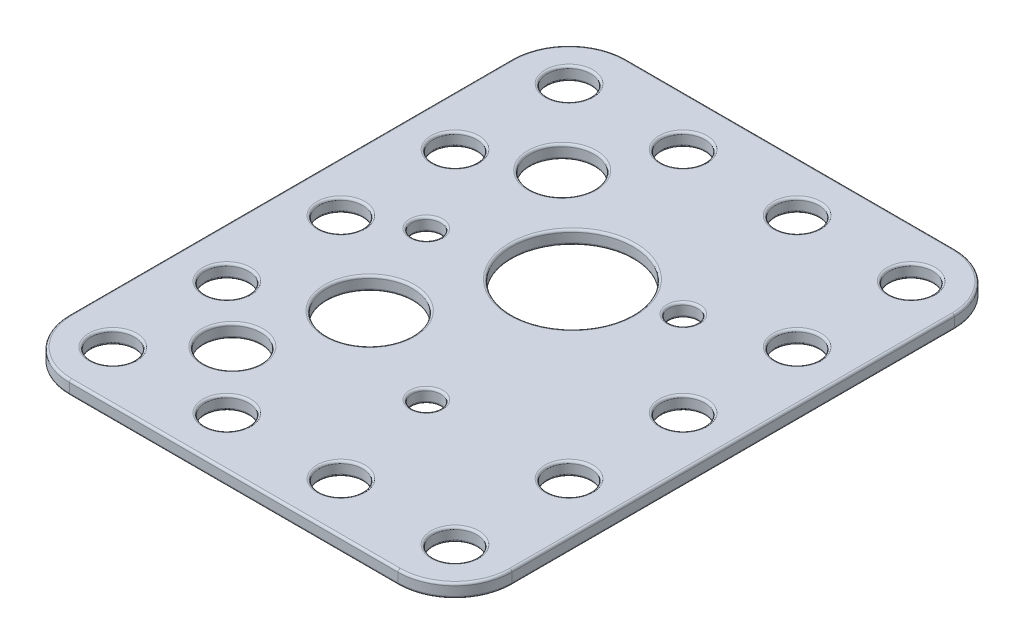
ISO-10303-21;
HEADER;
FILE_DESCRIPTION(('STEP AP214'),'2;1');
FILE_NAME('part.step','',(''),(''),'','','');
FILE_SCHEMA(('AUTOMOTIVE_DESIGN { 1 0 10303 214 1 1 1 1 }'));
ENDSEC;
DATA;
#1=APPLICATION_CONTEXT('core data for automotive mechanical design processes');
#2=APPLICATION_PROTOCOL_DEFINITION('international standard','automotive_design',2000,#1);
#3=PRODUCT_CONTEXT('',#1,'mechanical');
#4=PRODUCT('Part','Part','',(#3));
#5=PRODUCT_RELATED_PRODUCT_CATEGORY('part','',(#4));
#6=PRODUCT_DEFINITION_FORMATION('','',#4);
#7=PRODUCT_DEFINITION_CONTEXT('part definition',#1,'design');
#8=PRODUCT_DEFINITION('design','',#6,#7);
#9=PRODUCT_DEFINITION_SHAPE('','',#8);
#10=(LENGTH_UNIT() NAMED_UNIT(*) SI_UNIT(.MILLI.,.METRE.));
#11=(NAMED_UNIT(*) PLANE_ANGLE_UNIT() SI_UNIT($,.RADIAN.));
#12=(NAMED_UNIT(*) SI_UNIT($,.STERADIAN.) SOLID_ANGLE_UNIT());
#13=UNCERTAINTY_MEASURE_WITH_UNIT(LENGTH_MEASURE(1.E-05),#10,'distance_accuracy_value','');
#14=(GEOMETRIC_REPRESENTATION_CONTEXT(3) GLOBAL_UNCERTAINTY_ASSIGNED_CONTEXT((#13)) GLOBAL_UNIT_ASSIGNED_CONTEXT((#10,
#11,#12)) REPRESENTATION_CONTEXT('',''));
#15=CARTESIAN_POINT('',(0.,0.,0.));
#16=DIRECTION('',(0.,0.,1.));
#17=DIRECTION('',(1.,0.,0.));
#18=AXIS2_PLACEMENT_3D('',#15,#16,#17);
#19=CARTESIAN_POINT('',(6.35,1.524,-55.626));
#20=DIRECTION('',(0.,-1.,0.));
#21=DIRECTION('',(0.,0.,-1.));
#22=AXIS2_PLACEMENT_3D('',#19,#20,#21);
#23=PLANE('',#22);
#24=CARTESIAN_POINT('',(18.288,1.524,-5.588));
#25=DIRECTION('',(0.,-1.,0.));
#26=DIRECTION('',(0.,0.,-1.));
#27=AXIS2_PLACEMENT_3D('',#24,#25,#26);
#28=CIRCLE('',#27,2.667);
#29=CARTESIAN_POINT('',(18.288,1.524,-8.255));
#30=VERTEX_POINT('',#29);
#31=EDGE_CURVE('E11',#30,#30,#28,.T.);
#32=ORIENTED_EDGE('',*,*,#31,.T.);
#33=EDGE_LOOP('',(#32));
#34=FACE_BOUND('',#33,.T.);
#35=CARTESIAN_POINT('',(43.688,1.524,-43.688));
#36=DIRECTION('',(0.,-1.,0.));
#37=DIRECTION('',(0.,0.,-1.));
#38=AXIS2_PLACEMENT_3D('',#35,#36,#37);
#39=CIRCLE('',#38,2.667);
#40=CARTESIAN_POINT('',(43.688,1.524,-46.355));
#41=VERTEX_POINT('',#40);
#42=EDGE_CURVE('E34',#41,#41,#39,.T.);
#43=ORIENTED_EDGE('',*,*,#42,.T.);
#44=EDGE_LOOP('',(#43));
#45=FACE_BOUND('',#44,.T.);
#46=CARTESIAN_POINT('',(43.688,1.524,-30.988));
#47=DIRECTION('',(0.,-1.,0.));
#48=DIRECTION('',(0.,0.,-1.));
#49=AXIS2_PLACEMENT_3D('',#46,#47,#48);
#50=CIRCLE('',#49,2.667);
#51=CARTESIAN_POINT('',(43.688,1.524,-33.655));
#52=VERTEX_POINT('',#51);
#53=EDGE_CURVE('E413',#52,#52,#50,.T.);
#54=ORIENTED_EDGE('',*,*,#53,.T.);
#55=EDGE_LOOP('',(#54));
#56=FACE_BOUND('',#55,.T.);
#57=CARTESIAN_POINT('',(24.638,1.524,-37.719));
#58=DIRECTION('',(0.,-1.,0.));
#59=DIRECTION('',(0.,0.,-1.));
#60=AXIS2_PLACEMENT_3D('',#57,#58,#59);
#61=CIRCLE('',#60,7.0104);
#62=CARTESIAN_POINT('',(24.638,1.524,-44.7294));
#63=VERTEX_POINT('',#62);
#64=EDGE_CURVE('E410',#63,#63,#61,.T.);
#65=ORIENTED_EDGE('',*,*,#64,.T.);
#66=EDGE_LOOP('',(#65));
#67=FACE_BOUND('',#66,.T.);
#68=CARTESIAN_POINT('',(16.383,1.524,-23.3934));
#69=DIRECTION('',(0.,-1.,0.));
#70=DIRECTION('',(0.,0.,-1.));
#71=AXIS2_PLACEMENT_3D('',#68,#69,#70);
#72=CIRCLE('',#71,5.0165);
#73=CARTESIAN_POINT('',(16.383,1.524,-28.4099));
#74=VERTEX_POINT('',#73);
#75=EDGE_CURVE('E407',#74,#74,#72,.T.);
#76=ORIENTED_EDGE('',*,*,#75,.T.);
#77=EDGE_LOOP('',(#76));
#78=FACE_BOUND('',#77,.T.);
#79=CARTESIAN_POINT('',(42.926,1.524,-55.626));
#80=DIRECTION('',(0.,-1.,0.));
#81=DIRECTION('',(0.,0.,-1.));
#82=AXIS2_PLACEMENT_3D('',#79,#80,#81);
#83=CIRCLE('',#82,6.096);
#84=CARTESIAN_POINT('',(49.022,1.524,-55.626));
#85=VERTEX_POINT('',#84);
#86=CARTESIAN_POINT('',(42.926,1.524,-61.722));
#87=VERTEX_POINT('',#86);
#88=EDGE_CURVE('E41',#85,#87,#83,.F.);
#89=ORIENTED_EDGE('',*,*,#88,.T.);
#90=DIRECTION('',(-1.,0.,0.));
#91=VECTOR('',#90,1.);
#92=CARTESIAN_POINT('',(6.35,1.524,-61.722));
#93=LINE('',#92,#91);
#94=CARTESIAN_POINT('',(6.35000000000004,1.524,-61.722));
#95=VERTEX_POINT('',#94);
#96=EDGE_CURVE('E405',#87,#95,#93,.T.);
#97=ORIENTED_EDGE('',*,*,#96,.T.);
#98=CARTESIAN_POINT('',(6.35,1.524,-55.626));
#99=DIRECTION('',(0.,-1.,0.));
#100=DIRECTION('',(0.,0.,-1.));
#101=AXIS2_PLACEMENT_3D('',#98,#99,#100);
#102=CIRCLE('',#101,6.096);
#103=CARTESIAN_POINT('',(0.253999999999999,1.524,-55.626));
#104=VERTEX_POINT('',#103);
#105=EDGE_CURVE('E393',#95,#104,#102,.F.);
#106=ORIENTED_EDGE('',*,*,#105,.T.);
#107=DIRECTION('',(0.,0.,1.));
#108=VECTOR('',#107,1.);
#109=CARTESIAN_POINT('',(0.254,1.524,-55.626));
#110=LINE('',#109,#108);
#111=CARTESIAN_POINT('',(0.254,1.524,-6.35000000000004));
#112=VERTEX_POINT('',#111);
#113=EDGE_CURVE('E395',#104,#112,#110,.T.);
#114=ORIENTED_EDGE('',*,*,#113,.T.);
#115=CARTESIAN_POINT('',(6.35,1.524,-6.35));
#116=DIRECTION('',(0.,-1.,0.));
#117=DIRECTION('',(0.,0.,-1.));
#118=AXIS2_PLACEMENT_3D('',#115,#116,#117);
#119=CIRCLE('',#118,6.096);
#120=CARTESIAN_POINT('',(6.35000000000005,1.524,-0.254));
#121=VERTEX_POINT('',#120);
#122=EDGE_CURVE('E397',#112,#121,#119,.F.);
#123=ORIENTED_EDGE('',*,*,#122,.T.);
#124=DIRECTION('',(1.,0.,0.));
#125=VECTOR('',#124,1.);
#126=CARTESIAN_POINT('',(6.35,1.524,-0.253999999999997));
#127=LINE('',#126,#125);
#128=CARTESIAN_POINT('',(42.926,1.524,-0.253999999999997));
#129=VERTEX_POINT('',#128);
#130=EDGE_CURVE('E399',#121,#129,#127,.T.);
#131=ORIENTED_EDGE('',*,*,#130,.T.);
#132=CARTESIAN_POINT('',(42.926,1.524,-6.35));
#133=DIRECTION('',(0.,-1.,0.));
#134=DIRECTION('',(0.,0.,-1.));
#135=AXIS2_PLACEMENT_3D('',#132,#133,#134);
#136=CIRCLE('',#135,6.096);
#137=CARTESIAN_POINT('',(49.022,1.524,-6.35000000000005));
#138=VERTEX_POINT('',#137);
#139=EDGE_CURVE('E401',#129,#138,#136,.F.);
#140=ORIENTED_EDGE('',*,*,#139,.T.);
#141=DIRECTION('',(0.,0.,-1.));
#142=VECTOR('',#141,1.);
#143=CARTESIAN_POINT('',(49.022,1.524,-55.626));
#144=LINE('',#143,#142);
#145=EDGE_CURVE('E46',#138,#85,#144,.T.);
#146=ORIENTED_EDGE('',*,*,#145,.T.);
#147=EDGE_LOOP('',(#89,#97,#106,#114,#123,#131,#140,#146));
#148=FACE_BOUND('',#147,.T.);
#149=CARTESIAN_POINT('',(13.5636,1.524,-47.6504));
#150=DIRECTION('',(0.,-1.,0.));
#151=DIRECTION('',(0.,0.,-1.));
#152=AXIS2_PLACEMENT_3D('',#149,#150,#151);
#153=CIRCLE('',#152,3.8227);
#154=CARTESIAN_POINT('',(13.5636,1.524,-51.4731));
#155=VERTEX_POINT('',#154);
#156=EDGE_CURVE('E390',#155,#155,#153,.T.);
#157=ORIENTED_EDGE('',*,*,#156,.T.);
#158=EDGE_LOOP('',(#157));
#159=FACE_BOUND('',#158,.T.);
#160=CARTESIAN_POINT('',(12.192,1.524,-12.2936));
#161=DIRECTION('',(0.,-1.,0.));
#162=DIRECTION('',(0.,0.,-1.));
#163=AXIS2_PLACEMENT_3D('',#160,#161,#162);
#164=CIRCLE('',#163,3.429);
#165=CARTESIAN_POINT('',(12.192,1.524,-15.7226));
#166=VERTEX_POINT('',#165);
#167=EDGE_CURVE('E387',#166,#166,#164,.T.);
#168=ORIENTED_EDGE('',*,*,#167,.T.);
#169=EDGE_LOOP('',(#168));
#170=FACE_BOUND('',#169,.T.);
#171=CARTESIAN_POINT('',(5.588,1.524,-56.388));
#172=DIRECTION('',(0.,-1.,0.));
#173=DIRECTION('',(0.,0.,-1.));
#174=AXIS2_PLACEMENT_3D('',#171,#172,#173);
#175=CIRCLE('',#174,2.667);
#176=CARTESIAN_POINT('',(5.588,1.524,-59.055));
#177=VERTEX_POINT('',#176);
#178=EDGE_CURVE('E384',#177,#177,#175,.T.);
#179=ORIENTED_EDGE('',*,*,#178,.T.);
#180=EDGE_LOOP('',(#179));
#181=FACE_BOUND('',#180,.T.);
#182=CARTESIAN_POINT('',(18.288,1.524,-56.388));
#183=DIRECTION('',(0.,-1.,0.));
#184=DIRECTION('',(0.,0.,-1.));
#185=AXIS2_PLACEMENT_3D('',#182,#183,#184);
#186=CIRCLE('',#185,2.667);
#187=CARTESIAN_POINT('',(18.288,1.524,-59.055));
#188=VERTEX_POINT('',#187);
#189=EDGE_CURVE('E381',#188,#188,#186,.T.);
#190=ORIENTED_EDGE('',*,*,#189,.T.);
#191=EDGE_LOOP('',(#190));
#192=FACE_BOUND('',#191,.T.);
#193=CARTESIAN_POINT('',(30.988,1.524,-56.388));
#194=DIRECTION('',(0.,-1.,0.));
#195=DIRECTION('',(0.,0.,-1.));
#196=AXIS2_PLACEMENT_3D('',#193,#194,#195);
#197=CIRCLE('',#196,2.667);
#198=CARTESIAN_POINT('',(30.988,1.524,-59.055));
#199=VERTEX_POINT('',#198);
#200=EDGE_CURVE('E378',#199,#199,#197,.T.);
#201=ORIENTED_EDGE('',*,*,#200,.T.);
#202=EDGE_LOOP('',(#201));
#203=FACE_BOUND('',#202,.T.);
#204=CARTESIAN_POINT('',(43.688,1.524,-56.388));
#205=DIRECTION('',(0.,-1.,0.));
#206=DIRECTION('',(0.,0.,-1.));
#207=AXIS2_PLACEMENT_3D('',#204,#205,#206);
#208=CIRCLE('',#207,2.667);
#209=CARTESIAN_POINT('',(43.688,1.524,-59.055));
#210=VERTEX_POINT('',#209);
#211=EDGE_CURVE('E375',#210,#210,#208,.T.);
#212=ORIENTED_EDGE('',*,*,#211,.T.);
#213=EDGE_LOOP('',(#212));
#214=FACE_BOUND('',#213,.T.);
#215=CARTESIAN_POINT('',(5.588,1.524,-43.688));
#216=DIRECTION('',(0.,-1.,0.));
#217=DIRECTION('',(0.,0.,-1.));
#218=AXIS2_PLACEMENT_3D('',#215,#216,#217);
#219=CIRCLE('',#218,2.667);
#220=CARTESIAN_POINT('',(5.588,1.524,-46.355));
#221=VERTEX_POINT('',#220);
#222=EDGE_CURVE('E372',#221,#221,#219,.T.);
#223=ORIENTED_EDGE('',*,*,#222,.T.);
#224=EDGE_LOOP('',(#223));
#225=FACE_BOUND('',#224,.T.);
#226=CARTESIAN_POINT('',(5.588,1.524,-30.988));
#227=DIRECTION('',(0.,-1.,0.));
#228=DIRECTION('',(0.,0.,-1.));
#229=AXIS2_PLACEMENT_3D('',#226,#227,#228);
#230=CIRCLE('',#229,2.667);
#231=CARTESIAN_POINT('',(5.588,1.524,-33.655));
#232=VERTEX_POINT('',#231);
#233=EDGE_CURVE('E369',#232,#232,#230,.T.);
#234=ORIENTED_EDGE('',*,*,#233,.T.);
#235=EDGE_LOOP('',(#234));
#236=FACE_BOUND('',#235,.T.);
#237=CARTESIAN_POINT('',(5.588,1.524,-18.288));
#238=DIRECTION('',(0.,-1.,0.));
#239=DIRECTION('',(0.,0.,-1.));
#240=AXIS2_PLACEMENT_3D('',#237,#238,#239);
#241=CIRCLE('',#240,2.667);
#242=CARTESIAN_POINT('',(5.588,1.524,-20.955));
#243=VERTEX_POINT('',#242);
#244=EDGE_CURVE('E366',#243,#243,#241,.T.);
#245=ORIENTED_EDGE('',*,*,#244,.T.);
#246=EDGE_LOOP('',(#245));
#247=FACE_BOUND('',#246,.T.);
#248=CARTESIAN_POINT('',(5.588,1.524,-5.588));
#249=DIRECTION('',(0.,-1.,0.));
#250=DIRECTION('',(0.,0.,-1.));
#251=AXIS2_PLACEMENT_3D('',#248,#249,#250);
#252=CIRCLE('',#251,2.667);
#253=CARTESIAN_POINT('',(5.588,1.524,-8.25499999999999));
#254=VERTEX_POINT('',#253);
#255=EDGE_CURVE('E363',#254,#254,#252,.T.);
#256=ORIENTED_EDGE('',*,*,#255,.T.);
#257=EDGE_LOOP('',(#256));
#258=FACE_BOUND('',#257,.T.);
#259=CARTESIAN_POINT('',(43.688,1.524,-5.588));
#260=DIRECTION('',(0.,-1.,0.));
#261=DIRECTION('',(0.,0.,-1.));
#262=AXIS2_PLACEMENT_3D('',#259,#260,#261);
#263=CIRCLE('',#262,2.667);
#264=CARTESIAN_POINT('',(43.688,1.524,-8.255));
#265=VERTEX_POINT('',#264);
#266=EDGE_CURVE('E360',#265,#265,#263,.T.);
#267=ORIENTED_EDGE('',*,*,#266,.T.);
#268=EDGE_LOOP('',(#267));
#269=FACE_BOUND('',#268,.T.);
#270=CARTESIAN_POINT('',(43.688,1.524,-18.288));
#271=DIRECTION('',(0.,-1.,0.));
#272=DIRECTION('',(0.,0.,-1.));
#273=AXIS2_PLACEMENT_3D('',#270,#271,#272);
#274=CIRCLE('',#273,2.667);
#275=CARTESIAN_POINT('',(43.688,1.524,-20.955));
#276=VERTEX_POINT('',#275);
#277=EDGE_CURVE('E357',#276,#276,#274,.T.);
#278=ORIENTED_EDGE('',*,*,#277,.T.);
#279=EDGE_LOOP('',(#278));
#280=FACE_BOUND('',#279,.T.);
#281=CARTESIAN_POINT('',(30.988,1.524,-5.588));
#282=DIRECTION('',(0.,-1.,0.));
#283=DIRECTION('',(0.,0.,-1.));
#284=AXIS2_PLACEMENT_3D('',#281,#282,#283);
#285=CIRCLE('',#284,2.667);
#286=CARTESIAN_POINT('',(30.988,1.524,-8.255));
#287=VERTEX_POINT('',#286);
#288=EDGE_CURVE('E354',#287,#287,#285,.T.);
#289=ORIENTED_EDGE('',*,*,#288,.T.);
#290=EDGE_LOOP('',(#289));
#291=FACE_BOUND('',#290,.T.);
#292=CARTESIAN_POINT('',(28.1287959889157,1.524,-17.9601720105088));
#293=DIRECTION('',(0.,-1.,0.));
#294=DIRECTION('',(0.,0.,-1.));
#295=AXIS2_PLACEMENT_3D('',#292,#293,#294);
#296=CIRCLE('',#295,1.8415);
#297=CARTESIAN_POINT('',(28.1287959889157,1.524,-19.8016720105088));
#298=VERTEX_POINT('',#297);
#299=EDGE_CURVE('E351',#298,#298,#296,.T.);
#300=ORIENTED_EDGE('',*,*,#299,.T.);
#301=EDGE_LOOP('',(#300));
#302=FACE_BOUND('',#301,.T.);
#303=CARTESIAN_POINT('',(34.1750320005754,1.524,-40.5250320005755));
#304=DIRECTION('',(0.,-1.,0.));
#305=DIRECTION('',(0.,0.,-1.));
#306=AXIS2_PLACEMENT_3D('',#303,#304,#305);
#307=CIRCLE('',#306,1.84150000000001);
#308=CARTESIAN_POINT('',(34.1750320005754,1.524,-42.3665320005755));
#309=VERTEX_POINT('',#308);
#310=EDGE_CURVE('E348',#309,#309,#307,.T.);
#311=ORIENTED_EDGE('',*,*,#310,.T.);
#312=EDGE_LOOP('',(#311));
#313=FACE_BOUND('',#312,.T.);
#314=CARTESIAN_POINT('',(11.6101720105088,1.524,-34.4787959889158));
#315=DIRECTION('',(0.,-1.,0.));
#316=DIRECTION('',(0.,0.,-1.));
#317=AXIS2_PLACEMENT_3D('',#314,#315,#316);
#318=CIRCLE('',#317,1.8415);
#319=CARTESIAN_POINT('',(11.6101720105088,1.524,-36.3202959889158));
#320=VERTEX_POINT('',#319);
#321=EDGE_CURVE('E345',#320,#320,#318,.T.);
#322=ORIENTED_EDGE('',*,*,#321,.T.);
#323=EDGE_LOOP('',(#322));
#324=FACE_BOUND('',#323,.T.);
#325=ADVANCED_FACE('F26',(#34,#45,#56,#67,#78,#148,#159,#170,#181,#192,#203,#214,#225,#236,#247,
#258,#269,#280,#291,#302,#313,#324),#23,.F.);
#326=CARTESIAN_POINT('',(6.35,0.,-55.626));
#327=DIRECTION('',(0.,-1.,0.));
#328=DIRECTION('',(0.,0.,-1.));
#329=AXIS2_PLACEMENT_3D('',#326,#327,#328);
#330=PLANE('',#329);
#331=CARTESIAN_POINT('',(18.288,0.,-5.588));
#332=DIRECTION('',(0.,-1.,0.));
#333=DIRECTION('',(0.,0.,-1.));
#334=AXIS2_PLACEMENT_3D('',#331,#332,#333);
#335=CIRCLE('',#334,2.667);
#336=CARTESIAN_POINT('',(18.288,0.,-8.255));
#337=VERTEX_POINT('',#336);
#338=EDGE_CURVE('E184',#337,#337,#335,.F.);
#339=ORIENTED_EDGE('',*,*,#338,.T.);
#340=EDGE_LOOP('',(#339));
#341=FACE_BOUND('',#340,.T.);
#342=CARTESIAN_POINT('',(43.688,0.,-43.688));
#343=DIRECTION('',(0.,-1.,0.));
#344=DIRECTION('',(0.,0.,-1.));
#345=AXIS2_PLACEMENT_3D('',#342,#343,#344);
#346=CIRCLE('',#345,2.667);
#347=CARTESIAN_POINT('',(43.688,0.,-46.355));
#348=VERTEX_POINT('',#347);
#349=EDGE_CURVE('E181',#348,#348,#346,.F.);
#350=ORIENTED_EDGE('',*,*,#349,.T.);
#351=EDGE_LOOP('',(#350));
#352=FACE_BOUND('',#351,.T.);
#353=CARTESIAN_POINT('',(43.688,0.,-30.988));
#354=DIRECTION('',(0.,-1.,0.));
#355=DIRECTION('',(0.,0.,-1.));
#356=AXIS2_PLACEMENT_3D('',#353,#354,#355);
#357=CIRCLE('',#356,2.667);
#358=CARTESIAN_POINT('',(43.688,0.,-33.655));
#359=VERTEX_POINT('',#358);
#360=EDGE_CURVE('E178',#359,#359,#357,.F.);
#361=ORIENTED_EDGE('',*,*,#360,.T.);
#362=EDGE_LOOP('',(#361));
#363=FACE_BOUND('',#362,.T.);
#364=CARTESIAN_POINT('',(24.638,0.,-37.719));
#365=DIRECTION('',(0.,-1.,0.));
#366=DIRECTION('',(0.,0.,-1.));
#367=AXIS2_PLACEMENT_3D('',#364,#365,#366);
#368=CIRCLE('',#367,7.0104);
#369=CARTESIAN_POINT('',(24.638,0.,-44.7294));
#370=VERTEX_POINT('',#369);
#371=EDGE_CURVE('E170',#370,#370,#368,.F.);
#372=ORIENTED_EDGE('',*,*,#371,.T.);
#373=EDGE_LOOP('',(#372));
#374=FACE_BOUND('',#373,.T.);
#375=CARTESIAN_POINT('',(16.383,0.,-23.3934));
#376=DIRECTION('',(0.,-1.,0.));
#377=DIRECTION('',(0.,0.,-1.));
#378=AXIS2_PLACEMENT_3D('',#375,#376,#377);
#379=CIRCLE('',#378,5.0165);
#380=CARTESIAN_POINT('',(16.383,0.,-28.4099));
#381=VERTEX_POINT('',#380);
#382=EDGE_CURVE('E167',#381,#381,#379,.F.);
#383=ORIENTED_EDGE('',*,*,#382,.T.);
#384=EDGE_LOOP('',(#383));
#385=FACE_BOUND('',#384,.T.);
#386=CARTESIAN_POINT('',(6.35,0.,-6.35));
#387=DIRECTION('',(0.,-1.,0.));
#388=DIRECTION('',(0.,0.,-1.));
#389=AXIS2_PLACEMENT_3D('',#386,#387,#388);
#390=CIRCLE('',#389,6.096);
#391=CARTESIAN_POINT('',(6.35000000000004,0.,-0.254));
#392=VERTEX_POINT('',#391);
#393=CARTESIAN_POINT('',(0.254,0.,-6.35000000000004));
#394=VERTEX_POINT('',#393);
#395=EDGE_CURVE('E166',#392,#394,#390,.T.);
#396=ORIENTED_EDGE('',*,*,#395,.T.);
#397=DIRECTION('',(0.,0.,1.));
#398=VECTOR('',#397,1.);
#399=CARTESIAN_POINT('',(0.254,0.,-55.626));
#400=LINE('',#399,#398);
#401=CARTESIAN_POINT('',(0.253999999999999,0.,-55.626));
#402=VERTEX_POINT('',#401);
#403=EDGE_CURVE('E144',#394,#402,#400,.F.);
#404=ORIENTED_EDGE('',*,*,#403,.T.);
#405=CARTESIAN_POINT('',(6.35,0.,-55.626));
#406=DIRECTION('',(0.,-1.,0.));
#407=DIRECTION('',(0.,0.,-1.));
#408=AXIS2_PLACEMENT_3D('',#405,#406,#407);
#409=CIRCLE('',#408,6.096);
#410=CARTESIAN_POINT('',(6.35000000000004,0.,-61.722));
#411=VERTEX_POINT('',#410);
#412=EDGE_CURVE('E154',#402,#411,#409,.T.);
#413=ORIENTED_EDGE('',*,*,#412,.T.);
#414=DIRECTION('',(-1.,0.,0.));
#415=VECTOR('',#414,1.);
#416=CARTESIAN_POINT('',(42.926,0.,-61.722));
#417=LINE('',#416,#415);
#418=CARTESIAN_POINT('',(42.926,0.,-61.722));
#419=VERTEX_POINT('',#418);
#420=EDGE_CURVE('E160',#411,#419,#417,.F.);
#421=ORIENTED_EDGE('',*,*,#420,.T.);
#422=CARTESIAN_POINT('',(42.926,0.,-55.626));
#423=DIRECTION('',(0.,-1.,0.));
#424=DIRECTION('',(0.,0.,-1.));
#425=AXIS2_PLACEMENT_3D('',#422,#423,#424);
#426=CIRCLE('',#425,6.096);
#427=CARTESIAN_POINT('',(49.022,0.,-55.626));
#428=VERTEX_POINT('',#427);
#429=EDGE_CURVE('E581',#419,#428,#426,.T.);
#430=ORIENTED_EDGE('',*,*,#429,.T.);
#431=DIRECTION('',(0.,0.,-1.));
#432=VECTOR('',#431,1.);
#433=CARTESIAN_POINT('',(49.022,0.,-6.35000000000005));
#434=LINE('',#433,#432);
#435=CARTESIAN_POINT('',(49.022,0.,-6.35000000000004));
#436=VERTEX_POINT('',#435);
#437=EDGE_CURVE('E583',#428,#436,#434,.F.);
#438=ORIENTED_EDGE('',*,*,#437,.T.);
#439=CARTESIAN_POINT('',(42.926,0.,-6.35));
#440=DIRECTION('',(0.,-1.,0.));
#441=DIRECTION('',(0.,0.,-1.));
#442=AXIS2_PLACEMENT_3D('',#439,#440,#441);
#443=CIRCLE('',#442,6.096);
#444=CARTESIAN_POINT('',(42.926,0.,-0.253999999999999));
#445=VERTEX_POINT('',#444);
#446=EDGE_CURVE('E585',#436,#445,#443,.T.);
#447=ORIENTED_EDGE('',*,*,#446,.T.);
#448=DIRECTION('',(1.,0.,0.));
#449=VECTOR('',#448,1.);
#450=CARTESIAN_POINT('',(6.35000000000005,0.,-0.254));
#451=LINE('',#450,#449);
#452=EDGE_CURVE('E172',#445,#392,#451,.F.);
#453=ORIENTED_EDGE('',*,*,#452,.T.);
#454=EDGE_LOOP('',(#396,#404,#413,#421,#430,#438,#447,#453));
#455=FACE_BOUND('',#454,.T.);
#456=CARTESIAN_POINT('',(13.5636,0.,-47.6504));
#457=DIRECTION('',(0.,-1.,0.));
#458=DIRECTION('',(0.,0.,-1.));
#459=AXIS2_PLACEMENT_3D('',#456,#457,#458);
#460=CIRCLE('',#459,3.8227);
#461=CARTESIAN_POINT('',(13.5636,0.,-51.4731));
#462=VERTEX_POINT('',#461);
#463=EDGE_CURVE('E161',#462,#462,#460,.F.);
#464=ORIENTED_EDGE('',*,*,#463,.T.);
#465=EDGE_LOOP('',(#464));
#466=FACE_BOUND('',#465,.T.);
#467=CARTESIAN_POINT('',(12.192,0.,-12.2936));
#468=DIRECTION('',(0.,-1.,0.));
#469=DIRECTION('',(0.,0.,-1.));
#470=AXIS2_PLACEMENT_3D('',#467,#468,#469);
#471=CIRCLE('',#470,3.429);
#472=CARTESIAN_POINT('',(12.192,0.,-15.7226));
#473=VERTEX_POINT('',#472);
#474=EDGE_CURVE('E575',#473,#473,#471,.F.);
#475=ORIENTED_EDGE('',*,*,#474,.T.);
#476=EDGE_LOOP('',(#475));
#477=FACE_BOUND('',#476,.T.);
#478=CARTESIAN_POINT('',(5.588,0.,-56.388));
#479=DIRECTION('',(0.,-1.,0.));
#480=DIRECTION('',(0.,0.,-1.));
#481=AXIS2_PLACEMENT_3D('',#478,#479,#480);
#482=CIRCLE('',#481,2.667);
#483=CARTESIAN_POINT('',(5.588,0.,-59.055));
#484=VERTEX_POINT('',#483);
#485=EDGE_CURVE('E572',#484,#484,#482,.F.);
#486=ORIENTED_EDGE('',*,*,#485,.T.);
#487=EDGE_LOOP('',(#486));
#488=FACE_BOUND('',#487,.T.);
#489=CARTESIAN_POINT('',(18.288,0.,-56.388));
#490=DIRECTION('',(0.,-1.,0.));
#491=DIRECTION('',(0.,0.,-1.));
#492=AXIS2_PLACEMENT_3D('',#489,#490,#491);
#493=CIRCLE('',#492,2.667);
#494=CARTESIAN_POINT('',(18.288,0.,-59.055));
#495=VERTEX_POINT('',#494);
#496=EDGE_CURVE('E569',#495,#495,#493,.F.);
#497=ORIENTED_EDGE('',*,*,#496,.T.);
#498=EDGE_LOOP('',(#497));
#499=FACE_BOUND('',#498,.T.);
#500=CARTESIAN_POINT('',(30.988,0.,-56.388));
#501=DIRECTION('',(0.,-1.,0.));
#502=DIRECTION('',(0.,0.,-1.));
#503=AXIS2_PLACEMENT_3D('',#500,#501,#502);
#504=CIRCLE('',#503,2.667);
#505=CARTESIAN_POINT('',(30.988,0.,-59.055));
#506=VERTEX_POINT('',#505);
#507=EDGE_CURVE('E566',#506,#506,#504,.F.);
#508=ORIENTED_EDGE('',*,*,#507,.T.);
#509=EDGE_LOOP('',(#508));
#510=FACE_BOUND('',#509,.T.);
#511=CARTESIAN_POINT('',(43.688,0.,-56.388));
#512=DIRECTION('',(0.,-1.,0.));
#513=DIRECTION('',(0.,0.,-1.));
#514=AXIS2_PLACEMENT_3D('',#511,#512,#513);
#515=CIRCLE('',#514,2.667);
#516=CARTESIAN_POINT('',(43.688,0.,-59.055));
#517=VERTEX_POINT('',#516);
#518=EDGE_CURVE('E563',#517,#517,#515,.F.);
#519=ORIENTED_EDGE('',*,*,#518,.T.);
#520=EDGE_LOOP('',(#519));
#521=FACE_BOUND('',#520,.T.);
#522=CARTESIAN_POINT('',(5.588,0.,-43.688));
#523=DIRECTION('',(0.,-1.,0.));
#524=DIRECTION('',(0.,0.,-1.));
#525=AXIS2_PLACEMENT_3D('',#522,#523,#524);
#526=CIRCLE('',#525,2.667);
#527=CARTESIAN_POINT('',(5.588,0.,-46.355));
#528=VERTEX_POINT('',#527);
#529=EDGE_CURVE('E560',#528,#528,#526,.F.);
#530=ORIENTED_EDGE('',*,*,#529,.T.);
#531=EDGE_LOOP('',(#530));
#532=FACE_BOUND('',#531,.T.);
#533=CARTESIAN_POINT('',(5.588,0.,-30.988));
#534=DIRECTION('',(0.,-1.,0.));
#535=DIRECTION('',(0.,0.,-1.));
#536=AXIS2_PLACEMENT_3D('',#533,#534,#535);
#537=CIRCLE('',#536,2.667);
#538=CARTESIAN_POINT('',(5.588,0.,-33.655));
#539=VERTEX_POINT('',#538);
#540=EDGE_CURVE('E557',#539,#539,#537,.F.);
#541=ORIENTED_EDGE('',*,*,#540,.T.);
#542=EDGE_LOOP('',(#541));
#543=FACE_BOUND('',#542,.T.);
#544=CARTESIAN_POINT('',(5.588,0.,-18.288));
#545=DIRECTION('',(0.,-1.,0.));
#546=DIRECTION('',(0.,0.,-1.));
#547=AXIS2_PLACEMENT_3D('',#544,#545,#546);
#548=CIRCLE('',#547,2.667);
#549=CARTESIAN_POINT('',(5.588,0.,-20.955));
#550=VERTEX_POINT('',#549);
#551=EDGE_CURVE('E554',#550,#550,#548,.F.);
#552=ORIENTED_EDGE('',*,*,#551,.T.);
#553=EDGE_LOOP('',(#552));
#554=FACE_BOUND('',#553,.T.);
#555=CARTESIAN_POINT('',(5.588,0.,-5.588));
#556=DIRECTION('',(0.,-1.,0.));
#557=DIRECTION('',(0.,0.,-1.));
#558=AXIS2_PLACEMENT_3D('',#555,#556,#557);
#559=CIRCLE('',#558,2.667);
#560=CARTESIAN_POINT('',(5.588,0.,-8.25499999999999));
#561=VERTEX_POINT('',#560);
#562=EDGE_CURVE('E551',#561,#561,#559,.F.);
#563=ORIENTED_EDGE('',*,*,#562,.T.);
#564=EDGE_LOOP('',(#563));
#565=FACE_BOUND('',#564,.T.);
#566=CARTESIAN_POINT('',(43.688,0.,-5.588));
#567=DIRECTION('',(0.,-1.,0.));
#568=DIRECTION('',(0.,0.,-1.));
#569=AXIS2_PLACEMENT_3D('',#566,#567,#568);
#570=CIRCLE('',#569,2.667);
#571=CARTESIAN_POINT('',(43.688,0.,-8.255));
#572=VERTEX_POINT('',#571);
#573=EDGE_CURVE('E548',#572,#572,#570,.F.);
#574=ORIENTED_EDGE('',*,*,#573,.T.);
#575=EDGE_LOOP('',(#574));
#576=FACE_BOUND('',#575,.T.);
#577=CARTESIAN_POINT('',(43.688,0.,-18.288));
#578=DIRECTION('',(0.,-1.,0.));
#579=DIRECTION('',(0.,0.,-1.));
#580=AXIS2_PLACEMENT_3D('',#577,#578,#579);
#581=CIRCLE('',#580,2.667);
#582=CARTESIAN_POINT('',(43.688,0.,-20.955));
#583=VERTEX_POINT('',#582);
#584=EDGE_CURVE('E545',#583,#583,#581,.F.);
#585=ORIENTED_EDGE('',*,*,#584,.T.);
#586=EDGE_LOOP('',(#585));
#587=FACE_BOUND('',#586,.T.);
#588=CARTESIAN_POINT('',(30.988,0.,-5.588));
#589=DIRECTION('',(0.,-1.,0.));
#590=DIRECTION('',(0.,0.,-1.));
#591=AXIS2_PLACEMENT_3D('',#588,#589,#590);
#592=CIRCLE('',#591,2.667);
#593=CARTESIAN_POINT('',(30.988,0.,-8.255));
#594=VERTEX_POINT('',#593);
#595=EDGE_CURVE('E542',#594,#594,#592,.F.);
#596=ORIENTED_EDGE('',*,*,#595,.T.);
#597=EDGE_LOOP('',(#596));
#598=FACE_BOUND('',#597,.T.);
#599=CARTESIAN_POINT('',(28.1287959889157,0.,-17.9601720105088));
#600=DIRECTION('',(0.,-1.,0.));
#601=DIRECTION('',(0.,0.,-1.));
#602=AXIS2_PLACEMENT_3D('',#599,#600,#601);
#603=CIRCLE('',#602,1.8415);
#604=CARTESIAN_POINT('',(28.1287959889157,0.,-19.8016720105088));
#605=VERTEX_POINT('',#604);
#606=EDGE_CURVE('E539',#605,#605,#603,.F.);
#607=ORIENTED_EDGE('',*,*,#606,.T.);
#608=EDGE_LOOP('',(#607));
#609=FACE_BOUND('',#608,.T.);
#610=CARTESIAN_POINT('',(34.1750320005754,0.,-40.5250320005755));
#611=DIRECTION('',(0.,-1.,0.));
#612=DIRECTION('',(0.,0.,-1.));
#613=AXIS2_PLACEMENT_3D('',#610,#611,#612);
#614=CIRCLE('',#613,1.84150000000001);
#615=CARTESIAN_POINT('',(34.1750320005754,0.,-42.3665320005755));
#616=VERTEX_POINT('',#615);
#617=EDGE_CURVE('E536',#616,#616,#614,.F.);
#618=ORIENTED_EDGE('',*,*,#617,.T.);
#619=EDGE_LOOP('',(#618));
#620=FACE_BOUND('',#619,.T.);
#621=CARTESIAN_POINT('',(11.6101720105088,0.,-34.4787959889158));
#622=DIRECTION('',(0.,-1.,0.));
#623=DIRECTION('',(0.,0.,-1.));
#624=AXIS2_PLACEMENT_3D('',#621,#622,#623);
#625=CIRCLE('',#624,1.8415);
#626=CARTESIAN_POINT('',(11.6101720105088,0.,-36.3202959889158));
#627=VERTEX_POINT('',#626);
#628=EDGE_CURVE('E533',#627,#627,#625,.F.);
#629=ORIENTED_EDGE('',*,*,#628,.T.);
#630=EDGE_LOOP('',(#629));
#631=FACE_BOUND('',#630,.T.);
#632=ADVANCED_FACE('F163',(#341,#352,#363,#374,#385,#455,#466,#477,#488,#499,#510,#521,#532,
#543,#554,#565,#576,#587,#598,#609,#620,#631),#330,.T.);
#633=CARTESIAN_POINT('',(6.35,1.524,-55.626));
#634=DIRECTION('',(0.,-1.,0.));
#635=DIRECTION('',(0.,0.,-1.));
#636=AXIS2_PLACEMENT_3D('',#633,#634,#635);
#637=CYLINDRICAL_SURFACE('',#636,6.35);
#638=DIRECTION('',(0.,-1.,0.));
#639=VECTOR('',#638,1.);
#640=CARTESIAN_POINT('',(6.35000000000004,1.524,-61.976));
#641=LINE('',#640,#639);
#642=CARTESIAN_POINT('',(6.35000000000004,1.27,-61.976));
#643=VERTEX_POINT('',#642);
#644=CARTESIAN_POINT('',(6.35000000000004,0.254000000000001,-61.976));
#645=VERTEX_POINT('',#644);
#646=EDGE_CURVE('E488',#643,#645,#641,.T.);
#647=ORIENTED_EDGE('',*,*,#646,.T.);
#648=CARTESIAN_POINT('',(6.35,0.254,-55.626));
#649=DIRECTION('',(0.,-1.,0.));
#650=DIRECTION('',(0.,0.,-1.));
#651=AXIS2_PLACEMENT_3D('',#648,#649,#650);
#652=CIRCLE('',#651,6.35);
#653=CARTESIAN_POINT('',(0.,0.254000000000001,-55.626));
#654=VERTEX_POINT('',#653);
#655=EDGE_CURVE('E247',#645,#654,#652,.F.);
#656=ORIENTED_EDGE('',*,*,#655,.T.);
#657=DIRECTION('',(0.,-1.,0.));
#658=VECTOR('',#657,1.);
#659=CARTESIAN_POINT('',(0.,1.524,-55.626));
#660=LINE('',#659,#658);
#661=CARTESIAN_POINT('',(0.,1.27,-55.626));
#662=VERTEX_POINT('',#661);
#663=EDGE_CURVE('E531',#662,#654,#660,.T.);
#664=ORIENTED_EDGE('',*,*,#663,.F.);
#665=CARTESIAN_POINT('',(6.35,1.27,-55.626));
#666=DIRECTION('',(0.,-1.,0.));
#667=DIRECTION('',(0.,0.,-1.));
#668=AXIS2_PLACEMENT_3D('',#665,#666,#667);
#669=CIRCLE('',#668,6.35);
#670=EDGE_CURVE('E245',#662,#643,#669,.T.);
#671=ORIENTED_EDGE('',*,*,#670,.T.);
#672=EDGE_LOOP('',(#647,#656,#664,#671));
#673=FACE_BOUND('',#672,.T.);
#674=ADVANCED_FACE('F448',(#673),#637,.T.);
#675=CARTESIAN_POINT('',(0.,1.524,-6.35000000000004));
#676=DIRECTION('',(1.,0.,0.));
#677=DIRECTION('',(0.,0.,-1.));
#678=AXIS2_PLACEMENT_3D('',#675,#676,#677);
#679=PLANE('',#678);
#680=ORIENTED_EDGE('',*,*,#663,.T.);
#681=DIRECTION('',(0.,0.,1.));
#682=VECTOR('',#681,1.);
#683=CARTESIAN_POINT('',(0.,0.254,-6.35000000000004));
#684=LINE('',#683,#682);
#685=CARTESIAN_POINT('',(0.,0.254000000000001,-6.35000000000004));
#686=VERTEX_POINT('',#685);
#687=EDGE_CURVE('E147',#654,#686,#684,.T.);
#688=ORIENTED_EDGE('',*,*,#687,.T.);
#689=DIRECTION('',(0.,-1.,0.));
#690=VECTOR('',#689,1.);
#691=CARTESIAN_POINT('',(0.,1.524,-6.35000000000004));
#692=LINE('',#691,#690);
#693=CARTESIAN_POINT('',(0.,1.27,-6.35000000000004));
#694=VERTEX_POINT('',#693);
#695=EDGE_CURVE('E528',#694,#686,#692,.T.);
#696=ORIENTED_EDGE('',*,*,#695,.F.);
#697=DIRECTION('',(0.,0.,1.));
#698=VECTOR('',#697,1.);
#699=CARTESIAN_POINT('',(0.,1.27,-6.35000000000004));
#700=LINE('',#699,#698);
#701=EDGE_CURVE('E217',#694,#662,#700,.F.);
#702=ORIENTED_EDGE('',*,*,#701,.T.);
#703=EDGE_LOOP('',(#680,#688,#696,#702));
#704=FACE_BOUND('',#703,.T.);
#705=ADVANCED_FACE('F477',(#704),#679,.F.);
#706=CARTESIAN_POINT('',(6.35,1.524,-6.35));
#707=DIRECTION('',(0.,-1.,0.));
#708=DIRECTION('',(0.,0.,-1.));
#709=AXIS2_PLACEMENT_3D('',#706,#707,#708);
#710=CYLINDRICAL_SURFACE('',#709,6.35);
#711=ORIENTED_EDGE('',*,*,#695,.T.);
#712=CARTESIAN_POINT('',(6.35,0.254,-6.35));
#713=DIRECTION('',(0.,-1.,0.));
#714=DIRECTION('',(0.,0.,-1.));
#715=AXIS2_PLACEMENT_3D('',#712,#713,#714);
#716=CIRCLE('',#715,6.35);
#717=CARTESIAN_POINT('',(6.35000000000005,0.254000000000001,0.));
#718=VERTEX_POINT('',#717);
#719=EDGE_CURVE('E222',#686,#718,#716,.F.);
#720=ORIENTED_EDGE('',*,*,#719,.T.);
#721=DIRECTION('',(0.,-1.,0.));
#722=VECTOR('',#721,1.);
#723=CARTESIAN_POINT('',(6.35000000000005,1.524,0.));
#724=LINE('',#723,#722);
#725=CARTESIAN_POINT('',(6.35000000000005,1.27,0.));
#726=VERTEX_POINT('',#725);
#727=EDGE_CURVE('E525',#726,#718,#724,.T.);
#728=ORIENTED_EDGE('',*,*,#727,.F.);
#729=CARTESIAN_POINT('',(6.35,1.27,-6.35));
#730=DIRECTION('',(0.,-1.,0.));
#731=DIRECTION('',(0.,0.,-1.));
#732=AXIS2_PLACEMENT_3D('',#729,#730,#731);
#733=CIRCLE('',#732,6.35);
#734=EDGE_CURVE('E220',#726,#694,#733,.T.);
#735=ORIENTED_EDGE('',*,*,#734,.T.);
#736=EDGE_LOOP('',(#711,#720,#728,#735));
#737=FACE_BOUND('',#736,.T.);
#738=ADVANCED_FACE('F473',(#737),#710,.T.);
#739=CARTESIAN_POINT('',(6.35000000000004,1.524,0.));
#740=DIRECTION('',(0.,0.,-1.));
#741=DIRECTION('',(-1.,0.,0.));
#742=AXIS2_PLACEMENT_3D('',#739,#740,#741);
#743=PLANE('',#742);
#744=ORIENTED_EDGE('',*,*,#727,.T.);
#745=DIRECTION('',(1.,0.,0.));
#746=VECTOR('',#745,1.);
#747=CARTESIAN_POINT('',(42.926,0.254,0.));
#748=LINE('',#747,#746);
#749=CARTESIAN_POINT('',(42.926,0.254000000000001,0.));
#750=VERTEX_POINT('',#749);
#751=EDGE_CURVE('E226',#718,#750,#748,.T.);
#752=ORIENTED_EDGE('',*,*,#751,.T.);
#753=DIRECTION('',(0.,-1.,0.));
#754=VECTOR('',#753,1.);
#755=CARTESIAN_POINT('',(42.926,1.524,0.));
#756=LINE('',#755,#754);
#757=CARTESIAN_POINT('',(42.926,1.27,0.));
#758=VERTEX_POINT('',#757);
#759=EDGE_CURVE('E522',#758,#750,#756,.T.);
#760=ORIENTED_EDGE('',*,*,#759,.F.);
#761=DIRECTION('',(1.,0.,0.));
#762=VECTOR('',#761,1.);
#763=CARTESIAN_POINT('',(6.35000000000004,1.27,0.));
#764=LINE('',#763,#762);
#765=EDGE_CURVE('E224',#758,#726,#764,.F.);
#766=ORIENTED_EDGE('',*,*,#765,.T.);
#767=EDGE_LOOP('',(#744,#752,#760,#766));
#768=FACE_BOUND('',#767,.T.);
#769=ADVANCED_FACE('F469',(#768),#743,.F.);
#770=CARTESIAN_POINT('',(42.926,1.524,-6.35));
#771=DIRECTION('',(0.,-1.,0.));
#772=DIRECTION('',(0.,0.,-1.));
#773=AXIS2_PLACEMENT_3D('',#770,#771,#772);
#774=CYLINDRICAL_SURFACE('',#773,6.35);
#775=ORIENTED_EDGE('',*,*,#759,.T.);
#776=CARTESIAN_POINT('',(42.926,0.254,-6.35));
#777=DIRECTION('',(0.,-1.,0.));
#778=DIRECTION('',(0.,0.,-1.));
#779=AXIS2_PLACEMENT_3D('',#776,#777,#778);
#780=CIRCLE('',#779,6.35);
#781=CARTESIAN_POINT('',(49.276,0.254000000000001,-6.35000000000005));
#782=VERTEX_POINT('',#781);
#783=EDGE_CURVE('E230',#750,#782,#780,.F.);
#784=ORIENTED_EDGE('',*,*,#783,.T.);
#785=DIRECTION('',(0.,-1.,0.));
#786=VECTOR('',#785,1.);
#787=CARTESIAN_POINT('',(49.276,1.524,-6.35000000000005));
#788=LINE('',#787,#786);
#789=CARTESIAN_POINT('',(49.276,1.27,-6.35000000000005));
#790=VERTEX_POINT('',#789);
#791=EDGE_CURVE('E519',#790,#782,#788,.T.);
#792=ORIENTED_EDGE('',*,*,#791,.F.);
#793=CARTESIAN_POINT('',(42.926,1.27,-6.35));
#794=DIRECTION('',(0.,-1.,0.));
#795=DIRECTION('',(0.,0.,-1.));
#796=AXIS2_PLACEMENT_3D('',#793,#794,#795);
#797=CIRCLE('',#796,6.35);
#798=EDGE_CURVE('E228',#790,#758,#797,.T.);
#799=ORIENTED_EDGE('',*,*,#798,.T.);
#800=EDGE_LOOP('',(#775,#784,#792,#799));
#801=FACE_BOUND('',#800,.T.);
#802=ADVANCED_FACE('F465',(#801),#774,.T.);
#803=CARTESIAN_POINT('',(49.276,1.524,-6.35000000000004));
#804=DIRECTION('',(-1.,0.,0.));
#805=DIRECTION('',(0.,0.,1.));
#806=AXIS2_PLACEMENT_3D('',#803,#804,#805);
#807=PLANE('',#806);
#808=ORIENTED_EDGE('',*,*,#791,.T.);
#809=DIRECTION('',(0.,0.,-1.));
#810=VECTOR('',#809,1.);
#811=CARTESIAN_POINT('',(49.276,0.254,-55.626));
#812=LINE('',#811,#810);
#813=CARTESIAN_POINT('',(49.276,0.254000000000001,-55.626));
#814=VERTEX_POINT('',#813);
#815=EDGE_CURVE('E234',#782,#814,#812,.T.);
#816=ORIENTED_EDGE('',*,*,#815,.T.);
#817=DIRECTION('',(0.,-1.,0.));
#818=VECTOR('',#817,1.);
#819=CARTESIAN_POINT('',(49.276,1.524,-55.626));
#820=LINE('',#819,#818);
#821=CARTESIAN_POINT('',(49.276,1.27,-55.626));
#822=VERTEX_POINT('',#821);
#823=EDGE_CURVE('E516',#822,#814,#820,.T.);
#824=ORIENTED_EDGE('',*,*,#823,.F.);
#825=DIRECTION('',(0.,0.,-1.));
#826=VECTOR('',#825,1.);
#827=CARTESIAN_POINT('',(49.276,1.27,-6.35000000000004));
#828=LINE('',#827,#826);
#829=EDGE_CURVE('E232',#822,#790,#828,.F.);
#830=ORIENTED_EDGE('',*,*,#829,.T.);
#831=EDGE_LOOP('',(#808,#816,#824,#830));
#832=FACE_BOUND('',#831,.T.);
#833=ADVANCED_FACE('F461',(#832),#807,.F.);
#834=CARTESIAN_POINT('',(42.926,1.524,-55.626));
#835=DIRECTION('',(0.,-1.,0.));
#836=DIRECTION('',(0.,0.,-1.));
#837=AXIS2_PLACEMENT_3D('',#834,#835,#836);
#838=CYLINDRICAL_SURFACE('',#837,6.35);
#839=ORIENTED_EDGE('',*,*,#823,.T.);
#840=CARTESIAN_POINT('',(42.926,0.254,-55.626));
#841=DIRECTION('',(0.,-1.,0.));
#842=DIRECTION('',(0.,0.,-1.));
#843=AXIS2_PLACEMENT_3D('',#840,#841,#842);
#844=CIRCLE('',#843,6.35);
#845=CARTESIAN_POINT('',(42.926,0.254000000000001,-61.976));
#846=VERTEX_POINT('',#845);
#847=EDGE_CURVE('E238',#814,#846,#844,.F.);
#848=ORIENTED_EDGE('',*,*,#847,.T.);
#849=DIRECTION('',(0.,-1.,0.));
#850=VECTOR('',#849,1.);
#851=CARTESIAN_POINT('',(42.926,1.524,-61.976));
#852=LINE('',#851,#850);
#853=CARTESIAN_POINT('',(42.926,1.27,-61.976));
#854=VERTEX_POINT('',#853);
#855=EDGE_CURVE('E493',#854,#846,#852,.T.);
#856=ORIENTED_EDGE('',*,*,#855,.F.);
#857=CARTESIAN_POINT('',(42.926,1.27,-55.626));
#858=DIRECTION('',(0.,-1.,0.));
#859=DIRECTION('',(0.,0.,-1.));
#860=AXIS2_PLACEMENT_3D('',#857,#858,#859);
#861=CIRCLE('',#860,6.35);
#862=EDGE_CURVE('E236',#854,#822,#861,.T.);
#863=ORIENTED_EDGE('',*,*,#862,.T.);
#864=EDGE_LOOP('',(#839,#848,#856,#863));
#865=FACE_BOUND('',#864,.T.);
#866=ADVANCED_FACE('F457',(#865),#838,.T.);
#867=CARTESIAN_POINT('',(6.35000000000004,1.524,-61.976));
#868=DIRECTION('',(0.,0.,1.));
#869=DIRECTION('',(1.,0.,0.));
#870=AXIS2_PLACEMENT_3D('',#867,#868,#869);
#871=PLANE('',#870);
#872=ORIENTED_EDGE('',*,*,#855,.T.);
#873=DIRECTION('',(-1.,0.,0.));
#874=VECTOR('',#873,1.);
#875=CARTESIAN_POINT('',(6.35000000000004,0.254,-61.976));
#876=LINE('',#875,#874);
#877=EDGE_CURVE('E243',#846,#645,#876,.T.);
#878=ORIENTED_EDGE('',*,*,#877,.T.);
#879=ORIENTED_EDGE('',*,*,#646,.F.);
#880=DIRECTION('',(-1.,0.,0.));
#881=VECTOR('',#880,1.);
#882=CARTESIAN_POINT('',(6.35000000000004,1.27,-61.976));
#883=LINE('',#882,#881);
#884=EDGE_CURVE('E240',#643,#854,#883,.F.);
#885=ORIENTED_EDGE('',*,*,#884,.T.);
#886=EDGE_LOOP('',(#872,#878,#879,#885));
#887=FACE_BOUND('',#886,.T.);
#888=ADVANCED_FACE('F453',(#887),#871,.F.);
#889=CARTESIAN_POINT('',(13.5636,1.524,-47.6504));
#890=DIRECTION('',(0.,-1.,0.));
#891=DIRECTION('',(0.,0.,-1.));
#892=AXIS2_PLACEMENT_3D('',#889,#890,#891);
#893=CYLINDRICAL_SURFACE('',#892,3.5687);
#894=CARTESIAN_POINT('',(13.5636,0.254,-47.6504));
#895=DIRECTION('',(0.,-1.,0.));
#896=DIRECTION('',(0.,0.,-1.));
#897=AXIS2_PLACEMENT_3D('',#894,#895,#896);
#898=CIRCLE('',#897,3.5687);
#899=CARTESIAN_POINT('',(13.5636,0.254,-51.2191));
#900=VERTEX_POINT('',#899);
#901=EDGE_CURVE('E252',#900,#900,#898,.T.);
#902=CARTESIAN_POINT('',(13.5636,1.27,-47.6504));
#903=DIRECTION('',(0.,-1.,0.));
#904=DIRECTION('',(0.,0.,-1.));
#905=AXIS2_PLACEMENT_3D('',#902,#903,#904);
#906=CIRCLE('',#905,3.5687);
#907=CARTESIAN_POINT('',(13.5636,1.27,-51.2191));
#908=VERTEX_POINT('',#907);
#909=EDGE_CURVE('E249',#908,#908,#906,.F.);
#910=CARTESIAN_POINT('',(13.5636,0.254,-51.2191));
#911=CARTESIAN_POINT('',(13.5636,0.264583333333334,-51.2191));
#912=CARTESIAN_POINT('',(13.5636,0.275166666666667,-51.2191));
#913=CARTESIAN_POINT('',(13.5636,0.296333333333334,-51.2191));
#914=CARTESIAN_POINT('',(13.5636,0.306916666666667,-51.2191));
#915=CARTESIAN_POINT('',(13.5636,0.328083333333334,-51.2191));
#916=CARTESIAN_POINT('',(13.5636,0.338666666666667,-51.2191));
#917=CARTESIAN_POINT('',(13.5636,0.359833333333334,-51.2191));
#918=CARTESIAN_POINT('',(13.5636,0.370416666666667,-51.2191));
#919=CARTESIAN_POINT('',(13.5636,0.391583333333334,-51.2191));
#920=CARTESIAN_POINT('',(13.5636,0.402166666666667,-51.2191));
#921=CARTESIAN_POINT('',(13.5636,0.423333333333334,-51.2191));
#922=CARTESIAN_POINT('',(13.5636,0.433916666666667,-51.2191));
#923=CARTESIAN_POINT('',(13.5636,0.455083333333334,-51.2191));
#924=CARTESIAN_POINT('',(13.5636,0.465666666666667,-51.2191));
#925=CARTESIAN_POINT('',(13.5636,0.486833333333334,-51.2191));
#926=CARTESIAN_POINT('',(13.5636,0.497416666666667,-51.2191));
#927=CARTESIAN_POINT('',(13.5636,0.518583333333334,-51.2191));
#928=CARTESIAN_POINT('',(13.5636,0.529166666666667,-51.2191));
#929=CARTESIAN_POINT('',(13.5636,0.550333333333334,-51.2191));
#930=CARTESIAN_POINT('',(13.5636,0.560916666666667,-51.2191));
#931=CARTESIAN_POINT('',(13.5636,0.582083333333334,-51.2191));
#932=CARTESIAN_POINT('',(13.5636,0.592666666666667,-51.2191));
#933=CARTESIAN_POINT('',(13.5636,0.613833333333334,-51.2191));
#934=CARTESIAN_POINT('',(13.5636,0.624416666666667,-51.2191));
#935=CARTESIAN_POINT('',(13.5636,0.645583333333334,-51.2191));
#936=CARTESIAN_POINT('',(13.5636,0.656166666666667,-51.2191));
#937=CARTESIAN_POINT('',(13.5636,0.677333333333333,-51.2191));
#938=CARTESIAN_POINT('',(13.5636,0.687916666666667,-51.2191));
#939=CARTESIAN_POINT('',(13.5636,0.709083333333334,-51.2191));
#940=CARTESIAN_POINT('',(13.5636,0.719666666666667,-51.2191));
#941=CARTESIAN_POINT('',(13.5636,0.740833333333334,-51.2191));
#942=CARTESIAN_POINT('',(13.5636,0.751416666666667,-51.2191));
#943=CARTESIAN_POINT('',(13.5636,0.772583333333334,-51.2191));
#944=CARTESIAN_POINT('',(13.5636,0.783166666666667,-51.2191));
#945=CARTESIAN_POINT('',(13.5636,0.804333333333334,-51.2191));
#946=CARTESIAN_POINT('',(13.5636,0.814916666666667,-51.2191));
#947=CARTESIAN_POINT('',(13.5636,0.836083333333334,-51.2191));
#948=CARTESIAN_POINT('',(13.5636,0.846666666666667,-51.2191));
#949=CARTESIAN_POINT('',(13.5636,0.867833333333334,-51.2191));
#950=CARTESIAN_POINT('',(13.5636,0.878416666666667,-51.2191));
#951=CARTESIAN_POINT('',(13.5636,0.899583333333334,-51.2191));
#952=CARTESIAN_POINT('',(13.5636,0.910166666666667,-51.2191));
#953=CARTESIAN_POINT('',(13.5636,0.931333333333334,-51.2191));
#954=CARTESIAN_POINT('',(13.5636,0.941916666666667,-51.2191));
#955=CARTESIAN_POINT('',(13.5636,0.963083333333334,-51.2191));
#956=CARTESIAN_POINT('',(13.5636,0.973666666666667,-51.2191));
#957=CARTESIAN_POINT('',(13.5636,0.994833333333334,-51.2191));
#958=CARTESIAN_POINT('',(13.5636,1.00541666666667,-51.2191));
#959=CARTESIAN_POINT('',(13.5636,1.02658333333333,-51.2191));
#960=CARTESIAN_POINT('',(13.5636,1.03716666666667,-51.2191));
#961=CARTESIAN_POINT('',(13.5636,1.05833333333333,-51.2191));
#962=CARTESIAN_POINT('',(13.5636,1.06891666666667,-51.2191));
#963=CARTESIAN_POINT('',(13.5636,1.09008333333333,-51.2191));
#964=CARTESIAN_POINT('',(13.5636,1.10066666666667,-51.2191));
#965=CARTESIAN_POINT('',(13.5636,1.12183333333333,-51.2191));
#966=CARTESIAN_POINT('',(13.5636,1.13241666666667,-51.2191));
#967=CARTESIAN_POINT('',(13.5636,1.15358333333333,-51.2191));
#968=CARTESIAN_POINT('',(13.5636,1.16416666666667,-51.2191));
#969=CARTESIAN_POINT('',(13.5636,1.18533333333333,-51.2191));
#970=CARTESIAN_POINT('',(13.5636,1.19591666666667,-51.2191));
#971=CARTESIAN_POINT('',(13.5636,1.21708333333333,-51.2191));
#972=CARTESIAN_POINT('',(13.5636,1.22766666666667,-51.2191));
#973=CARTESIAN_POINT('',(13.5636,1.24883333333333,-51.2191));
#974=CARTESIAN_POINT('',(13.5636,1.25941666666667,-51.2191));
#975=CARTESIAN_POINT('',(13.5636,1.27,-51.2191));
#976=B_SPLINE_CURVE_WITH_KNOTS('',3,(#910,#911,#912,#913,#914,#915,#916,#917,#918,#919,#920,
#921,#922,#923,#924,#925,#926,#927,#928,#929,#930,#931,#932,#933,#934,#935,#936,#937,#938,#939,
#940,#941,#942,#943,#944,#945,#946,#947,#948,#949,#950,#951,#952,#953,#954,#955,#956,#957,#958,
#959,#960,#961,#962,#963,#964,#965,#966,#967,#968,#969,#970,#971,#972,#973,#974,#975),
.UNSPECIFIED.,.F.,.F.,(4,2,2,2,2,2,2,2,2,2,2,2,2,2,2,2,2,2,2,2,2,2,2,2,2,2,2,2,2,2,2,2,4),(0.,
0.0317500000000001,0.0635,0.0952500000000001,0.127,0.15875,0.1905,0.22225,0.254,0.28575,0.3175,
0.34925,0.381,0.41275,0.4445,0.47625,0.508,0.53975,0.5715,0.60325,0.635,0.66675,0.6985,0.73025,
0.762,0.79375,0.8255,0.85725,0.889,0.92075,0.9525,0.98425,1.016),.UNSPECIFIED.);
#977=EDGE_CURVE('BSEAM456',#900,#908,#976,.T.);
#978=ORIENTED_EDGE('',*,*,#901,.T.);
#979=ORIENTED_EDGE('',*,*,#909,.T.);
#980=ORIENTED_EDGE('',*,*,#977,.T.);
#981=ORIENTED_EDGE('',*,*,#977,.F.);
#982=EDGE_LOOP('',(#978,#980,#979,#981));
#983=FACE_BOUND('',#982,.T.);
#984=ADVANCED_FACE('F456',(#983),#893,.F.);
#985=CARTESIAN_POINT('',(16.383,1.524,-23.3934));
#986=DIRECTION('',(0.,-1.,0.));
#987=DIRECTION('',(0.,0.,-1.));
#988=AXIS2_PLACEMENT_3D('',#985,#986,#987);
#989=CYLINDRICAL_SURFACE('',#988,4.7625);
#990=CARTESIAN_POINT('',(16.383,0.254,-23.3934));
#991=DIRECTION('',(0.,-1.,0.));
#992=DIRECTION('',(0.,0.,-1.));
#993=AXIS2_PLACEMENT_3D('',#990,#991,#992);
#994=CIRCLE('',#993,4.7625);
#995=CARTESIAN_POINT('',(16.383,0.254,-28.1559));
#996=VERTEX_POINT('',#995);
#997=EDGE_CURVE('E214',#996,#996,#994,.T.);
#998=CARTESIAN_POINT('',(16.383,1.27,-23.3934));
#999=DIRECTION('',(0.,-1.,0.));
#1000=DIRECTION('',(0.,0.,-1.));
#1001=AXIS2_PLACEMENT_3D('',#998,#999,#1000);
#1002=CIRCLE('',#1001,4.7625);
#1003=CARTESIAN_POINT('',(16.383,1.27,-28.1559));
#1004=VERTEX_POINT('',#1003);
#1005=EDGE_CURVE('E211',#1004,#1004,#1002,.F.);
#1006=CARTESIAN_POINT('',(16.383,0.254,-28.1559));
#1007=CARTESIAN_POINT('',(16.383,0.264583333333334,-28.1559));
#1008=CARTESIAN_POINT('',(16.383,0.275166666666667,-28.1559));
#1009=CARTESIAN_POINT('',(16.383,0.296333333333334,-28.1559));
#1010=CARTESIAN_POINT('',(16.383,0.306916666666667,-28.1559));
#1011=CARTESIAN_POINT('',(16.383,0.328083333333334,-28.1559));
#1012=CARTESIAN_POINT('',(16.383,0.338666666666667,-28.1559));
#1013=CARTESIAN_POINT('',(16.383,0.359833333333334,-28.1559));
#1014=CARTESIAN_POINT('',(16.383,0.370416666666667,-28.1559));
#1015=CARTESIAN_POINT('',(16.383,0.391583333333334,-28.1559));
#1016=CARTESIAN_POINT('',(16.383,0.402166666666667,-28.1559));
#1017=CARTESIAN_POINT('',(16.383,0.423333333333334,-28.1559));
#1018=CARTESIAN_POINT('',(16.383,0.433916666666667,-28.1559));
#1019=CARTESIAN_POINT('',(16.383,0.455083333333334,-28.1559));
#1020=CARTESIAN_POINT('',(16.383,0.465666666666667,-28.1559));
#1021=CARTESIAN_POINT('',(16.383,0.486833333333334,-28.1559));
#1022=CARTESIAN_POINT('',(16.383,0.497416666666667,-28.1559));
#1023=CARTESIAN_POINT('',(16.383,0.518583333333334,-28.1559));
#1024=CARTESIAN_POINT('',(16.383,0.529166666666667,-28.1559));
#1025=CARTESIAN_POINT('',(16.383,0.550333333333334,-28.1559));
#1026=CARTESIAN_POINT('',(16.383,0.560916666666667,-28.1559));
#1027=CARTESIAN_POINT('',(16.383,0.582083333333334,-28.1559));
#1028=CARTESIAN_POINT('',(16.383,0.592666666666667,-28.1559));
#1029=CARTESIAN_POINT('',(16.383,0.613833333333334,-28.1559));
#1030=CARTESIAN_POINT('',(16.383,0.624416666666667,-28.1559));
#1031=CARTESIAN_POINT('',(16.383,0.645583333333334,-28.1559));
#1032=CARTESIAN_POINT('',(16.383,0.656166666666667,-28.1559));
#1033=CARTESIAN_POINT('',(16.383,0.677333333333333,-28.1559));
#1034=CARTESIAN_POINT('',(16.383,0.687916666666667,-28.1559));
#1035=CARTESIAN_POINT('',(16.383,0.709083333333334,-28.1559));
#1036=CARTESIAN_POINT('',(16.383,0.719666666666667,-28.1559));
#1037=CARTESIAN_POINT('',(16.383,0.740833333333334,-28.1559));
#1038=CARTESIAN_POINT('',(16.383,0.751416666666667,-28.1559));
#1039=CARTESIAN_POINT('',(16.383,0.772583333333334,-28.1559));
#1040=CARTESIAN_POINT('',(16.383,0.783166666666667,-28.1559));
#1041=CARTESIAN_POINT('',(16.383,0.804333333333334,-28.1559));
#1042=CARTESIAN_POINT('',(16.383,0.814916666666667,-28.1559));
#1043=CARTESIAN_POINT('',(16.383,0.836083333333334,-28.1559));
#1044=CARTESIAN_POINT('',(16.383,0.846666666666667,-28.1559));
#1045=CARTESIAN_POINT('',(16.383,0.867833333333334,-28.1559));
#1046=CARTESIAN_POINT('',(16.383,0.878416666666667,-28.1559));
#1047=CARTESIAN_POINT('',(16.383,0.899583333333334,-28.1559));
#1048=CARTESIAN_POINT('',(16.383,0.910166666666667,-28.1559));
#1049=CARTESIAN_POINT('',(16.383,0.931333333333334,-28.1559));
#1050=CARTESIAN_POINT('',(16.383,0.941916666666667,-28.1559));
#1051=CARTESIAN_POINT('',(16.383,0.963083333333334,-28.1559));
#1052=CARTESIAN_POINT('',(16.383,0.973666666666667,-28.1559));
#1053=CARTESIAN_POINT('',(16.383,0.994833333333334,-28.1559));
#1054=CARTESIAN_POINT('',(16.383,1.00541666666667,-28.1559));
#1055=CARTESIAN_POINT('',(16.383,1.02658333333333,-28.1559));
#1056=CARTESIAN_POINT('',(16.383,1.03716666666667,-28.1559));
#1057=CARTESIAN_POINT('',(16.383,1.05833333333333,-28.1559));
#1058=CARTESIAN_POINT('',(16.383,1.06891666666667,-28.1559));
#1059=CARTESIAN_POINT('',(16.383,1.09008333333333,-28.1559));
#1060=CARTESIAN_POINT('',(16.383,1.10066666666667,-28.1559));
#1061=CARTESIAN_POINT('',(16.383,1.12183333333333,-28.1559));
#1062=CARTESIAN_POINT('',(16.383,1.13241666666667,-28.1559));
#1063=CARTESIAN_POINT('',(16.383,1.15358333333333,-28.1559));
#1064=CARTESIAN_POINT('',(16.383,1.16416666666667,-28.1559));
#1065=CARTESIAN_POINT('',(16.383,1.18533333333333,-28.1559));
#1066=CARTESIAN_POINT('',(16.383,1.19591666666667,-28.1559));
#1067=CARTESIAN_POINT('',(16.383,1.21708333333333,-28.1559));
#1068=CARTESIAN_POINT('',(16.383,1.22766666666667,-28.1559));
#1069=CARTESIAN_POINT('',(16.383,1.24883333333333,-28.1559));
#1070=CARTESIAN_POINT('',(16.383,1.25941666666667,-28.1559));
#1071=CARTESIAN_POINT('',(16.383,1.27,-28.1559));
#1072=B_SPLINE_CURVE_WITH_KNOTS('',3,(#1006,#1007,#1008,#1009,#1010,#1011,#1012,#1013,#1014,
#1015,#1016,#1017,#1018,#1019,#1020,#1021,#1022,#1023,#1024,#1025,#1026,#1027,#1028,#1029,#1030,
#1031,#1032,#1033,#1034,#1035,#1036,#1037,#1038,#1039,#1040,#1041,#1042,#1043,#1044,#1045,#1046,
#1047,#1048,#1049,#1050,#1051,#1052,#1053,#1054,#1055,#1056,#1057,#1058,#1059,#1060,#1061,#1062,
#1063,#1064,#1065,#1066,#1067,#1068,#1069,#1070,#1071),.UNSPECIFIED.,.F.,.F.,(4,2,2,2,2,2,2,2,2,
2,2,2,2,2,2,2,2,2,2,2,2,2,2,2,2,2,2,2,2,2,2,2,4),(0.,0.0317500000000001,0.0635,
0.0952500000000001,0.127,0.15875,0.1905,0.22225,0.254,0.28575,0.3175,0.34925,0.381,0.41275,
0.4445,0.47625,0.508,0.53975,0.5715,0.60325,0.635,0.66675,0.6985,0.73025,0.762,0.79375,0.8255,
0.85725,0.889,0.92075,0.9525,0.98425,1.016),.UNSPECIFIED.);
#1073=EDGE_CURVE('BSEAM735',#996,#1004,#1072,.T.);
#1074=ORIENTED_EDGE('',*,*,#997,.T.);
#1075=ORIENTED_EDGE('',*,*,#1005,.T.);
#1076=ORIENTED_EDGE('',*,*,#1073,.T.);
#1077=ORIENTED_EDGE('',*,*,#1073,.F.);
#1078=EDGE_LOOP('',(#1074,#1076,#1075,#1077));
#1079=FACE_BOUND('',#1078,.T.);
#1080=ADVANCED_FACE('F735',(#1079),#989,.F.);
#1081=CARTESIAN_POINT('',(12.192,1.524,-12.2936));
#1082=DIRECTION('',(0.,-1.,0.));
#1083=DIRECTION('',(0.,0.,-1.));
#1084=AXIS2_PLACEMENT_3D('',#1081,#1082,#1083);
#1085=CYLINDRICAL_SURFACE('',#1084,3.175);
#1086=CARTESIAN_POINT('',(12.192,0.254,-12.2936));
#1087=DIRECTION('',(0.,-1.,0.));
#1088=DIRECTION('',(0.,0.,-1.));
#1089=AXIS2_PLACEMENT_3D('',#1086,#1087,#1088);
#1090=CIRCLE('',#1089,3.175);
#1091=CARTESIAN_POINT('',(12.192,0.254,-15.4686));
#1092=VERTEX_POINT('',#1091);
#1093=EDGE_CURVE('E258',#1092,#1092,#1090,.T.);
#1094=CARTESIAN_POINT('',(12.192,1.27,-12.2936));
#1095=DIRECTION('',(0.,-1.,0.));
#1096=DIRECTION('',(0.,0.,-1.));
#1097=AXIS2_PLACEMENT_3D('',#1094,#1095,#1096);
#1098=CIRCLE('',#1097,3.175);
#1099=CARTESIAN_POINT('',(12.192,1.27,-15.4686));
#1100=VERTEX_POINT('',#1099);
#1101=EDGE_CURVE('E255',#1100,#1100,#1098,.F.);
#1102=CARTESIAN_POINT('',(12.192,0.254,-15.4686));
#1103=CARTESIAN_POINT('',(12.192,0.264583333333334,-15.4686));
#1104=CARTESIAN_POINT('',(12.192,0.275166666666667,-15.4686));
#1105=CARTESIAN_POINT('',(12.192,0.296333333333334,-15.4686));
#1106=CARTESIAN_POINT('',(12.192,0.306916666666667,-15.4686));
#1107=CARTESIAN_POINT('',(12.192,0.328083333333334,-15.4686));
#1108=CARTESIAN_POINT('',(12.192,0.338666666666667,-15.4686));
#1109=CARTESIAN_POINT('',(12.192,0.359833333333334,-15.4686));
#1110=CARTESIAN_POINT('',(12.192,0.370416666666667,-15.4686));
#1111=CARTESIAN_POINT('',(12.192,0.391583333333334,-15.4686));
#1112=CARTESIAN_POINT('',(12.192,0.402166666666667,-15.4686));
#1113=CARTESIAN_POINT('',(12.192,0.423333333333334,-15.4686));
#1114=CARTESIAN_POINT('',(12.192,0.433916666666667,-15.4686));
#1115=CARTESIAN_POINT('',(12.192,0.455083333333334,-15.4686));
#1116=CARTESIAN_POINT('',(12.192,0.465666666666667,-15.4686));
#1117=CARTESIAN_POINT('',(12.192,0.486833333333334,-15.4686));
#1118=CARTESIAN_POINT('',(12.192,0.497416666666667,-15.4686));
#1119=CARTESIAN_POINT('',(12.192,0.518583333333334,-15.4686));
#1120=CARTESIAN_POINT('',(12.192,0.529166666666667,-15.4686));
#1121=CARTESIAN_POINT('',(12.192,0.550333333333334,-15.4686));
#1122=CARTESIAN_POINT('',(12.192,0.560916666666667,-15.4686));
#1123=CARTESIAN_POINT('',(12.192,0.582083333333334,-15.4686));
#1124=CARTESIAN_POINT('',(12.192,0.592666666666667,-15.4686));
#1125=CARTESIAN_POINT('',(12.192,0.613833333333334,-15.4686));
#1126=CARTESIAN_POINT('',(12.192,0.624416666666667,-15.4686));
#1127=CARTESIAN_POINT('',(12.192,0.645583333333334,-15.4686));
#1128=CARTESIAN_POINT('',(12.192,0.656166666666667,-15.4686));
#1129=CARTESIAN_POINT('',(12.192,0.677333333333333,-15.4686));
#1130=CARTESIAN_POINT('',(12.192,0.687916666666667,-15.4686));
#1131=CARTESIAN_POINT('',(12.192,0.709083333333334,-15.4686));
#1132=CARTESIAN_POINT('',(12.192,0.719666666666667,-15.4686));
#1133=CARTESIAN_POINT('',(12.192,0.740833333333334,-15.4686));
#1134=CARTESIAN_POINT('',(12.192,0.751416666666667,-15.4686));
#1135=CARTESIAN_POINT('',(12.192,0.772583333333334,-15.4686));
#1136=CARTESIAN_POINT('',(12.192,0.783166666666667,-15.4686));
#1137=CARTESIAN_POINT('',(12.192,0.804333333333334,-15.4686));
#1138=CARTESIAN_POINT('',(12.192,0.814916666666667,-15.4686));
#1139=CARTESIAN_POINT('',(12.192,0.836083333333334,-15.4686));
#1140=CARTESIAN_POINT('',(12.192,0.846666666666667,-15.4686));
#1141=CARTESIAN_POINT('',(12.192,0.867833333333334,-15.4686));
#1142=CARTESIAN_POINT('',(12.192,0.878416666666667,-15.4686));
#1143=CARTESIAN_POINT('',(12.192,0.899583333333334,-15.4686));
#1144=CARTESIAN_POINT('',(12.192,0.910166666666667,-15.4686));
#1145=CARTESIAN_POINT('',(12.192,0.931333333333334,-15.4686));
#1146=CARTESIAN_POINT('',(12.192,0.941916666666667,-15.4686));
#1147=CARTESIAN_POINT('',(12.192,0.963083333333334,-15.4686));
#1148=CARTESIAN_POINT('',(12.192,0.973666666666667,-15.4686));
#1149=CARTESIAN_POINT('',(12.192,0.994833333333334,-15.4686));
#1150=CARTESIAN_POINT('',(12.192,1.00541666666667,-15.4686));
#1151=CARTESIAN_POINT('',(12.192,1.02658333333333,-15.4686));
#1152=CARTESIAN_POINT('',(12.192,1.03716666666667,-15.4686));
#1153=CARTESIAN_POINT('',(12.192,1.05833333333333,-15.4686));
#1154=CARTESIAN_POINT('',(12.192,1.06891666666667,-15.4686));
#1155=CARTESIAN_POINT('',(12.192,1.09008333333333,-15.4686));
#1156=CARTESIAN_POINT('',(12.192,1.10066666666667,-15.4686));
#1157=CARTESIAN_POINT('',(12.192,1.12183333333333,-15.4686));
#1158=CARTESIAN_POINT('',(12.192,1.13241666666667,-15.4686));
#1159=CARTESIAN_POINT('',(12.192,1.15358333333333,-15.4686));
#1160=CARTESIAN_POINT('',(12.192,1.16416666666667,-15.4686));
#1161=CARTESIAN_POINT('',(12.192,1.18533333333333,-15.4686));
#1162=CARTESIAN_POINT('',(12.192,1.19591666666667,-15.4686));
#1163=CARTESIAN_POINT('',(12.192,1.21708333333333,-15.4686));
#1164=CARTESIAN_POINT('',(12.192,1.22766666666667,-15.4686));
#1165=CARTESIAN_POINT('',(12.192,1.24883333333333,-15.4686));
#1166=CARTESIAN_POINT('',(12.192,1.25941666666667,-15.4686));
#1167=CARTESIAN_POINT('',(12.192,1.27,-15.4686));
#1168=B_SPLINE_CURVE_WITH_KNOTS('',3,(#1102,#1103,#1104,#1105,#1106,#1107,#1108,#1109,#1110,
#1111,#1112,#1113,#1114,#1115,#1116,#1117,#1118,#1119,#1120,#1121,#1122,#1123,#1124,#1125,#1126,
#1127,#1128,#1129,#1130,#1131,#1132,#1133,#1134,#1135,#1136,#1137,#1138,#1139,#1140,#1141,#1142,
#1143,#1144,#1145,#1146,#1147,#1148,#1149,#1150,#1151,#1152,#1153,#1154,#1155,#1156,#1157,#1158,
#1159,#1160,#1161,#1162,#1163,#1164,#1165,#1166,#1167),.UNSPECIFIED.,.F.,.F.,(4,2,2,2,2,2,2,2,2,
2,2,2,2,2,2,2,2,2,2,2,2,2,2,2,2,2,2,2,2,2,2,2,4),(0.,0.0317500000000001,0.0635,
0.0952500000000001,0.127,0.15875,0.1905,0.22225,0.254,0.28575,0.3175,0.34925,0.381,0.41275,
0.4445,0.47625,0.508,0.53975,0.5715,0.60325,0.635,0.66675,0.6985,0.73025,0.762,0.79375,0.8255,
0.85725,0.889,0.92075,0.9525,0.98425,1.016),.UNSPECIFIED.);
#1169=EDGE_CURVE('BSEAM731',#1092,#1100,#1168,.T.);
#1170=ORIENTED_EDGE('',*,*,#1093,.T.);
#1171=ORIENTED_EDGE('',*,*,#1101,.T.);
#1172=ORIENTED_EDGE('',*,*,#1169,.T.);
#1173=ORIENTED_EDGE('',*,*,#1169,.F.);
#1174=EDGE_LOOP('',(#1170,#1172,#1171,#1173));
#1175=FACE_BOUND('',#1174,.T.);
#1176=ADVANCED_FACE('F731',(#1175),#1085,.F.);
#1177=CARTESIAN_POINT('',(24.638,1.524,-37.719));
#1178=DIRECTION('',(0.,-1.,0.));
#1179=DIRECTION('',(0.,0.,-1.));
#1180=AXIS2_PLACEMENT_3D('',#1177,#1178,#1179);
#1181=CYLINDRICAL_SURFACE('',#1180,6.7564);
#1182=CARTESIAN_POINT('',(24.638,0.254,-37.719));
#1183=DIRECTION('',(0.,-1.,0.));
#1184=DIRECTION('',(0.,0.,-1.));
#1185=AXIS2_PLACEMENT_3D('',#1182,#1183,#1184);
#1186=CIRCLE('',#1185,6.7564);
#1187=CARTESIAN_POINT('',(24.638,0.254,-44.4754));
#1188=VERTEX_POINT('',#1187);
#1189=EDGE_CURVE('E208',#1188,#1188,#1186,.T.);
#1190=CARTESIAN_POINT('',(24.638,1.27,-37.719));
#1191=DIRECTION('',(0.,-1.,0.));
#1192=DIRECTION('',(0.,0.,-1.));
#1193=AXIS2_PLACEMENT_3D('',#1190,#1191,#1192);
#1194=CIRCLE('',#1193,6.7564);
#1195=CARTESIAN_POINT('',(24.638,1.27,-44.4754));
#1196=VERTEX_POINT('',#1195);
#1197=EDGE_CURVE('E205',#1196,#1196,#1194,.F.);
#1198=CARTESIAN_POINT('',(24.638,0.254,-44.4754));
#1199=CARTESIAN_POINT('',(24.638,0.264583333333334,-44.4754));
#1200=CARTESIAN_POINT('',(24.638,0.275166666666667,-44.4754));
#1201=CARTESIAN_POINT('',(24.638,0.296333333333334,-44.4754));
#1202=CARTESIAN_POINT('',(24.638,0.306916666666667,-44.4754));
#1203=CARTESIAN_POINT('',(24.638,0.328083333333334,-44.4754));
#1204=CARTESIAN_POINT('',(24.638,0.338666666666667,-44.4754));
#1205=CARTESIAN_POINT('',(24.638,0.359833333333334,-44.4754));
#1206=CARTESIAN_POINT('',(24.638,0.370416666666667,-44.4754));
#1207=CARTESIAN_POINT('',(24.638,0.391583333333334,-44.4754));
#1208=CARTESIAN_POINT('',(24.638,0.402166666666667,-44.4754));
#1209=CARTESIAN_POINT('',(24.638,0.423333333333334,-44.4754));
#1210=CARTESIAN_POINT('',(24.638,0.433916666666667,-44.4754));
#1211=CARTESIAN_POINT('',(24.638,0.455083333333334,-44.4754));
#1212=CARTESIAN_POINT('',(24.638,0.465666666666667,-44.4754));
#1213=CARTESIAN_POINT('',(24.638,0.486833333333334,-44.4754));
#1214=CARTESIAN_POINT('',(24.638,0.497416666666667,-44.4754));
#1215=CARTESIAN_POINT('',(24.638,0.518583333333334,-44.4754));
#1216=CARTESIAN_POINT('',(24.638,0.529166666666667,-44.4754));
#1217=CARTESIAN_POINT('',(24.638,0.550333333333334,-44.4754));
#1218=CARTESIAN_POINT('',(24.638,0.560916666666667,-44.4754));
#1219=CARTESIAN_POINT('',(24.638,0.582083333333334,-44.4754));
#1220=CARTESIAN_POINT('',(24.638,0.592666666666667,-44.4754));
#1221=CARTESIAN_POINT('',(24.638,0.613833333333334,-44.4754));
#1222=CARTESIAN_POINT('',(24.638,0.624416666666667,-44.4754));
#1223=CARTESIAN_POINT('',(24.638,0.645583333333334,-44.4754));
#1224=CARTESIAN_POINT('',(24.638,0.656166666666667,-44.4754));
#1225=CARTESIAN_POINT('',(24.638,0.677333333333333,-44.4754));
#1226=CARTESIAN_POINT('',(24.638,0.687916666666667,-44.4754));
#1227=CARTESIAN_POINT('',(24.638,0.709083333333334,-44.4754));
#1228=CARTESIAN_POINT('',(24.638,0.719666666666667,-44.4754));
#1229=CARTESIAN_POINT('',(24.638,0.740833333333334,-44.4754));
#1230=CARTESIAN_POINT('',(24.638,0.751416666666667,-44.4754));
#1231=CARTESIAN_POINT('',(24.638,0.772583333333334,-44.4754));
#1232=CARTESIAN_POINT('',(24.638,0.783166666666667,-44.4754));
#1233=CARTESIAN_POINT('',(24.638,0.804333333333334,-44.4754));
#1234=CARTESIAN_POINT('',(24.638,0.814916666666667,-44.4754));
#1235=CARTESIAN_POINT('',(24.638,0.836083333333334,-44.4754));
#1236=CARTESIAN_POINT('',(24.638,0.846666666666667,-44.4754));
#1237=CARTESIAN_POINT('',(24.638,0.867833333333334,-44.4754));
#1238=CARTESIAN_POINT('',(24.638,0.878416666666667,-44.4754));
#1239=CARTESIAN_POINT('',(24.638,0.899583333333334,-44.4754));
#1240=CARTESIAN_POINT('',(24.638,0.910166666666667,-44.4754));
#1241=CARTESIAN_POINT('',(24.638,0.931333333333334,-44.4754));
#1242=CARTESIAN_POINT('',(24.638,0.941916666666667,-44.4754));
#1243=CARTESIAN_POINT('',(24.638,0.963083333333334,-44.4754));
#1244=CARTESIAN_POINT('',(24.638,0.973666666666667,-44.4754));
#1245=CARTESIAN_POINT('',(24.638,0.994833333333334,-44.4754));
#1246=CARTESIAN_POINT('',(24.638,1.00541666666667,-44.4754));
#1247=CARTESIAN_POINT('',(24.638,1.02658333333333,-44.4754));
#1248=CARTESIAN_POINT('',(24.638,1.03716666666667,-44.4754));
#1249=CARTESIAN_POINT('',(24.638,1.05833333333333,-44.4754));
#1250=CARTESIAN_POINT('',(24.638,1.06891666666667,-44.4754));
#1251=CARTESIAN_POINT('',(24.638,1.09008333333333,-44.4754));
#1252=CARTESIAN_POINT('',(24.638,1.10066666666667,-44.4754));
#1253=CARTESIAN_POINT('',(24.638,1.12183333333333,-44.4754));
#1254=CARTESIAN_POINT('',(24.638,1.13241666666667,-44.4754));
#1255=CARTESIAN_POINT('',(24.638,1.15358333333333,-44.4754));
#1256=CARTESIAN_POINT('',(24.638,1.16416666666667,-44.4754));
#1257=CARTESIAN_POINT('',(24.638,1.18533333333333,-44.4754));
#1258=CARTESIAN_POINT('',(24.638,1.19591666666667,-44.4754));
#1259=CARTESIAN_POINT('',(24.638,1.21708333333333,-44.4754));
#1260=CARTESIAN_POINT('',(24.638,1.22766666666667,-44.4754));
#1261=CARTESIAN_POINT('',(24.638,1.24883333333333,-44.4754));
#1262=CARTESIAN_POINT('',(24.638,1.25941666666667,-44.4754));
#1263=CARTESIAN_POINT('',(24.638,1.27,-44.4754));
#1264=B_SPLINE_CURVE_WITH_KNOTS('',3,(#1198,#1199,#1200,#1201,#1202,#1203,#1204,#1205,#1206,
#1207,#1208,#1209,#1210,#1211,#1212,#1213,#1214,#1215,#1216,#1217,#1218,#1219,#1220,#1221,#1222,
#1223,#1224,#1225,#1226,#1227,#1228,#1229,#1230,#1231,#1232,#1233,#1234,#1235,#1236,#1237,#1238,
#1239,#1240,#1241,#1242,#1243,#1244,#1245,#1246,#1247,#1248,#1249,#1250,#1251,#1252,#1253,#1254,
#1255,#1256,#1257,#1258,#1259,#1260,#1261,#1262,#1263),.UNSPECIFIED.,.F.,.F.,(4,2,2,2,2,2,2,2,2,
2,2,2,2,2,2,2,2,2,2,2,2,2,2,2,2,2,2,2,2,2,2,2,4),(0.,0.0317500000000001,0.0635,
0.0952500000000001,0.127,0.15875,0.1905,0.22225,0.254,0.28575,0.3175,0.34925,0.381,0.41275,
0.4445,0.47625,0.508,0.53975,0.5715,0.60325,0.635,0.66675,0.6985,0.73025,0.762,0.79375,0.8255,
0.85725,0.889,0.92075,0.9525,0.98425,1.016),.UNSPECIFIED.);
#1265=EDGE_CURVE('BSEAM727',#1188,#1196,#1264,.T.);
#1266=ORIENTED_EDGE('',*,*,#1189,.T.);
#1267=ORIENTED_EDGE('',*,*,#1197,.T.);
#1268=ORIENTED_EDGE('',*,*,#1265,.T.);
#1269=ORIENTED_EDGE('',*,*,#1265,.F.);
#1270=EDGE_LOOP('',(#1266,#1268,#1267,#1269));
#1271=FACE_BOUND('',#1270,.T.);
#1272=ADVANCED_FACE('F727',(#1271),#1181,.F.);
#1273=CARTESIAN_POINT('',(5.588,0.,-56.388));
#1274=DIRECTION('',(0.,1.,0.));
#1275=DIRECTION('',(0.,0.,1.));
#1276=AXIS2_PLACEMENT_3D('',#1273,#1274,#1275);
#1277=CYLINDRICAL_SURFACE('',#1276,2.413);
#1278=CARTESIAN_POINT('',(5.588,0.254,-56.388));
#1279=DIRECTION('',(0.,-1.,0.));
#1280=DIRECTION('',(0.,0.,-1.));
#1281=AXIS2_PLACEMENT_3D('',#1278,#1279,#1280);
#1282=CIRCLE('',#1281,2.413);
#1283=CARTESIAN_POINT('',(5.588,0.254,-53.975));
#1284=VERTEX_POINT('',#1283);
#1285=EDGE_CURVE('E264',#1284,#1284,#1282,.T.);
#1286=CARTESIAN_POINT('',(5.588,1.27,-56.388));
#1287=DIRECTION('',(0.,-1.,0.));
#1288=DIRECTION('',(0.,0.,-1.));
#1289=AXIS2_PLACEMENT_3D('',#1286,#1287,#1288);
#1290=CIRCLE('',#1289,2.413);
#1291=CARTESIAN_POINT('',(5.588,1.27,-53.975));
#1292=VERTEX_POINT('',#1291);
#1293=EDGE_CURVE('E261',#1292,#1292,#1290,.F.);
#1294=CARTESIAN_POINT('',(5.588,0.254,-53.975));
#1295=CARTESIAN_POINT('',(5.588,0.264583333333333,-53.975));
#1296=CARTESIAN_POINT('',(5.588,0.275166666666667,-53.975));
#1297=CARTESIAN_POINT('',(5.588,0.296333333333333,-53.975));
#1298=CARTESIAN_POINT('',(5.588,0.306916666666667,-53.975));
#1299=CARTESIAN_POINT('',(5.588,0.328083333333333,-53.975));
#1300=CARTESIAN_POINT('',(5.588,0.338666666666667,-53.975));
#1301=CARTESIAN_POINT('',(5.588,0.359833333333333,-53.975));
#1302=CARTESIAN_POINT('',(5.588,0.370416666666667,-53.975));
#1303=CARTESIAN_POINT('',(5.588,0.391583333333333,-53.975));
#1304=CARTESIAN_POINT('',(5.588,0.402166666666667,-53.975));
#1305=CARTESIAN_POINT('',(5.588,0.423333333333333,-53.975));
#1306=CARTESIAN_POINT('',(5.588,0.433916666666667,-53.975));
#1307=CARTESIAN_POINT('',(5.588,0.455083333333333,-53.975));
#1308=CARTESIAN_POINT('',(5.588,0.465666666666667,-53.975));
#1309=CARTESIAN_POINT('',(5.588,0.486833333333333,-53.975));
#1310=CARTESIAN_POINT('',(5.588,0.497416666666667,-53.975));
#1311=CARTESIAN_POINT('',(5.588,0.518583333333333,-53.975));
#1312=CARTESIAN_POINT('',(5.588,0.529166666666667,-53.975));
#1313=CARTESIAN_POINT('',(5.588,0.550333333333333,-53.975));
#1314=CARTESIAN_POINT('',(5.588,0.560916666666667,-53.975));
#1315=CARTESIAN_POINT('',(5.588,0.582083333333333,-53.975));
#1316=CARTESIAN_POINT('',(5.588,0.592666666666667,-53.975));
#1317=CARTESIAN_POINT('',(5.588,0.613833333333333,-53.975));
#1318=CARTESIAN_POINT('',(5.588,0.624416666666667,-53.975));
#1319=CARTESIAN_POINT('',(5.588,0.645583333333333,-53.975));
#1320=CARTESIAN_POINT('',(5.588,0.656166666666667,-53.975));
#1321=CARTESIAN_POINT('',(5.588,0.677333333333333,-53.975));
#1322=CARTESIAN_POINT('',(5.588,0.687916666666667,-53.975));
#1323=CARTESIAN_POINT('',(5.588,0.709083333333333,-53.975));
#1324=CARTESIAN_POINT('',(5.588,0.719666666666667,-53.975));
#1325=CARTESIAN_POINT('',(5.588,0.740833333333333,-53.975));
#1326=CARTESIAN_POINT('',(5.588,0.751416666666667,-53.975));
#1327=CARTESIAN_POINT('',(5.588,0.772583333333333,-53.975));
#1328=CARTESIAN_POINT('',(5.588,0.783166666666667,-53.975));
#1329=CARTESIAN_POINT('',(5.588,0.804333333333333,-53.975));
#1330=CARTESIAN_POINT('',(5.588,0.814916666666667,-53.975));
#1331=CARTESIAN_POINT('',(5.588,0.836083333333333,-53.975));
#1332=CARTESIAN_POINT('',(5.588,0.846666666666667,-53.975));
#1333=CARTESIAN_POINT('',(5.588,0.867833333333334,-53.975));
#1334=CARTESIAN_POINT('',(5.588,0.878416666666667,-53.975));
#1335=CARTESIAN_POINT('',(5.588,0.899583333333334,-53.975));
#1336=CARTESIAN_POINT('',(5.588,0.910166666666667,-53.975));
#1337=CARTESIAN_POINT('',(5.588,0.931333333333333,-53.975));
#1338=CARTESIAN_POINT('',(5.588,0.941916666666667,-53.975));
#1339=CARTESIAN_POINT('',(5.588,0.963083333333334,-53.975));
#1340=CARTESIAN_POINT('',(5.588,0.973666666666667,-53.975));
#1341=CARTESIAN_POINT('',(5.588,0.994833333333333,-53.975));
#1342=CARTESIAN_POINT('',(5.588,1.00541666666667,-53.975));
#1343=CARTESIAN_POINT('',(5.588,1.02658333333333,-53.975));
#1344=CARTESIAN_POINT('',(5.588,1.03716666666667,-53.975));
#1345=CARTESIAN_POINT('',(5.588,1.05833333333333,-53.975));
#1346=CARTESIAN_POINT('',(5.588,1.06891666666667,-53.975));
#1347=CARTESIAN_POINT('',(5.588,1.09008333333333,-53.975));
#1348=CARTESIAN_POINT('',(5.588,1.10066666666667,-53.975));
#1349=CARTESIAN_POINT('',(5.588,1.12183333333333,-53.975));
#1350=CARTESIAN_POINT('',(5.588,1.13241666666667,-53.975));
#1351=CARTESIAN_POINT('',(5.588,1.15358333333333,-53.975));
#1352=CARTESIAN_POINT('',(5.588,1.16416666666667,-53.975));
#1353=CARTESIAN_POINT('',(5.588,1.18533333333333,-53.975));
#1354=CARTESIAN_POINT('',(5.588,1.19591666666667,-53.975));
#1355=CARTESIAN_POINT('',(5.588,1.21708333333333,-53.975));
#1356=CARTESIAN_POINT('',(5.588,1.22766666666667,-53.975));
#1357=CARTESIAN_POINT('',(5.588,1.24883333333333,-53.975));
#1358=CARTESIAN_POINT('',(5.588,1.25941666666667,-53.975));
#1359=CARTESIAN_POINT('',(5.588,1.27,-53.975));
#1360=B_SPLINE_CURVE_WITH_KNOTS('',3,(#1294,#1295,#1296,#1297,#1298,#1299,#1300,#1301,#1302,
#1303,#1304,#1305,#1306,#1307,#1308,#1309,#1310,#1311,#1312,#1313,#1314,#1315,#1316,#1317,#1318,
#1319,#1320,#1321,#1322,#1323,#1324,#1325,#1326,#1327,#1328,#1329,#1330,#1331,#1332,#1333,#1334,
#1335,#1336,#1337,#1338,#1339,#1340,#1341,#1342,#1343,#1344,#1345,#1346,#1347,#1348,#1349,#1350,
#1351,#1352,#1353,#1354,#1355,#1356,#1357,#1358,#1359),.UNSPECIFIED.,.F.,.F.,(4,2,2,2,2,2,2,2,2,
2,2,2,2,2,2,2,2,2,2,2,2,2,2,2,2,2,2,2,2,2,2,2,4),(0.,0.03175,0.0635,0.09525,0.127,0.15875,
0.1905,0.22225,0.254,0.28575,0.3175,0.34925,0.381,0.41275,0.4445,0.47625,0.508,0.53975,0.5715,
0.60325,0.635,0.66675,0.6985,0.73025,0.762,0.79375,0.8255,0.85725,0.889,0.92075,0.9525,0.98425,
1.016),.UNSPECIFIED.);
#1361=EDGE_CURVE('BSEAM723',#1284,#1292,#1360,.T.);
#1362=ORIENTED_EDGE('',*,*,#1285,.T.);
#1363=ORIENTED_EDGE('',*,*,#1293,.T.);
#1364=ORIENTED_EDGE('',*,*,#1361,.T.);
#1365=ORIENTED_EDGE('',*,*,#1361,.F.);
#1366=EDGE_LOOP('',(#1362,#1364,#1363,#1365));
#1367=FACE_BOUND('',#1366,.T.);
#1368=ADVANCED_FACE('F723',(#1367),#1277,.F.);
#1369=CARTESIAN_POINT('',(18.288,0.,-56.388));
#1370=DIRECTION('',(0.,1.,0.));
#1371=DIRECTION('',(0.,0.,1.));
#1372=AXIS2_PLACEMENT_3D('',#1369,#1370,#1371);
#1373=CYLINDRICAL_SURFACE('',#1372,2.413);
#1374=CARTESIAN_POINT('',(18.288,0.254,-56.388));
#1375=DIRECTION('',(0.,-1.,0.));
#1376=DIRECTION('',(0.,0.,-1.));
#1377=AXIS2_PLACEMENT_3D('',#1374,#1375,#1376);
#1378=CIRCLE('',#1377,2.413);
#1379=CARTESIAN_POINT('',(18.288,0.254,-53.975));
#1380=VERTEX_POINT('',#1379);
#1381=EDGE_CURVE('E270',#1380,#1380,#1378,.T.);
#1382=CARTESIAN_POINT('',(18.288,1.27,-56.388));
#1383=DIRECTION('',(0.,-1.,0.));
#1384=DIRECTION('',(0.,0.,-1.));
#1385=AXIS2_PLACEMENT_3D('',#1382,#1383,#1384);
#1386=CIRCLE('',#1385,2.413);
#1387=CARTESIAN_POINT('',(18.288,1.27,-53.975));
#1388=VERTEX_POINT('',#1387);
#1389=EDGE_CURVE('E267',#1388,#1388,#1386,.F.);
#1390=CARTESIAN_POINT('',(18.288,0.254,-53.975));
#1391=CARTESIAN_POINT('',(18.288,0.264583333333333,-53.975));
#1392=CARTESIAN_POINT('',(18.288,0.275166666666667,-53.975));
#1393=CARTESIAN_POINT('',(18.288,0.296333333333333,-53.975));
#1394=CARTESIAN_POINT('',(18.288,0.306916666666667,-53.975));
#1395=CARTESIAN_POINT('',(18.288,0.328083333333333,-53.975));
#1396=CARTESIAN_POINT('',(18.288,0.338666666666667,-53.975));
#1397=CARTESIAN_POINT('',(18.288,0.359833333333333,-53.975));
#1398=CARTESIAN_POINT('',(18.288,0.370416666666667,-53.975));
#1399=CARTESIAN_POINT('',(18.288,0.391583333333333,-53.975));
#1400=CARTESIAN_POINT('',(18.288,0.402166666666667,-53.975));
#1401=CARTESIAN_POINT('',(18.288,0.423333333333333,-53.975));
#1402=CARTESIAN_POINT('',(18.288,0.433916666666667,-53.975));
#1403=CARTESIAN_POINT('',(18.288,0.455083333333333,-53.975));
#1404=CARTESIAN_POINT('',(18.288,0.465666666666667,-53.975));
#1405=CARTESIAN_POINT('',(18.288,0.486833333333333,-53.975));
#1406=CARTESIAN_POINT('',(18.288,0.497416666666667,-53.975));
#1407=CARTESIAN_POINT('',(18.288,0.518583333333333,-53.975));
#1408=CARTESIAN_POINT('',(18.288,0.529166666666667,-53.975));
#1409=CARTESIAN_POINT('',(18.288,0.550333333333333,-53.975));
#1410=CARTESIAN_POINT('',(18.288,0.560916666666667,-53.975));
#1411=CARTESIAN_POINT('',(18.288,0.582083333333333,-53.975));
#1412=CARTESIAN_POINT('',(18.288,0.592666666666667,-53.975));
#1413=CARTESIAN_POINT('',(18.288,0.613833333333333,-53.975));
#1414=CARTESIAN_POINT('',(18.288,0.624416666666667,-53.975));
#1415=CARTESIAN_POINT('',(18.288,0.645583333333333,-53.975));
#1416=CARTESIAN_POINT('',(18.288,0.656166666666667,-53.975));
#1417=CARTESIAN_POINT('',(18.288,0.677333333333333,-53.975));
#1418=CARTESIAN_POINT('',(18.288,0.687916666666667,-53.975));
#1419=CARTESIAN_POINT('',(18.288,0.709083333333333,-53.975));
#1420=CARTESIAN_POINT('',(18.288,0.719666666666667,-53.975));
#1421=CARTESIAN_POINT('',(18.288,0.740833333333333,-53.975));
#1422=CARTESIAN_POINT('',(18.288,0.751416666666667,-53.975));
#1423=CARTESIAN_POINT('',(18.288,0.772583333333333,-53.975));
#1424=CARTESIAN_POINT('',(18.288,0.783166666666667,-53.975));
#1425=CARTESIAN_POINT('',(18.288,0.804333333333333,-53.975));
#1426=CARTESIAN_POINT('',(18.288,0.814916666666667,-53.975));
#1427=CARTESIAN_POINT('',(18.288,0.836083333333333,-53.975));
#1428=CARTESIAN_POINT('',(18.288,0.846666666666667,-53.975));
#1429=CARTESIAN_POINT('',(18.288,0.867833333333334,-53.975));
#1430=CARTESIAN_POINT('',(18.288,0.878416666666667,-53.975));
#1431=CARTESIAN_POINT('',(18.288,0.899583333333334,-53.975));
#1432=CARTESIAN_POINT('',(18.288,0.910166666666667,-53.975));
#1433=CARTESIAN_POINT('',(18.288,0.931333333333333,-53.975));
#1434=CARTESIAN_POINT('',(18.288,0.941916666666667,-53.975));
#1435=CARTESIAN_POINT('',(18.288,0.963083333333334,-53.975));
#1436=CARTESIAN_POINT('',(18.288,0.973666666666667,-53.975));
#1437=CARTESIAN_POINT('',(18.288,0.994833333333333,-53.975));
#1438=CARTESIAN_POINT('',(18.288,1.00541666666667,-53.975));
#1439=CARTESIAN_POINT('',(18.288,1.02658333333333,-53.975));
#1440=CARTESIAN_POINT('',(18.288,1.03716666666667,-53.975));
#1441=CARTESIAN_POINT('',(18.288,1.05833333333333,-53.975));
#1442=CARTESIAN_POINT('',(18.288,1.06891666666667,-53.975));
#1443=CARTESIAN_POINT('',(18.288,1.09008333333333,-53.975));
#1444=CARTESIAN_POINT('',(18.288,1.10066666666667,-53.975));
#1445=CARTESIAN_POINT('',(18.288,1.12183333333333,-53.975));
#1446=CARTESIAN_POINT('',(18.288,1.13241666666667,-53.975));
#1447=CARTESIAN_POINT('',(18.288,1.15358333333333,-53.975));
#1448=CARTESIAN_POINT('',(18.288,1.16416666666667,-53.975));
#1449=CARTESIAN_POINT('',(18.288,1.18533333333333,-53.975));
#1450=CARTESIAN_POINT('',(18.288,1.19591666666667,-53.975));
#1451=CARTESIAN_POINT('',(18.288,1.21708333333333,-53.975));
#1452=CARTESIAN_POINT('',(18.288,1.22766666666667,-53.975));
#1453=CARTESIAN_POINT('',(18.288,1.24883333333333,-53.975));
#1454=CARTESIAN_POINT('',(18.288,1.25941666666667,-53.975));
#1455=CARTESIAN_POINT('',(18.288,1.27,-53.975));
#1456=B_SPLINE_CURVE_WITH_KNOTS('',3,(#1390,#1391,#1392,#1393,#1394,#1395,#1396,#1397,#1398,
#1399,#1400,#1401,#1402,#1403,#1404,#1405,#1406,#1407,#1408,#1409,#1410,#1411,#1412,#1413,#1414,
#1415,#1416,#1417,#1418,#1419,#1420,#1421,#1422,#1423,#1424,#1425,#1426,#1427,#1428,#1429,#1430,
#1431,#1432,#1433,#1434,#1435,#1436,#1437,#1438,#1439,#1440,#1441,#1442,#1443,#1444,#1445,#1446,
#1447,#1448,#1449,#1450,#1451,#1452,#1453,#1454,#1455),.UNSPECIFIED.,.F.,.F.,(4,2,2,2,2,2,2,2,2,
2,2,2,2,2,2,2,2,2,2,2,2,2,2,2,2,2,2,2,2,2,2,2,4),(0.,0.03175,0.0635,0.09525,0.127,0.15875,
0.1905,0.22225,0.254,0.28575,0.3175,0.34925,0.381,0.41275,0.4445,0.47625,0.508,0.53975,0.5715,
0.60325,0.635,0.66675,0.6985,0.73025,0.762,0.79375,0.8255,0.85725,0.889,0.92075,0.9525,0.98425,
1.016),.UNSPECIFIED.);
#1457=EDGE_CURVE('BSEAM719',#1380,#1388,#1456,.T.);
#1458=ORIENTED_EDGE('',*,*,#1381,.T.);
#1459=ORIENTED_EDGE('',*,*,#1389,.T.);
#1460=ORIENTED_EDGE('',*,*,#1457,.T.);
#1461=ORIENTED_EDGE('',*,*,#1457,.F.);
#1462=EDGE_LOOP('',(#1458,#1460,#1459,#1461));
#1463=FACE_BOUND('',#1462,.T.);
#1464=ADVANCED_FACE('F719',(#1463),#1373,.F.);
#1465=CARTESIAN_POINT('',(30.988,0.,-56.388));
#1466=DIRECTION('',(0.,1.,0.));
#1467=DIRECTION('',(0.,0.,1.));
#1468=AXIS2_PLACEMENT_3D('',#1465,#1466,#1467);
#1469=CYLINDRICAL_SURFACE('',#1468,2.413);
#1470=CARTESIAN_POINT('',(30.988,0.254,-56.388));
#1471=DIRECTION('',(0.,-1.,0.));
#1472=DIRECTION('',(0.,0.,-1.));
#1473=AXIS2_PLACEMENT_3D('',#1470,#1471,#1472);
#1474=CIRCLE('',#1473,2.413);
#1475=CARTESIAN_POINT('',(30.988,0.254,-53.975));
#1476=VERTEX_POINT('',#1475);
#1477=EDGE_CURVE('E276',#1476,#1476,#1474,.T.);
#1478=CARTESIAN_POINT('',(30.988,1.27,-56.388));
#1479=DIRECTION('',(0.,-1.,0.));
#1480=DIRECTION('',(0.,0.,-1.));
#1481=AXIS2_PLACEMENT_3D('',#1478,#1479,#1480);
#1482=CIRCLE('',#1481,2.413);
#1483=CARTESIAN_POINT('',(30.988,1.27,-53.975));
#1484=VERTEX_POINT('',#1483);
#1485=EDGE_CURVE('E273',#1484,#1484,#1482,.F.);
#1486=CARTESIAN_POINT('',(30.988,0.254,-53.975));
#1487=CARTESIAN_POINT('',(30.988,0.264583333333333,-53.975));
#1488=CARTESIAN_POINT('',(30.988,0.275166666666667,-53.975));
#1489=CARTESIAN_POINT('',(30.988,0.296333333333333,-53.975));
#1490=CARTESIAN_POINT('',(30.988,0.306916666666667,-53.975));
#1491=CARTESIAN_POINT('',(30.988,0.328083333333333,-53.975));
#1492=CARTESIAN_POINT('',(30.988,0.338666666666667,-53.975));
#1493=CARTESIAN_POINT('',(30.988,0.359833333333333,-53.975));
#1494=CARTESIAN_POINT('',(30.988,0.370416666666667,-53.975));
#1495=CARTESIAN_POINT('',(30.988,0.391583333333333,-53.975));
#1496=CARTESIAN_POINT('',(30.988,0.402166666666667,-53.975));
#1497=CARTESIAN_POINT('',(30.988,0.423333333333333,-53.975));
#1498=CARTESIAN_POINT('',(30.988,0.433916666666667,-53.975));
#1499=CARTESIAN_POINT('',(30.988,0.455083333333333,-53.975));
#1500=CARTESIAN_POINT('',(30.988,0.465666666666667,-53.975));
#1501=CARTESIAN_POINT('',(30.988,0.486833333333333,-53.975));
#1502=CARTESIAN_POINT('',(30.988,0.497416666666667,-53.975));
#1503=CARTESIAN_POINT('',(30.988,0.518583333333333,-53.975));
#1504=CARTESIAN_POINT('',(30.988,0.529166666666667,-53.975));
#1505=CARTESIAN_POINT('',(30.988,0.550333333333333,-53.975));
#1506=CARTESIAN_POINT('',(30.988,0.560916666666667,-53.975));
#1507=CARTESIAN_POINT('',(30.988,0.582083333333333,-53.975));
#1508=CARTESIAN_POINT('',(30.988,0.592666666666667,-53.975));
#1509=CARTESIAN_POINT('',(30.988,0.613833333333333,-53.975));
#1510=CARTESIAN_POINT('',(30.988,0.624416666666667,-53.975));
#1511=CARTESIAN_POINT('',(30.988,0.645583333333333,-53.975));
#1512=CARTESIAN_POINT('',(30.988,0.656166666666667,-53.975));
#1513=CARTESIAN_POINT('',(30.988,0.677333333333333,-53.975));
#1514=CARTESIAN_POINT('',(30.988,0.687916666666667,-53.975));
#1515=CARTESIAN_POINT('',(30.988,0.709083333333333,-53.975));
#1516=CARTESIAN_POINT('',(30.988,0.719666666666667,-53.975));
#1517=CARTESIAN_POINT('',(30.988,0.740833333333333,-53.975));
#1518=CARTESIAN_POINT('',(30.988,0.751416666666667,-53.975));
#1519=CARTESIAN_POINT('',(30.988,0.772583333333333,-53.975));
#1520=CARTESIAN_POINT('',(30.988,0.783166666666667,-53.975));
#1521=CARTESIAN_POINT('',(30.988,0.804333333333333,-53.975));
#1522=CARTESIAN_POINT('',(30.988,0.814916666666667,-53.975));
#1523=CARTESIAN_POINT('',(30.988,0.836083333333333,-53.975));
#1524=CARTESIAN_POINT('',(30.988,0.846666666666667,-53.975));
#1525=CARTESIAN_POINT('',(30.988,0.867833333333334,-53.975));
#1526=CARTESIAN_POINT('',(30.988,0.878416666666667,-53.975));
#1527=CARTESIAN_POINT('',(30.988,0.899583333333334,-53.975));
#1528=CARTESIAN_POINT('',(30.988,0.910166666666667,-53.975));
#1529=CARTESIAN_POINT('',(30.988,0.931333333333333,-53.975));
#1530=CARTESIAN_POINT('',(30.988,0.941916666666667,-53.975));
#1531=CARTESIAN_POINT('',(30.988,0.963083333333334,-53.975));
#1532=CARTESIAN_POINT('',(30.988,0.973666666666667,-53.975));
#1533=CARTESIAN_POINT('',(30.988,0.994833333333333,-53.975));
#1534=CARTESIAN_POINT('',(30.988,1.00541666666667,-53.975));
#1535=CARTESIAN_POINT('',(30.988,1.02658333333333,-53.975));
#1536=CARTESIAN_POINT('',(30.988,1.03716666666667,-53.975));
#1537=CARTESIAN_POINT('',(30.988,1.05833333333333,-53.975));
#1538=CARTESIAN_POINT('',(30.988,1.06891666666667,-53.975));
#1539=CARTESIAN_POINT('',(30.988,1.09008333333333,-53.975));
#1540=CARTESIAN_POINT('',(30.988,1.10066666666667,-53.975));
#1541=CARTESIAN_POINT('',(30.988,1.12183333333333,-53.975));
#1542=CARTESIAN_POINT('',(30.988,1.13241666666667,-53.975));
#1543=CARTESIAN_POINT('',(30.988,1.15358333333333,-53.975));
#1544=CARTESIAN_POINT('',(30.988,1.16416666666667,-53.975));
#1545=CARTESIAN_POINT('',(30.988,1.18533333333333,-53.975));
#1546=CARTESIAN_POINT('',(30.988,1.19591666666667,-53.975));
#1547=CARTESIAN_POINT('',(30.988,1.21708333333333,-53.975));
#1548=CARTESIAN_POINT('',(30.988,1.22766666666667,-53.975));
#1549=CARTESIAN_POINT('',(30.988,1.24883333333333,-53.975));
#1550=CARTESIAN_POINT('',(30.988,1.25941666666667,-53.975));
#1551=CARTESIAN_POINT('',(30.988,1.27,-53.975));
#1552=B_SPLINE_CURVE_WITH_KNOTS('',3,(#1486,#1487,#1488,#1489,#1490,#1491,#1492,#1493,#1494,
#1495,#1496,#1497,#1498,#1499,#1500,#1501,#1502,#1503,#1504,#1505,#1506,#1507,#1508,#1509,#1510,
#1511,#1512,#1513,#1514,#1515,#1516,#1517,#1518,#1519,#1520,#1521,#1522,#1523,#1524,#1525,#1526,
#1527,#1528,#1529,#1530,#1531,#1532,#1533,#1534,#1535,#1536,#1537,#1538,#1539,#1540,#1541,#1542,
#1543,#1544,#1545,#1546,#1547,#1548,#1549,#1550,#1551),.UNSPECIFIED.,.F.,.F.,(4,2,2,2,2,2,2,2,2,
2,2,2,2,2,2,2,2,2,2,2,2,2,2,2,2,2,2,2,2,2,2,2,4),(0.,0.03175,0.0635,0.09525,0.127,0.15875,
0.1905,0.22225,0.254,0.28575,0.3175,0.34925,0.381,0.41275,0.4445,0.47625,0.508,0.53975,0.5715,
0.60325,0.635,0.66675,0.6985,0.73025,0.762,0.79375,0.8255,0.85725,0.889,0.92075,0.9525,0.98425,
1.016),.UNSPECIFIED.);
#1553=EDGE_CURVE('BSEAM715',#1476,#1484,#1552,.T.);
#1554=ORIENTED_EDGE('',*,*,#1477,.T.);
#1555=ORIENTED_EDGE('',*,*,#1485,.T.);
#1556=ORIENTED_EDGE('',*,*,#1553,.T.);
#1557=ORIENTED_EDGE('',*,*,#1553,.F.);
#1558=EDGE_LOOP('',(#1554,#1556,#1555,#1557));
#1559=FACE_BOUND('',#1558,.T.);
#1560=ADVANCED_FACE('F715',(#1559),#1469,.F.);
#1561=CARTESIAN_POINT('',(43.688,0.,-56.388));
#1562=DIRECTION('',(0.,1.,0.));
#1563=DIRECTION('',(0.,0.,1.));
#1564=AXIS2_PLACEMENT_3D('',#1561,#1562,#1563);
#1565=CYLINDRICAL_SURFACE('',#1564,2.413);
#1566=CARTESIAN_POINT('',(43.688,0.254,-56.388));
#1567=DIRECTION('',(0.,-1.,0.));
#1568=DIRECTION('',(0.,0.,-1.));
#1569=AXIS2_PLACEMENT_3D('',#1566,#1567,#1568);
#1570=CIRCLE('',#1569,2.413);
#1571=CARTESIAN_POINT('',(43.688,0.254,-53.975));
#1572=VERTEX_POINT('',#1571);
#1573=EDGE_CURVE('E282',#1572,#1572,#1570,.T.);
#1574=CARTESIAN_POINT('',(43.688,1.27,-56.388));
#1575=DIRECTION('',(0.,-1.,0.));
#1576=DIRECTION('',(0.,0.,-1.));
#1577=AXIS2_PLACEMENT_3D('',#1574,#1575,#1576);
#1578=CIRCLE('',#1577,2.413);
#1579=CARTESIAN_POINT('',(43.688,1.27,-53.975));
#1580=VERTEX_POINT('',#1579);
#1581=EDGE_CURVE('E279',#1580,#1580,#1578,.F.);
#1582=CARTESIAN_POINT('',(43.688,0.254,-53.975));
#1583=CARTESIAN_POINT('',(43.688,0.264583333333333,-53.975));
#1584=CARTESIAN_POINT('',(43.688,0.275166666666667,-53.975));
#1585=CARTESIAN_POINT('',(43.688,0.296333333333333,-53.975));
#1586=CARTESIAN_POINT('',(43.688,0.306916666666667,-53.975));
#1587=CARTESIAN_POINT('',(43.688,0.328083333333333,-53.975));
#1588=CARTESIAN_POINT('',(43.688,0.338666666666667,-53.975));
#1589=CARTESIAN_POINT('',(43.688,0.359833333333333,-53.975));
#1590=CARTESIAN_POINT('',(43.688,0.370416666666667,-53.975));
#1591=CARTESIAN_POINT('',(43.688,0.391583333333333,-53.975));
#1592=CARTESIAN_POINT('',(43.688,0.402166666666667,-53.975));
#1593=CARTESIAN_POINT('',(43.688,0.423333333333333,-53.975));
#1594=CARTESIAN_POINT('',(43.688,0.433916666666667,-53.975));
#1595=CARTESIAN_POINT('',(43.688,0.455083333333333,-53.975));
#1596=CARTESIAN_POINT('',(43.688,0.465666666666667,-53.975));
#1597=CARTESIAN_POINT('',(43.688,0.486833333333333,-53.975));
#1598=CARTESIAN_POINT('',(43.688,0.497416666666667,-53.975));
#1599=CARTESIAN_POINT('',(43.688,0.518583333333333,-53.975));
#1600=CARTESIAN_POINT('',(43.688,0.529166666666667,-53.975));
#1601=CARTESIAN_POINT('',(43.688,0.550333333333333,-53.975));
#1602=CARTESIAN_POINT('',(43.688,0.560916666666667,-53.975));
#1603=CARTESIAN_POINT('',(43.688,0.582083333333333,-53.975));
#1604=CARTESIAN_POINT('',(43.688,0.592666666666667,-53.975));
#1605=CARTESIAN_POINT('',(43.688,0.613833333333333,-53.975));
#1606=CARTESIAN_POINT('',(43.688,0.624416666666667,-53.975));
#1607=CARTESIAN_POINT('',(43.688,0.645583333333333,-53.975));
#1608=CARTESIAN_POINT('',(43.688,0.656166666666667,-53.975));
#1609=CARTESIAN_POINT('',(43.688,0.677333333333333,-53.975));
#1610=CARTESIAN_POINT('',(43.688,0.687916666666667,-53.975));
#1611=CARTESIAN_POINT('',(43.688,0.709083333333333,-53.975));
#1612=CARTESIAN_POINT('',(43.688,0.719666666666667,-53.975));
#1613=CARTESIAN_POINT('',(43.688,0.740833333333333,-53.975));
#1614=CARTESIAN_POINT('',(43.688,0.751416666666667,-53.975));
#1615=CARTESIAN_POINT('',(43.688,0.772583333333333,-53.975));
#1616=CARTESIAN_POINT('',(43.688,0.783166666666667,-53.975));
#1617=CARTESIAN_POINT('',(43.688,0.804333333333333,-53.975));
#1618=CARTESIAN_POINT('',(43.688,0.814916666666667,-53.975));
#1619=CARTESIAN_POINT('',(43.688,0.836083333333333,-53.975));
#1620=CARTESIAN_POINT('',(43.688,0.846666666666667,-53.975));
#1621=CARTESIAN_POINT('',(43.688,0.867833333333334,-53.975));
#1622=CARTESIAN_POINT('',(43.688,0.878416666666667,-53.975));
#1623=CARTESIAN_POINT('',(43.688,0.899583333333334,-53.975));
#1624=CARTESIAN_POINT('',(43.688,0.910166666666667,-53.975));
#1625=CARTESIAN_POINT('',(43.688,0.931333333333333,-53.975));
#1626=CARTESIAN_POINT('',(43.688,0.941916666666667,-53.975));
#1627=CARTESIAN_POINT('',(43.688,0.963083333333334,-53.975));
#1628=CARTESIAN_POINT('',(43.688,0.973666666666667,-53.975));
#1629=CARTESIAN_POINT('',(43.688,0.994833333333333,-53.975));
#1630=CARTESIAN_POINT('',(43.688,1.00541666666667,-53.975));
#1631=CARTESIAN_POINT('',(43.688,1.02658333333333,-53.975));
#1632=CARTESIAN_POINT('',(43.688,1.03716666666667,-53.975));
#1633=CARTESIAN_POINT('',(43.688,1.05833333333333,-53.975));
#1634=CARTESIAN_POINT('',(43.688,1.06891666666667,-53.975));
#1635=CARTESIAN_POINT('',(43.688,1.09008333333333,-53.975));
#1636=CARTESIAN_POINT('',(43.688,1.10066666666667,-53.975));
#1637=CARTESIAN_POINT('',(43.688,1.12183333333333,-53.975));
#1638=CARTESIAN_POINT('',(43.688,1.13241666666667,-53.975));
#1639=CARTESIAN_POINT('',(43.688,1.15358333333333,-53.975));
#1640=CARTESIAN_POINT('',(43.688,1.16416666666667,-53.975));
#1641=CARTESIAN_POINT('',(43.688,1.18533333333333,-53.975));
#1642=CARTESIAN_POINT('',(43.688,1.19591666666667,-53.975));
#1643=CARTESIAN_POINT('',(43.688,1.21708333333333,-53.975));
#1644=CARTESIAN_POINT('',(43.688,1.22766666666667,-53.975));
#1645=CARTESIAN_POINT('',(43.688,1.24883333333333,-53.975));
#1646=CARTESIAN_POINT('',(43.688,1.25941666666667,-53.975));
#1647=CARTESIAN_POINT('',(43.688,1.27,-53.975));
#1648=B_SPLINE_CURVE_WITH_KNOTS('',3,(#1582,#1583,#1584,#1585,#1586,#1587,#1588,#1589,#1590,
#1591,#1592,#1593,#1594,#1595,#1596,#1597,#1598,#1599,#1600,#1601,#1602,#1603,#1604,#1605,#1606,
#1607,#1608,#1609,#1610,#1611,#1612,#1613,#1614,#1615,#1616,#1617,#1618,#1619,#1620,#1621,#1622,
#1623,#1624,#1625,#1626,#1627,#1628,#1629,#1630,#1631,#1632,#1633,#1634,#1635,#1636,#1637,#1638,
#1639,#1640,#1641,#1642,#1643,#1644,#1645,#1646,#1647),.UNSPECIFIED.,.F.,.F.,(4,2,2,2,2,2,2,2,2,
2,2,2,2,2,2,2,2,2,2,2,2,2,2,2,2,2,2,2,2,2,2,2,4),(0.,0.03175,0.0635,0.09525,0.127,0.15875,
0.1905,0.22225,0.254,0.28575,0.3175,0.34925,0.381,0.41275,0.4445,0.47625,0.508,0.53975,0.5715,
0.60325,0.635,0.66675,0.6985,0.73025,0.762,0.79375,0.8255,0.85725,0.889,0.92075,0.9525,0.98425,
1.016),.UNSPECIFIED.);
#1649=EDGE_CURVE('BSEAM711',#1572,#1580,#1648,.T.);
#1650=ORIENTED_EDGE('',*,*,#1573,.T.);
#1651=ORIENTED_EDGE('',*,*,#1581,.T.);
#1652=ORIENTED_EDGE('',*,*,#1649,.T.);
#1653=ORIENTED_EDGE('',*,*,#1649,.F.);
#1654=EDGE_LOOP('',(#1650,#1652,#1651,#1653));
#1655=FACE_BOUND('',#1654,.T.);
#1656=ADVANCED_FACE('F711',(#1655),#1565,.F.);
#1657=CARTESIAN_POINT('',(5.588,0.,-43.688));
#1658=DIRECTION('',(0.,1.,0.));
#1659=DIRECTION('',(0.,0.,1.));
#1660=AXIS2_PLACEMENT_3D('',#1657,#1658,#1659);
#1661=CYLINDRICAL_SURFACE('',#1660,2.413);
#1662=CARTESIAN_POINT('',(5.588,0.254,-43.688));
#1663=DIRECTION('',(0.,-1.,0.));
#1664=DIRECTION('',(0.,0.,-1.));
#1665=AXIS2_PLACEMENT_3D('',#1662,#1663,#1664);
#1666=CIRCLE('',#1665,2.413);
#1667=CARTESIAN_POINT('',(5.588,0.254,-41.275));
#1668=VERTEX_POINT('',#1667);
#1669=EDGE_CURVE('E288',#1668,#1668,#1666,.T.);
#1670=CARTESIAN_POINT('',(5.588,1.27,-43.688));
#1671=DIRECTION('',(0.,-1.,0.));
#1672=DIRECTION('',(0.,0.,-1.));
#1673=AXIS2_PLACEMENT_3D('',#1670,#1671,#1672);
#1674=CIRCLE('',#1673,2.413);
#1675=CARTESIAN_POINT('',(5.588,1.27,-41.275));
#1676=VERTEX_POINT('',#1675);
#1677=EDGE_CURVE('E285',#1676,#1676,#1674,.F.);
#1678=CARTESIAN_POINT('',(5.588,0.254,-41.275));
#1679=CARTESIAN_POINT('',(5.588,0.264583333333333,-41.275));
#1680=CARTESIAN_POINT('',(5.588,0.275166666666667,-41.275));
#1681=CARTESIAN_POINT('',(5.588,0.296333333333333,-41.275));
#1682=CARTESIAN_POINT('',(5.588,0.306916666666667,-41.275));
#1683=CARTESIAN_POINT('',(5.588,0.328083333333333,-41.275));
#1684=CARTESIAN_POINT('',(5.588,0.338666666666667,-41.275));
#1685=CARTESIAN_POINT('',(5.588,0.359833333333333,-41.275));
#1686=CARTESIAN_POINT('',(5.588,0.370416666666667,-41.275));
#1687=CARTESIAN_POINT('',(5.588,0.391583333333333,-41.275));
#1688=CARTESIAN_POINT('',(5.588,0.402166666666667,-41.275));
#1689=CARTESIAN_POINT('',(5.588,0.423333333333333,-41.275));
#1690=CARTESIAN_POINT('',(5.588,0.433916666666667,-41.275));
#1691=CARTESIAN_POINT('',(5.588,0.455083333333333,-41.275));
#1692=CARTESIAN_POINT('',(5.588,0.465666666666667,-41.275));
#1693=CARTESIAN_POINT('',(5.588,0.486833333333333,-41.275));
#1694=CARTESIAN_POINT('',(5.588,0.497416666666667,-41.275));
#1695=CARTESIAN_POINT('',(5.588,0.518583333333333,-41.275));
#1696=CARTESIAN_POINT('',(5.588,0.529166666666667,-41.275));
#1697=CARTESIAN_POINT('',(5.588,0.550333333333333,-41.275));
#1698=CARTESIAN_POINT('',(5.588,0.560916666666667,-41.275));
#1699=CARTESIAN_POINT('',(5.588,0.582083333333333,-41.275));
#1700=CARTESIAN_POINT('',(5.588,0.592666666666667,-41.275));
#1701=CARTESIAN_POINT('',(5.588,0.613833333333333,-41.275));
#1702=CARTESIAN_POINT('',(5.588,0.624416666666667,-41.275));
#1703=CARTESIAN_POINT('',(5.588,0.645583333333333,-41.275));
#1704=CARTESIAN_POINT('',(5.588,0.656166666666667,-41.275));
#1705=CARTESIAN_POINT('',(5.588,0.677333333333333,-41.275));
#1706=CARTESIAN_POINT('',(5.588,0.687916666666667,-41.275));
#1707=CARTESIAN_POINT('',(5.588,0.709083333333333,-41.275));
#1708=CARTESIAN_POINT('',(5.588,0.719666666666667,-41.275));
#1709=CARTESIAN_POINT('',(5.588,0.740833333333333,-41.275));
#1710=CARTESIAN_POINT('',(5.588,0.751416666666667,-41.275));
#1711=CARTESIAN_POINT('',(5.588,0.772583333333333,-41.275));
#1712=CARTESIAN_POINT('',(5.588,0.783166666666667,-41.275));
#1713=CARTESIAN_POINT('',(5.588,0.804333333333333,-41.275));
#1714=CARTESIAN_POINT('',(5.588,0.814916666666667,-41.275));
#1715=CARTESIAN_POINT('',(5.588,0.836083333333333,-41.275));
#1716=CARTESIAN_POINT('',(5.588,0.846666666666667,-41.275));
#1717=CARTESIAN_POINT('',(5.588,0.867833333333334,-41.275));
#1718=CARTESIAN_POINT('',(5.588,0.878416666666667,-41.275));
#1719=CARTESIAN_POINT('',(5.588,0.899583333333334,-41.275));
#1720=CARTESIAN_POINT('',(5.588,0.910166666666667,-41.275));
#1721=CARTESIAN_POINT('',(5.588,0.931333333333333,-41.275));
#1722=CARTESIAN_POINT('',(5.588,0.941916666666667,-41.275));
#1723=CARTESIAN_POINT('',(5.588,0.963083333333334,-41.275));
#1724=CARTESIAN_POINT('',(5.588,0.973666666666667,-41.275));
#1725=CARTESIAN_POINT('',(5.588,0.994833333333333,-41.275));
#1726=CARTESIAN_POINT('',(5.588,1.00541666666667,-41.275));
#1727=CARTESIAN_POINT('',(5.588,1.02658333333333,-41.275));
#1728=CARTESIAN_POINT('',(5.588,1.03716666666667,-41.275));
#1729=CARTESIAN_POINT('',(5.588,1.05833333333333,-41.275));
#1730=CARTESIAN_POINT('',(5.588,1.06891666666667,-41.275));
#1731=CARTESIAN_POINT('',(5.588,1.09008333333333,-41.275));
#1732=CARTESIAN_POINT('',(5.588,1.10066666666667,-41.275));
#1733=CARTESIAN_POINT('',(5.588,1.12183333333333,-41.275));
#1734=CARTESIAN_POINT('',(5.588,1.13241666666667,-41.275));
#1735=CARTESIAN_POINT('',(5.588,1.15358333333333,-41.275));
#1736=CARTESIAN_POINT('',(5.588,1.16416666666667,-41.275));
#1737=CARTESIAN_POINT('',(5.588,1.18533333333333,-41.275));
#1738=CARTESIAN_POINT('',(5.588,1.19591666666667,-41.275));
#1739=CARTESIAN_POINT('',(5.588,1.21708333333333,-41.275));
#1740=CARTESIAN_POINT('',(5.588,1.22766666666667,-41.275));
#1741=CARTESIAN_POINT('',(5.588,1.24883333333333,-41.275));
#1742=CARTESIAN_POINT('',(5.588,1.25941666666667,-41.275));
#1743=CARTESIAN_POINT('',(5.588,1.27,-41.275));
#1744=B_SPLINE_CURVE_WITH_KNOTS('',3,(#1678,#1679,#1680,#1681,#1682,#1683,#1684,#1685,#1686,
#1687,#1688,#1689,#1690,#1691,#1692,#1693,#1694,#1695,#1696,#1697,#1698,#1699,#1700,#1701,#1702,
#1703,#1704,#1705,#1706,#1707,#1708,#1709,#1710,#1711,#1712,#1713,#1714,#1715,#1716,#1717,#1718,
#1719,#1720,#1721,#1722,#1723,#1724,#1725,#1726,#1727,#1728,#1729,#1730,#1731,#1732,#1733,#1734,
#1735,#1736,#1737,#1738,#1739,#1740,#1741,#1742,#1743),.UNSPECIFIED.,.F.,.F.,(4,2,2,2,2,2,2,2,2,
2,2,2,2,2,2,2,2,2,2,2,2,2,2,2,2,2,2,2,2,2,2,2,4),(0.,0.03175,0.0635,0.09525,0.127,0.15875,
0.1905,0.22225,0.254,0.28575,0.3175,0.34925,0.381,0.41275,0.4445,0.47625,0.508,0.53975,0.5715,
0.60325,0.635,0.66675,0.6985,0.73025,0.762,0.79375,0.8255,0.85725,0.889,0.92075,0.9525,0.98425,
1.016),.UNSPECIFIED.);
#1745=EDGE_CURVE('BSEAM707',#1668,#1676,#1744,.T.);
#1746=ORIENTED_EDGE('',*,*,#1669,.T.);
#1747=ORIENTED_EDGE('',*,*,#1677,.T.);
#1748=ORIENTED_EDGE('',*,*,#1745,.T.);
#1749=ORIENTED_EDGE('',*,*,#1745,.F.);
#1750=EDGE_LOOP('',(#1746,#1748,#1747,#1749));
#1751=FACE_BOUND('',#1750,.T.);
#1752=ADVANCED_FACE('F707',(#1751),#1661,.F.);
#1753=CARTESIAN_POINT('',(5.588,0.,-30.988));
#1754=DIRECTION('',(0.,1.,0.));
#1755=DIRECTION('',(0.,0.,1.));
#1756=AXIS2_PLACEMENT_3D('',#1753,#1754,#1755);
#1757=CYLINDRICAL_SURFACE('',#1756,2.413);
#1758=CARTESIAN_POINT('',(5.588,0.254,-30.988));
#1759=DIRECTION('',(0.,-1.,0.));
#1760=DIRECTION('',(0.,0.,-1.));
#1761=AXIS2_PLACEMENT_3D('',#1758,#1759,#1760);
#1762=CIRCLE('',#1761,2.413);
#1763=CARTESIAN_POINT('',(5.588,0.254,-28.575));
#1764=VERTEX_POINT('',#1763);
#1765=EDGE_CURVE('E294',#1764,#1764,#1762,.T.);
#1766=CARTESIAN_POINT('',(5.588,1.27,-30.988));
#1767=DIRECTION('',(0.,-1.,0.));
#1768=DIRECTION('',(0.,0.,-1.));
#1769=AXIS2_PLACEMENT_3D('',#1766,#1767,#1768);
#1770=CIRCLE('',#1769,2.413);
#1771=CARTESIAN_POINT('',(5.588,1.27,-28.575));
#1772=VERTEX_POINT('',#1771);
#1773=EDGE_CURVE('E291',#1772,#1772,#1770,.F.);
#1774=CARTESIAN_POINT('',(5.588,0.254,-28.575));
#1775=CARTESIAN_POINT('',(5.588,0.264583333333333,-28.575));
#1776=CARTESIAN_POINT('',(5.588,0.275166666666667,-28.575));
#1777=CARTESIAN_POINT('',(5.588,0.296333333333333,-28.575));
#1778=CARTESIAN_POINT('',(5.588,0.306916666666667,-28.575));
#1779=CARTESIAN_POINT('',(5.588,0.328083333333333,-28.575));
#1780=CARTESIAN_POINT('',(5.588,0.338666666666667,-28.575));
#1781=CARTESIAN_POINT('',(5.588,0.359833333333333,-28.575));
#1782=CARTESIAN_POINT('',(5.588,0.370416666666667,-28.575));
#1783=CARTESIAN_POINT('',(5.588,0.391583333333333,-28.575));
#1784=CARTESIAN_POINT('',(5.588,0.402166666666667,-28.575));
#1785=CARTESIAN_POINT('',(5.588,0.423333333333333,-28.575));
#1786=CARTESIAN_POINT('',(5.588,0.433916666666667,-28.575));
#1787=CARTESIAN_POINT('',(5.588,0.455083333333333,-28.575));
#1788=CARTESIAN_POINT('',(5.588,0.465666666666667,-28.575));
#1789=CARTESIAN_POINT('',(5.588,0.486833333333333,-28.575));
#1790=CARTESIAN_POINT('',(5.588,0.497416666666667,-28.575));
#1791=CARTESIAN_POINT('',(5.588,0.518583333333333,-28.575));
#1792=CARTESIAN_POINT('',(5.588,0.529166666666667,-28.575));
#1793=CARTESIAN_POINT('',(5.588,0.550333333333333,-28.575));
#1794=CARTESIAN_POINT('',(5.588,0.560916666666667,-28.575));
#1795=CARTESIAN_POINT('',(5.588,0.582083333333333,-28.575));
#1796=CARTESIAN_POINT('',(5.588,0.592666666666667,-28.575));
#1797=CARTESIAN_POINT('',(5.588,0.613833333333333,-28.575));
#1798=CARTESIAN_POINT('',(5.588,0.624416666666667,-28.575));
#1799=CARTESIAN_POINT('',(5.588,0.645583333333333,-28.575));
#1800=CARTESIAN_POINT('',(5.588,0.656166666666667,-28.575));
#1801=CARTESIAN_POINT('',(5.588,0.677333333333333,-28.575));
#1802=CARTESIAN_POINT('',(5.588,0.687916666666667,-28.575));
#1803=CARTESIAN_POINT('',(5.588,0.709083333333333,-28.575));
#1804=CARTESIAN_POINT('',(5.588,0.719666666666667,-28.575));
#1805=CARTESIAN_POINT('',(5.588,0.740833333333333,-28.575));
#1806=CARTESIAN_POINT('',(5.588,0.751416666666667,-28.575));
#1807=CARTESIAN_POINT('',(5.588,0.772583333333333,-28.575));
#1808=CARTESIAN_POINT('',(5.588,0.783166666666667,-28.575));
#1809=CARTESIAN_POINT('',(5.588,0.804333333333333,-28.575));
#1810=CARTESIAN_POINT('',(5.588,0.814916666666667,-28.575));
#1811=CARTESIAN_POINT('',(5.588,0.836083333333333,-28.575));
#1812=CARTESIAN_POINT('',(5.588,0.846666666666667,-28.575));
#1813=CARTESIAN_POINT('',(5.588,0.867833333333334,-28.575));
#1814=CARTESIAN_POINT('',(5.588,0.878416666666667,-28.575));
#1815=CARTESIAN_POINT('',(5.588,0.899583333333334,-28.575));
#1816=CARTESIAN_POINT('',(5.588,0.910166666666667,-28.575));
#1817=CARTESIAN_POINT('',(5.588,0.931333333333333,-28.575));
#1818=CARTESIAN_POINT('',(5.588,0.941916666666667,-28.575));
#1819=CARTESIAN_POINT('',(5.588,0.963083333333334,-28.575));
#1820=CARTESIAN_POINT('',(5.588,0.973666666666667,-28.575));
#1821=CARTESIAN_POINT('',(5.588,0.994833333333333,-28.575));
#1822=CARTESIAN_POINT('',(5.588,1.00541666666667,-28.575));
#1823=CARTESIAN_POINT('',(5.588,1.02658333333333,-28.575));
#1824=CARTESIAN_POINT('',(5.588,1.03716666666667,-28.575));
#1825=CARTESIAN_POINT('',(5.588,1.05833333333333,-28.575));
#1826=CARTESIAN_POINT('',(5.588,1.06891666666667,-28.575));
#1827=CARTESIAN_POINT('',(5.588,1.09008333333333,-28.575));
#1828=CARTESIAN_POINT('',(5.588,1.10066666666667,-28.575));
#1829=CARTESIAN_POINT('',(5.588,1.12183333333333,-28.575));
#1830=CARTESIAN_POINT('',(5.588,1.13241666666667,-28.575));
#1831=CARTESIAN_POINT('',(5.588,1.15358333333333,-28.575));
#1832=CARTESIAN_POINT('',(5.588,1.16416666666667,-28.575));
#1833=CARTESIAN_POINT('',(5.588,1.18533333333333,-28.575));
#1834=CARTESIAN_POINT('',(5.588,1.19591666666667,-28.575));
#1835=CARTESIAN_POINT('',(5.588,1.21708333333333,-28.575));
#1836=CARTESIAN_POINT('',(5.588,1.22766666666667,-28.575));
#1837=CARTESIAN_POINT('',(5.588,1.24883333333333,-28.575));
#1838=CARTESIAN_POINT('',(5.588,1.25941666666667,-28.575));
#1839=CARTESIAN_POINT('',(5.588,1.27,-28.575));
#1840=B_SPLINE_CURVE_WITH_KNOTS('',3,(#1774,#1775,#1776,#1777,#1778,#1779,#1780,#1781,#1782,
#1783,#1784,#1785,#1786,#1787,#1788,#1789,#1790,#1791,#1792,#1793,#1794,#1795,#1796,#1797,#1798,
#1799,#1800,#1801,#1802,#1803,#1804,#1805,#1806,#1807,#1808,#1809,#1810,#1811,#1812,#1813,#1814,
#1815,#1816,#1817,#1818,#1819,#1820,#1821,#1822,#1823,#1824,#1825,#1826,#1827,#1828,#1829,#1830,
#1831,#1832,#1833,#1834,#1835,#1836,#1837,#1838,#1839),.UNSPECIFIED.,.F.,.F.,(4,2,2,2,2,2,2,2,2,
2,2,2,2,2,2,2,2,2,2,2,2,2,2,2,2,2,2,2,2,2,2,2,4),(0.,0.03175,0.0635,0.09525,0.127,0.15875,
0.1905,0.22225,0.254,0.28575,0.3175,0.34925,0.381,0.41275,0.4445,0.47625,0.508,0.53975,0.5715,
0.60325,0.635,0.66675,0.6985,0.73025,0.762,0.79375,0.8255,0.85725,0.889,0.92075,0.9525,0.98425,
1.016),.UNSPECIFIED.);
#1841=EDGE_CURVE('BSEAM703',#1764,#1772,#1840,.T.);
#1842=ORIENTED_EDGE('',*,*,#1765,.T.);
#1843=ORIENTED_EDGE('',*,*,#1773,.T.);
#1844=ORIENTED_EDGE('',*,*,#1841,.T.);
#1845=ORIENTED_EDGE('',*,*,#1841,.F.);
#1846=EDGE_LOOP('',(#1842,#1844,#1843,#1845));
#1847=FACE_BOUND('',#1846,.T.);
#1848=ADVANCED_FACE('F703',(#1847),#1757,.F.);
#1849=CARTESIAN_POINT('',(5.588,0.,-18.288));
#1850=DIRECTION('',(0.,1.,0.));
#1851=DIRECTION('',(0.,0.,1.));
#1852=AXIS2_PLACEMENT_3D('',#1849,#1850,#1851);
#1853=CYLINDRICAL_SURFACE('',#1852,2.413);
#1854=CARTESIAN_POINT('',(5.588,0.254,-18.288));
#1855=DIRECTION('',(0.,-1.,0.));
#1856=DIRECTION('',(0.,0.,-1.));
#1857=AXIS2_PLACEMENT_3D('',#1854,#1855,#1856);
#1858=CIRCLE('',#1857,2.413);
#1859=CARTESIAN_POINT('',(5.588,0.254,-15.875));
#1860=VERTEX_POINT('',#1859);
#1861=EDGE_CURVE('E300',#1860,#1860,#1858,.T.);
#1862=CARTESIAN_POINT('',(5.588,1.27,-18.288));
#1863=DIRECTION('',(0.,-1.,0.));
#1864=DIRECTION('',(0.,0.,-1.));
#1865=AXIS2_PLACEMENT_3D('',#1862,#1863,#1864);
#1866=CIRCLE('',#1865,2.413);
#1867=CARTESIAN_POINT('',(5.588,1.27,-15.875));
#1868=VERTEX_POINT('',#1867);
#1869=EDGE_CURVE('E297',#1868,#1868,#1866,.F.);
#1870=CARTESIAN_POINT('',(5.588,0.254,-15.875));
#1871=CARTESIAN_POINT('',(5.588,0.264583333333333,-15.875));
#1872=CARTESIAN_POINT('',(5.588,0.275166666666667,-15.875));
#1873=CARTESIAN_POINT('',(5.588,0.296333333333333,-15.875));
#1874=CARTESIAN_POINT('',(5.588,0.306916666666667,-15.875));
#1875=CARTESIAN_POINT('',(5.588,0.328083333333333,-15.875));
#1876=CARTESIAN_POINT('',(5.588,0.338666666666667,-15.875));
#1877=CARTESIAN_POINT('',(5.588,0.359833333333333,-15.875));
#1878=CARTESIAN_POINT('',(5.588,0.370416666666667,-15.875));
#1879=CARTESIAN_POINT('',(5.588,0.391583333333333,-15.875));
#1880=CARTESIAN_POINT('',(5.588,0.402166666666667,-15.875));
#1881=CARTESIAN_POINT('',(5.588,0.423333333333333,-15.875));
#1882=CARTESIAN_POINT('',(5.588,0.433916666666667,-15.875));
#1883=CARTESIAN_POINT('',(5.588,0.455083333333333,-15.875));
#1884=CARTESIAN_POINT('',(5.588,0.465666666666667,-15.875));
#1885=CARTESIAN_POINT('',(5.588,0.486833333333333,-15.875));
#1886=CARTESIAN_POINT('',(5.588,0.497416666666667,-15.875));
#1887=CARTESIAN_POINT('',(5.588,0.518583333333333,-15.875));
#1888=CARTESIAN_POINT('',(5.588,0.529166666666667,-15.875));
#1889=CARTESIAN_POINT('',(5.588,0.550333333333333,-15.875));
#1890=CARTESIAN_POINT('',(5.588,0.560916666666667,-15.875));
#1891=CARTESIAN_POINT('',(5.588,0.582083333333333,-15.875));
#1892=CARTESIAN_POINT('',(5.588,0.592666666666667,-15.875));
#1893=CARTESIAN_POINT('',(5.588,0.613833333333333,-15.875));
#1894=CARTESIAN_POINT('',(5.588,0.624416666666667,-15.875));
#1895=CARTESIAN_POINT('',(5.588,0.645583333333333,-15.875));
#1896=CARTESIAN_POINT('',(5.588,0.656166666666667,-15.875));
#1897=CARTESIAN_POINT('',(5.588,0.677333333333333,-15.875));
#1898=CARTESIAN_POINT('',(5.588,0.687916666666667,-15.875));
#1899=CARTESIAN_POINT('',(5.588,0.709083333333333,-15.875));
#1900=CARTESIAN_POINT('',(5.588,0.719666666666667,-15.875));
#1901=CARTESIAN_POINT('',(5.588,0.740833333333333,-15.875));
#1902=CARTESIAN_POINT('',(5.588,0.751416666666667,-15.875));
#1903=CARTESIAN_POINT('',(5.588,0.772583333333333,-15.875));
#1904=CARTESIAN_POINT('',(5.588,0.783166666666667,-15.875));
#1905=CARTESIAN_POINT('',(5.588,0.804333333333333,-15.875));
#1906=CARTESIAN_POINT('',(5.588,0.814916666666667,-15.875));
#1907=CARTESIAN_POINT('',(5.588,0.836083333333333,-15.875));
#1908=CARTESIAN_POINT('',(5.588,0.846666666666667,-15.875));
#1909=CARTESIAN_POINT('',(5.588,0.867833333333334,-15.875));
#1910=CARTESIAN_POINT('',(5.588,0.878416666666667,-15.875));
#1911=CARTESIAN_POINT('',(5.588,0.899583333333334,-15.875));
#1912=CARTESIAN_POINT('',(5.588,0.910166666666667,-15.875));
#1913=CARTESIAN_POINT('',(5.588,0.931333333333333,-15.875));
#1914=CARTESIAN_POINT('',(5.588,0.941916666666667,-15.875));
#1915=CARTESIAN_POINT('',(5.588,0.963083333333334,-15.875));
#1916=CARTESIAN_POINT('',(5.588,0.973666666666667,-15.875));
#1917=CARTESIAN_POINT('',(5.588,0.994833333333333,-15.875));
#1918=CARTESIAN_POINT('',(5.588,1.00541666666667,-15.875));
#1919=CARTESIAN_POINT('',(5.588,1.02658333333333,-15.875));
#1920=CARTESIAN_POINT('',(5.588,1.03716666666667,-15.875));
#1921=CARTESIAN_POINT('',(5.588,1.05833333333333,-15.875));
#1922=CARTESIAN_POINT('',(5.588,1.06891666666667,-15.875));
#1923=CARTESIAN_POINT('',(5.588,1.09008333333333,-15.875));
#1924=CARTESIAN_POINT('',(5.588,1.10066666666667,-15.875));
#1925=CARTESIAN_POINT('',(5.588,1.12183333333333,-15.875));
#1926=CARTESIAN_POINT('',(5.588,1.13241666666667,-15.875));
#1927=CARTESIAN_POINT('',(5.588,1.15358333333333,-15.875));
#1928=CARTESIAN_POINT('',(5.588,1.16416666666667,-15.875));
#1929=CARTESIAN_POINT('',(5.588,1.18533333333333,-15.875));
#1930=CARTESIAN_POINT('',(5.588,1.19591666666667,-15.875));
#1931=CARTESIAN_POINT('',(5.588,1.21708333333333,-15.875));
#1932=CARTESIAN_POINT('',(5.588,1.22766666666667,-15.875));
#1933=CARTESIAN_POINT('',(5.588,1.24883333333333,-15.875));
#1934=CARTESIAN_POINT('',(5.588,1.25941666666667,-15.875));
#1935=CARTESIAN_POINT('',(5.588,1.27,-15.875));
#1936=B_SPLINE_CURVE_WITH_KNOTS('',3,(#1870,#1871,#1872,#1873,#1874,#1875,#1876,#1877,#1878,
#1879,#1880,#1881,#1882,#1883,#1884,#1885,#1886,#1887,#1888,#1889,#1890,#1891,#1892,#1893,#1894,
#1895,#1896,#1897,#1898,#1899,#1900,#1901,#1902,#1903,#1904,#1905,#1906,#1907,#1908,#1909,#1910,
#1911,#1912,#1913,#1914,#1915,#1916,#1917,#1918,#1919,#1920,#1921,#1922,#1923,#1924,#1925,#1926,
#1927,#1928,#1929,#1930,#1931,#1932,#1933,#1934,#1935),.UNSPECIFIED.,.F.,.F.,(4,2,2,2,2,2,2,2,2,
2,2,2,2,2,2,2,2,2,2,2,2,2,2,2,2,2,2,2,2,2,2,2,4),(0.,0.03175,0.0635,0.09525,0.127,0.15875,
0.1905,0.22225,0.254,0.28575,0.3175,0.34925,0.381,0.41275,0.4445,0.47625,0.508,0.53975,0.5715,
0.60325,0.635,0.66675,0.6985,0.73025,0.762,0.79375,0.8255,0.85725,0.889,0.92075,0.9525,0.98425,
1.016),.UNSPECIFIED.);
#1937=EDGE_CURVE('BSEAM699',#1860,#1868,#1936,.T.);
#1938=ORIENTED_EDGE('',*,*,#1861,.T.);
#1939=ORIENTED_EDGE('',*,*,#1869,.T.);
#1940=ORIENTED_EDGE('',*,*,#1937,.T.);
#1941=ORIENTED_EDGE('',*,*,#1937,.F.);
#1942=EDGE_LOOP('',(#1938,#1940,#1939,#1941));
#1943=FACE_BOUND('',#1942,.T.);
#1944=ADVANCED_FACE('F699',(#1943),#1853,.F.);
#1945=CARTESIAN_POINT('',(5.588,0.,-5.588));
#1946=DIRECTION('',(0.,1.,0.));
#1947=DIRECTION('',(0.,0.,1.));
#1948=AXIS2_PLACEMENT_3D('',#1945,#1946,#1947);
#1949=CYLINDRICAL_SURFACE('',#1948,2.413);
#1950=CARTESIAN_POINT('',(5.588,0.254,-5.588));
#1951=DIRECTION('',(0.,-1.,0.));
#1952=DIRECTION('',(0.,0.,-1.));
#1953=AXIS2_PLACEMENT_3D('',#1950,#1951,#1952);
#1954=CIRCLE('',#1953,2.413);
#1955=CARTESIAN_POINT('',(5.588,0.254,-3.175));
#1956=VERTEX_POINT('',#1955);
#1957=EDGE_CURVE('E306',#1956,#1956,#1954,.T.);
#1958=CARTESIAN_POINT('',(5.588,1.27,-5.588));
#1959=DIRECTION('',(0.,-1.,0.));
#1960=DIRECTION('',(0.,0.,-1.));
#1961=AXIS2_PLACEMENT_3D('',#1958,#1959,#1960);
#1962=CIRCLE('',#1961,2.413);
#1963=CARTESIAN_POINT('',(5.588,1.27,-3.175));
#1964=VERTEX_POINT('',#1963);
#1965=EDGE_CURVE('E303',#1964,#1964,#1962,.F.);
#1966=CARTESIAN_POINT('',(5.588,0.254,-3.175));
#1967=CARTESIAN_POINT('',(5.588,0.264583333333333,-3.175));
#1968=CARTESIAN_POINT('',(5.588,0.275166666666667,-3.175));
#1969=CARTESIAN_POINT('',(5.588,0.296333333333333,-3.175));
#1970=CARTESIAN_POINT('',(5.588,0.306916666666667,-3.175));
#1971=CARTESIAN_POINT('',(5.588,0.328083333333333,-3.175));
#1972=CARTESIAN_POINT('',(5.588,0.338666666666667,-3.175));
#1973=CARTESIAN_POINT('',(5.588,0.359833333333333,-3.175));
#1974=CARTESIAN_POINT('',(5.588,0.370416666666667,-3.175));
#1975=CARTESIAN_POINT('',(5.588,0.391583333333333,-3.175));
#1976=CARTESIAN_POINT('',(5.588,0.402166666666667,-3.175));
#1977=CARTESIAN_POINT('',(5.588,0.423333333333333,-3.175));
#1978=CARTESIAN_POINT('',(5.588,0.433916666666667,-3.175));
#1979=CARTESIAN_POINT('',(5.588,0.455083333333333,-3.175));
#1980=CARTESIAN_POINT('',(5.588,0.465666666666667,-3.175));
#1981=CARTESIAN_POINT('',(5.588,0.486833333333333,-3.175));
#1982=CARTESIAN_POINT('',(5.588,0.497416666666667,-3.175));
#1983=CARTESIAN_POINT('',(5.588,0.518583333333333,-3.175));
#1984=CARTESIAN_POINT('',(5.588,0.529166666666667,-3.175));
#1985=CARTESIAN_POINT('',(5.588,0.550333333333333,-3.175));
#1986=CARTESIAN_POINT('',(5.588,0.560916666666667,-3.175));
#1987=CARTESIAN_POINT('',(5.588,0.582083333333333,-3.175));
#1988=CARTESIAN_POINT('',(5.588,0.592666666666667,-3.175));
#1989=CARTESIAN_POINT('',(5.588,0.613833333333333,-3.175));
#1990=CARTESIAN_POINT('',(5.588,0.624416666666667,-3.175));
#1991=CARTESIAN_POINT('',(5.588,0.645583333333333,-3.175));
#1992=CARTESIAN_POINT('',(5.588,0.656166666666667,-3.175));
#1993=CARTESIAN_POINT('',(5.588,0.677333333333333,-3.175));
#1994=CARTESIAN_POINT('',(5.588,0.687916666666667,-3.175));
#1995=CARTESIAN_POINT('',(5.588,0.709083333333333,-3.175));
#1996=CARTESIAN_POINT('',(5.588,0.719666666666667,-3.175));
#1997=CARTESIAN_POINT('',(5.588,0.740833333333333,-3.175));
#1998=CARTESIAN_POINT('',(5.588,0.751416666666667,-3.175));
#1999=CARTESIAN_POINT('',(5.588,0.772583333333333,-3.175));
#2000=CARTESIAN_POINT('',(5.588,0.783166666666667,-3.175));
#2001=CARTESIAN_POINT('',(5.588,0.804333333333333,-3.175));
#2002=CARTESIAN_POINT('',(5.588,0.814916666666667,-3.175));
#2003=CARTESIAN_POINT('',(5.588,0.836083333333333,-3.175));
#2004=CARTESIAN_POINT('',(5.588,0.846666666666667,-3.175));
#2005=CARTESIAN_POINT('',(5.588,0.867833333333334,-3.175));
#2006=CARTESIAN_POINT('',(5.588,0.878416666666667,-3.175));
#2007=CARTESIAN_POINT('',(5.588,0.899583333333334,-3.175));
#2008=CARTESIAN_POINT('',(5.588,0.910166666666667,-3.175));
#2009=CARTESIAN_POINT('',(5.588,0.931333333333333,-3.175));
#2010=CARTESIAN_POINT('',(5.588,0.941916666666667,-3.175));
#2011=CARTESIAN_POINT('',(5.588,0.963083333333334,-3.175));
#2012=CARTESIAN_POINT('',(5.588,0.973666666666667,-3.175));
#2013=CARTESIAN_POINT('',(5.588,0.994833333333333,-3.175));
#2014=CARTESIAN_POINT('',(5.588,1.00541666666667,-3.175));
#2015=CARTESIAN_POINT('',(5.588,1.02658333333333,-3.175));
#2016=CARTESIAN_POINT('',(5.588,1.03716666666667,-3.175));
#2017=CARTESIAN_POINT('',(5.588,1.05833333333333,-3.175));
#2018=CARTESIAN_POINT('',(5.588,1.06891666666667,-3.175));
#2019=CARTESIAN_POINT('',(5.588,1.09008333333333,-3.175));
#2020=CARTESIAN_POINT('',(5.588,1.10066666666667,-3.175));
#2021=CARTESIAN_POINT('',(5.588,1.12183333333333,-3.175));
#2022=CARTESIAN_POINT('',(5.588,1.13241666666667,-3.175));
#2023=CARTESIAN_POINT('',(5.588,1.15358333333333,-3.175));
#2024=CARTESIAN_POINT('',(5.588,1.16416666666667,-3.175));
#2025=CARTESIAN_POINT('',(5.588,1.18533333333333,-3.175));
#2026=CARTESIAN_POINT('',(5.588,1.19591666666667,-3.175));
#2027=CARTESIAN_POINT('',(5.588,1.21708333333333,-3.175));
#2028=CARTESIAN_POINT('',(5.588,1.22766666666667,-3.175));
#2029=CARTESIAN_POINT('',(5.588,1.24883333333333,-3.175));
#2030=CARTESIAN_POINT('',(5.588,1.25941666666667,-3.175));
#2031=CARTESIAN_POINT('',(5.588,1.27,-3.175));
#2032=B_SPLINE_CURVE_WITH_KNOTS('',3,(#1966,#1967,#1968,#1969,#1970,#1971,#1972,#1973,#1974,
#1975,#1976,#1977,#1978,#1979,#1980,#1981,#1982,#1983,#1984,#1985,#1986,#1987,#1988,#1989,#1990,
#1991,#1992,#1993,#1994,#1995,#1996,#1997,#1998,#1999,#2000,#2001,#2002,#2003,#2004,#2005,#2006,
#2007,#2008,#2009,#2010,#2011,#2012,#2013,#2014,#2015,#2016,#2017,#2018,#2019,#2020,#2021,#2022,
#2023,#2024,#2025,#2026,#2027,#2028,#2029,#2030,#2031),.UNSPECIFIED.,.F.,.F.,(4,2,2,2,2,2,2,2,2,
2,2,2,2,2,2,2,2,2,2,2,2,2,2,2,2,2,2,2,2,2,2,2,4),(0.,0.03175,0.0635,0.09525,0.127,0.15875,
0.1905,0.22225,0.254,0.28575,0.3175,0.34925,0.381,0.41275,0.4445,0.47625,0.508,0.53975,0.5715,
0.60325,0.635,0.66675,0.6985,0.73025,0.762,0.79375,0.8255,0.85725,0.889,0.92075,0.9525,0.98425,
1.016),.UNSPECIFIED.);
#2033=EDGE_CURVE('BSEAM695',#1956,#1964,#2032,.T.);
#2034=ORIENTED_EDGE('',*,*,#1957,.T.);
#2035=ORIENTED_EDGE('',*,*,#1965,.T.);
#2036=ORIENTED_EDGE('',*,*,#2033,.T.);
#2037=ORIENTED_EDGE('',*,*,#2033,.F.);
#2038=EDGE_LOOP('',(#2034,#2036,#2035,#2037));
#2039=FACE_BOUND('',#2038,.T.);
#2040=ADVANCED_FACE('F695',(#2039),#1949,.F.);
#2041=CARTESIAN_POINT('',(43.688,0.,-5.588));
#2042=DIRECTION('',(0.,1.,0.));
#2043=DIRECTION('',(0.,0.,1.));
#2044=AXIS2_PLACEMENT_3D('',#2041,#2042,#2043);
#2045=CYLINDRICAL_SURFACE('',#2044,2.413);
#2046=CARTESIAN_POINT('',(43.688,0.254,-5.588));
#2047=DIRECTION('',(0.,-1.,0.));
#2048=DIRECTION('',(0.,0.,-1.));
#2049=AXIS2_PLACEMENT_3D('',#2046,#2047,#2048);
#2050=CIRCLE('',#2049,2.413);
#2051=CARTESIAN_POINT('',(43.688,0.254,-3.175));
#2052=VERTEX_POINT('',#2051);
#2053=EDGE_CURVE('E312',#2052,#2052,#2050,.T.);
#2054=CARTESIAN_POINT('',(43.688,1.27,-5.588));
#2055=DIRECTION('',(0.,-1.,0.));
#2056=DIRECTION('',(0.,0.,-1.));
#2057=AXIS2_PLACEMENT_3D('',#2054,#2055,#2056);
#2058=CIRCLE('',#2057,2.413);
#2059=CARTESIAN_POINT('',(43.688,1.27,-3.175));
#2060=VERTEX_POINT('',#2059);
#2061=EDGE_CURVE('E309',#2060,#2060,#2058,.F.);
#2062=CARTESIAN_POINT('',(43.688,0.254,-3.175));
#2063=CARTESIAN_POINT('',(43.688,0.264583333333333,-3.175));
#2064=CARTESIAN_POINT('',(43.688,0.275166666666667,-3.175));
#2065=CARTESIAN_POINT('',(43.688,0.296333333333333,-3.175));
#2066=CARTESIAN_POINT('',(43.688,0.306916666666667,-3.175));
#2067=CARTESIAN_POINT('',(43.688,0.328083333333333,-3.175));
#2068=CARTESIAN_POINT('',(43.688,0.338666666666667,-3.175));
#2069=CARTESIAN_POINT('',(43.688,0.359833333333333,-3.175));
#2070=CARTESIAN_POINT('',(43.688,0.370416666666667,-3.175));
#2071=CARTESIAN_POINT('',(43.688,0.391583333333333,-3.175));
#2072=CARTESIAN_POINT('',(43.688,0.402166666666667,-3.175));
#2073=CARTESIAN_POINT('',(43.688,0.423333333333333,-3.175));
#2074=CARTESIAN_POINT('',(43.688,0.433916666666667,-3.175));
#2075=CARTESIAN_POINT('',(43.688,0.455083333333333,-3.175));
#2076=CARTESIAN_POINT('',(43.688,0.465666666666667,-3.175));
#2077=CARTESIAN_POINT('',(43.688,0.486833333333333,-3.175));
#2078=CARTESIAN_POINT('',(43.688,0.497416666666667,-3.175));
#2079=CARTESIAN_POINT('',(43.688,0.518583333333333,-3.175));
#2080=CARTESIAN_POINT('',(43.688,0.529166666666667,-3.175));
#2081=CARTESIAN_POINT('',(43.688,0.550333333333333,-3.175));
#2082=CARTESIAN_POINT('',(43.688,0.560916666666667,-3.175));
#2083=CARTESIAN_POINT('',(43.688,0.582083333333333,-3.175));
#2084=CARTESIAN_POINT('',(43.688,0.592666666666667,-3.175));
#2085=CARTESIAN_POINT('',(43.688,0.613833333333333,-3.175));
#2086=CARTESIAN_POINT('',(43.688,0.624416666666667,-3.175));
#2087=CARTESIAN_POINT('',(43.688,0.645583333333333,-3.175));
#2088=CARTESIAN_POINT('',(43.688,0.656166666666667,-3.175));
#2089=CARTESIAN_POINT('',(43.688,0.677333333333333,-3.175));
#2090=CARTESIAN_POINT('',(43.688,0.687916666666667,-3.175));
#2091=CARTESIAN_POINT('',(43.688,0.709083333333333,-3.175));
#2092=CARTESIAN_POINT('',(43.688,0.719666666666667,-3.175));
#2093=CARTESIAN_POINT('',(43.688,0.740833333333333,-3.175));
#2094=CARTESIAN_POINT('',(43.688,0.751416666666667,-3.175));
#2095=CARTESIAN_POINT('',(43.688,0.772583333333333,-3.175));
#2096=CARTESIAN_POINT('',(43.688,0.783166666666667,-3.175));
#2097=CARTESIAN_POINT('',(43.688,0.804333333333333,-3.175));
#2098=CARTESIAN_POINT('',(43.688,0.814916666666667,-3.175));
#2099=CARTESIAN_POINT('',(43.688,0.836083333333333,-3.175));
#2100=CARTESIAN_POINT('',(43.688,0.846666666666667,-3.175));
#2101=CARTESIAN_POINT('',(43.688,0.867833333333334,-3.175));
#2102=CARTESIAN_POINT('',(43.688,0.878416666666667,-3.175));
#2103=CARTESIAN_POINT('',(43.688,0.899583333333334,-3.175));
#2104=CARTESIAN_POINT('',(43.688,0.910166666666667,-3.175));
#2105=CARTESIAN_POINT('',(43.688,0.931333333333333,-3.175));
#2106=CARTESIAN_POINT('',(43.688,0.941916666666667,-3.175));
#2107=CARTESIAN_POINT('',(43.688,0.963083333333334,-3.175));
#2108=CARTESIAN_POINT('',(43.688,0.973666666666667,-3.175));
#2109=CARTESIAN_POINT('',(43.688,0.994833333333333,-3.175));
#2110=CARTESIAN_POINT('',(43.688,1.00541666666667,-3.175));
#2111=CARTESIAN_POINT('',(43.688,1.02658333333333,-3.175));
#2112=CARTESIAN_POINT('',(43.688,1.03716666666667,-3.175));
#2113=CARTESIAN_POINT('',(43.688,1.05833333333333,-3.175));
#2114=CARTESIAN_POINT('',(43.688,1.06891666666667,-3.175));
#2115=CARTESIAN_POINT('',(43.688,1.09008333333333,-3.175));
#2116=CARTESIAN_POINT('',(43.688,1.10066666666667,-3.175));
#2117=CARTESIAN_POINT('',(43.688,1.12183333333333,-3.175));
#2118=CARTESIAN_POINT('',(43.688,1.13241666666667,-3.175));
#2119=CARTESIAN_POINT('',(43.688,1.15358333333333,-3.175));
#2120=CARTESIAN_POINT('',(43.688,1.16416666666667,-3.175));
#2121=CARTESIAN_POINT('',(43.688,1.18533333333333,-3.175));
#2122=CARTESIAN_POINT('',(43.688,1.19591666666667,-3.175));
#2123=CARTESIAN_POINT('',(43.688,1.21708333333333,-3.175));
#2124=CARTESIAN_POINT('',(43.688,1.22766666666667,-3.175));
#2125=CARTESIAN_POINT('',(43.688,1.24883333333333,-3.175));
#2126=CARTESIAN_POINT('',(43.688,1.25941666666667,-3.175));
#2127=CARTESIAN_POINT('',(43.688,1.27,-3.175));
#2128=B_SPLINE_CURVE_WITH_KNOTS('',3,(#2062,#2063,#2064,#2065,#2066,#2067,#2068,#2069,#2070,
#2071,#2072,#2073,#2074,#2075,#2076,#2077,#2078,#2079,#2080,#2081,#2082,#2083,#2084,#2085,#2086,
#2087,#2088,#2089,#2090,#2091,#2092,#2093,#2094,#2095,#2096,#2097,#2098,#2099,#2100,#2101,#2102,
#2103,#2104,#2105,#2106,#2107,#2108,#2109,#2110,#2111,#2112,#2113,#2114,#2115,#2116,#2117,#2118,
#2119,#2120,#2121,#2122,#2123,#2124,#2125,#2126,#2127),.UNSPECIFIED.,.F.,.F.,(4,2,2,2,2,2,2,2,2,
2,2,2,2,2,2,2,2,2,2,2,2,2,2,2,2,2,2,2,2,2,2,2,4),(0.,0.03175,0.0635,0.09525,0.127,0.15875,
0.1905,0.22225,0.254,0.28575,0.3175,0.34925,0.381,0.41275,0.4445,0.47625,0.508,0.53975,0.5715,
0.60325,0.635,0.66675,0.6985,0.73025,0.762,0.79375,0.8255,0.85725,0.889,0.92075,0.9525,0.98425,
1.016),.UNSPECIFIED.);
#2129=EDGE_CURVE('BSEAM691',#2052,#2060,#2128,.T.);
#2130=ORIENTED_EDGE('',*,*,#2053,.T.);
#2131=ORIENTED_EDGE('',*,*,#2061,.T.);
#2132=ORIENTED_EDGE('',*,*,#2129,.T.);
#2133=ORIENTED_EDGE('',*,*,#2129,.F.);
#2134=EDGE_LOOP('',(#2130,#2132,#2131,#2133));
#2135=FACE_BOUND('',#2134,.T.);
#2136=ADVANCED_FACE('F691',(#2135),#2045,.F.);
#2137=CARTESIAN_POINT('',(43.688,0.,-18.288));
#2138=DIRECTION('',(0.,1.,0.));
#2139=DIRECTION('',(0.,0.,1.));
#2140=AXIS2_PLACEMENT_3D('',#2137,#2138,#2139);
#2141=CYLINDRICAL_SURFACE('',#2140,2.413);
#2142=CARTESIAN_POINT('',(43.688,0.254,-18.288));
#2143=DIRECTION('',(0.,-1.,0.));
#2144=DIRECTION('',(0.,0.,-1.));
#2145=AXIS2_PLACEMENT_3D('',#2142,#2143,#2144);
#2146=CIRCLE('',#2145,2.413);
#2147=CARTESIAN_POINT('',(43.688,0.254,-15.875));
#2148=VERTEX_POINT('',#2147);
#2149=EDGE_CURVE('E318',#2148,#2148,#2146,.T.);
#2150=CARTESIAN_POINT('',(43.688,1.27,-18.288));
#2151=DIRECTION('',(0.,-1.,0.));
#2152=DIRECTION('',(0.,0.,-1.));
#2153=AXIS2_PLACEMENT_3D('',#2150,#2151,#2152);
#2154=CIRCLE('',#2153,2.413);
#2155=CARTESIAN_POINT('',(43.688,1.27,-15.875));
#2156=VERTEX_POINT('',#2155);
#2157=EDGE_CURVE('E315',#2156,#2156,#2154,.F.);
#2158=CARTESIAN_POINT('',(43.688,0.254,-15.875));
#2159=CARTESIAN_POINT('',(43.688,0.264583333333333,-15.875));
#2160=CARTESIAN_POINT('',(43.688,0.275166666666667,-15.875));
#2161=CARTESIAN_POINT('',(43.688,0.296333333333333,-15.875));
#2162=CARTESIAN_POINT('',(43.688,0.306916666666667,-15.875));
#2163=CARTESIAN_POINT('',(43.688,0.328083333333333,-15.875));
#2164=CARTESIAN_POINT('',(43.688,0.338666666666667,-15.875));
#2165=CARTESIAN_POINT('',(43.688,0.359833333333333,-15.875));
#2166=CARTESIAN_POINT('',(43.688,0.370416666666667,-15.875));
#2167=CARTESIAN_POINT('',(43.688,0.391583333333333,-15.875));
#2168=CARTESIAN_POINT('',(43.688,0.402166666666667,-15.875));
#2169=CARTESIAN_POINT('',(43.688,0.423333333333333,-15.875));
#2170=CARTESIAN_POINT('',(43.688,0.433916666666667,-15.875));
#2171=CARTESIAN_POINT('',(43.688,0.455083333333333,-15.875));
#2172=CARTESIAN_POINT('',(43.688,0.465666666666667,-15.875));
#2173=CARTESIAN_POINT('',(43.688,0.486833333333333,-15.875));
#2174=CARTESIAN_POINT('',(43.688,0.497416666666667,-15.875));
#2175=CARTESIAN_POINT('',(43.688,0.518583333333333,-15.875));
#2176=CARTESIAN_POINT('',(43.688,0.529166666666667,-15.875));
#2177=CARTESIAN_POINT('',(43.688,0.550333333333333,-15.875));
#2178=CARTESIAN_POINT('',(43.688,0.560916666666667,-15.875));
#2179=CARTESIAN_POINT('',(43.688,0.582083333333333,-15.875));
#2180=CARTESIAN_POINT('',(43.688,0.592666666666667,-15.875));
#2181=CARTESIAN_POINT('',(43.688,0.613833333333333,-15.875));
#2182=CARTESIAN_POINT('',(43.688,0.624416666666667,-15.875));
#2183=CARTESIAN_POINT('',(43.688,0.645583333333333,-15.875));
#2184=CARTESIAN_POINT('',(43.688,0.656166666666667,-15.875));
#2185=CARTESIAN_POINT('',(43.688,0.677333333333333,-15.875));
#2186=CARTESIAN_POINT('',(43.688,0.687916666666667,-15.875));
#2187=CARTESIAN_POINT('',(43.688,0.709083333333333,-15.875));
#2188=CARTESIAN_POINT('',(43.688,0.719666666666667,-15.875));
#2189=CARTESIAN_POINT('',(43.688,0.740833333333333,-15.875));
#2190=CARTESIAN_POINT('',(43.688,0.751416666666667,-15.875));
#2191=CARTESIAN_POINT('',(43.688,0.772583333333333,-15.875));
#2192=CARTESIAN_POINT('',(43.688,0.783166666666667,-15.875));
#2193=CARTESIAN_POINT('',(43.688,0.804333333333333,-15.875));
#2194=CARTESIAN_POINT('',(43.688,0.814916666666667,-15.875));
#2195=CARTESIAN_POINT('',(43.688,0.836083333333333,-15.875));
#2196=CARTESIAN_POINT('',(43.688,0.846666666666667,-15.875));
#2197=CARTESIAN_POINT('',(43.688,0.867833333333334,-15.875));
#2198=CARTESIAN_POINT('',(43.688,0.878416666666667,-15.875));
#2199=CARTESIAN_POINT('',(43.688,0.899583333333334,-15.875));
#2200=CARTESIAN_POINT('',(43.688,0.910166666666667,-15.875));
#2201=CARTESIAN_POINT('',(43.688,0.931333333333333,-15.875));
#2202=CARTESIAN_POINT('',(43.688,0.941916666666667,-15.875));
#2203=CARTESIAN_POINT('',(43.688,0.963083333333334,-15.875));
#2204=CARTESIAN_POINT('',(43.688,0.973666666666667,-15.875));
#2205=CARTESIAN_POINT('',(43.688,0.994833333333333,-15.875));
#2206=CARTESIAN_POINT('',(43.688,1.00541666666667,-15.875));
#2207=CARTESIAN_POINT('',(43.688,1.02658333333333,-15.875));
#2208=CARTESIAN_POINT('',(43.688,1.03716666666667,-15.875));
#2209=CARTESIAN_POINT('',(43.688,1.05833333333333,-15.875));
#2210=CARTESIAN_POINT('',(43.688,1.06891666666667,-15.875));
#2211=CARTESIAN_POINT('',(43.688,1.09008333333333,-15.875));
#2212=CARTESIAN_POINT('',(43.688,1.10066666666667,-15.875));
#2213=CARTESIAN_POINT('',(43.688,1.12183333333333,-15.875));
#2214=CARTESIAN_POINT('',(43.688,1.13241666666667,-15.875));
#2215=CARTESIAN_POINT('',(43.688,1.15358333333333,-15.875));
#2216=CARTESIAN_POINT('',(43.688,1.16416666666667,-15.875));
#2217=CARTESIAN_POINT('',(43.688,1.18533333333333,-15.875));
#2218=CARTESIAN_POINT('',(43.688,1.19591666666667,-15.875));
#2219=CARTESIAN_POINT('',(43.688,1.21708333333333,-15.875));
#2220=CARTESIAN_POINT('',(43.688,1.22766666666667,-15.875));
#2221=CARTESIAN_POINT('',(43.688,1.24883333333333,-15.875));
#2222=CARTESIAN_POINT('',(43.688,1.25941666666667,-15.875));
#2223=CARTESIAN_POINT('',(43.688,1.27,-15.875));
#2224=B_SPLINE_CURVE_WITH_KNOTS('',3,(#2158,#2159,#2160,#2161,#2162,#2163,#2164,#2165,#2166,
#2167,#2168,#2169,#2170,#2171,#2172,#2173,#2174,#2175,#2176,#2177,#2178,#2179,#2180,#2181,#2182,
#2183,#2184,#2185,#2186,#2187,#2188,#2189,#2190,#2191,#2192,#2193,#2194,#2195,#2196,#2197,#2198,
#2199,#2200,#2201,#2202,#2203,#2204,#2205,#2206,#2207,#2208,#2209,#2210,#2211,#2212,#2213,#2214,
#2215,#2216,#2217,#2218,#2219,#2220,#2221,#2222,#2223),.UNSPECIFIED.,.F.,.F.,(4,2,2,2,2,2,2,2,2,
2,2,2,2,2,2,2,2,2,2,2,2,2,2,2,2,2,2,2,2,2,2,2,4),(0.,0.03175,0.0635,0.09525,0.127,0.15875,
0.1905,0.22225,0.254,0.28575,0.3175,0.34925,0.381,0.41275,0.4445,0.47625,0.508,0.53975,0.5715,
0.60325,0.635,0.66675,0.6985,0.73025,0.762,0.79375,0.8255,0.85725,0.889,0.92075,0.9525,0.98425,
1.016),.UNSPECIFIED.);
#2225=EDGE_CURVE('BSEAM439',#2148,#2156,#2224,.T.);
#2226=ORIENTED_EDGE('',*,*,#2149,.T.);
#2227=ORIENTED_EDGE('',*,*,#2157,.T.);
#2228=ORIENTED_EDGE('',*,*,#2225,.T.);
#2229=ORIENTED_EDGE('',*,*,#2225,.F.);
#2230=EDGE_LOOP('',(#2226,#2228,#2227,#2229));
#2231=FACE_BOUND('',#2230,.T.);
#2232=ADVANCED_FACE('F439',(#2231),#2141,.F.);
#2233=CARTESIAN_POINT('',(43.688,0.,-30.988));
#2234=DIRECTION('',(0.,1.,0.));
#2235=DIRECTION('',(0.,0.,1.));
#2236=AXIS2_PLACEMENT_3D('',#2233,#2234,#2235);
#2237=CYLINDRICAL_SURFACE('',#2236,2.413);
#2238=CARTESIAN_POINT('',(43.688,0.254,-30.988));
#2239=DIRECTION('',(0.,-1.,0.));
#2240=DIRECTION('',(0.,0.,-1.));
#2241=AXIS2_PLACEMENT_3D('',#2238,#2239,#2240);
#2242=CIRCLE('',#2241,2.413);
#2243=CARTESIAN_POINT('',(43.688,0.254,-28.575));
#2244=VERTEX_POINT('',#2243);
#2245=EDGE_CURVE('E202',#2244,#2244,#2242,.T.);
#2246=CARTESIAN_POINT('',(43.688,1.27,-30.988));
#2247=DIRECTION('',(0.,-1.,0.));
#2248=DIRECTION('',(0.,0.,-1.));
#2249=AXIS2_PLACEMENT_3D('',#2246,#2247,#2248);
#2250=CIRCLE('',#2249,2.413);
#2251=CARTESIAN_POINT('',(43.688,1.27,-28.575));
#2252=VERTEX_POINT('',#2251);
#2253=EDGE_CURVE('E199',#2252,#2252,#2250,.F.);
#2254=CARTESIAN_POINT('',(43.688,0.254,-28.575));
#2255=CARTESIAN_POINT('',(43.688,0.264583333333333,-28.575));
#2256=CARTESIAN_POINT('',(43.688,0.275166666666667,-28.575));
#2257=CARTESIAN_POINT('',(43.688,0.296333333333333,-28.575));
#2258=CARTESIAN_POINT('',(43.688,0.306916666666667,-28.575));
#2259=CARTESIAN_POINT('',(43.688,0.328083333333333,-28.575));
#2260=CARTESIAN_POINT('',(43.688,0.338666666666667,-28.575));
#2261=CARTESIAN_POINT('',(43.688,0.359833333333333,-28.575));
#2262=CARTESIAN_POINT('',(43.688,0.370416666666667,-28.575));
#2263=CARTESIAN_POINT('',(43.688,0.391583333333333,-28.575));
#2264=CARTESIAN_POINT('',(43.688,0.402166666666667,-28.575));
#2265=CARTESIAN_POINT('',(43.688,0.423333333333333,-28.575));
#2266=CARTESIAN_POINT('',(43.688,0.433916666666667,-28.575));
#2267=CARTESIAN_POINT('',(43.688,0.455083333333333,-28.575));
#2268=CARTESIAN_POINT('',(43.688,0.465666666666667,-28.575));
#2269=CARTESIAN_POINT('',(43.688,0.486833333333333,-28.575));
#2270=CARTESIAN_POINT('',(43.688,0.497416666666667,-28.575));
#2271=CARTESIAN_POINT('',(43.688,0.518583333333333,-28.575));
#2272=CARTESIAN_POINT('',(43.688,0.529166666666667,-28.575));
#2273=CARTESIAN_POINT('',(43.688,0.550333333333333,-28.575));
#2274=CARTESIAN_POINT('',(43.688,0.560916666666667,-28.575));
#2275=CARTESIAN_POINT('',(43.688,0.582083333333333,-28.575));
#2276=CARTESIAN_POINT('',(43.688,0.592666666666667,-28.575));
#2277=CARTESIAN_POINT('',(43.688,0.613833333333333,-28.575));
#2278=CARTESIAN_POINT('',(43.688,0.624416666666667,-28.575));
#2279=CARTESIAN_POINT('',(43.688,0.645583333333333,-28.575));
#2280=CARTESIAN_POINT('',(43.688,0.656166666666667,-28.575));
#2281=CARTESIAN_POINT('',(43.688,0.677333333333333,-28.575));
#2282=CARTESIAN_POINT('',(43.688,0.687916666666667,-28.575));
#2283=CARTESIAN_POINT('',(43.688,0.709083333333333,-28.575));
#2284=CARTESIAN_POINT('',(43.688,0.719666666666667,-28.575));
#2285=CARTESIAN_POINT('',(43.688,0.740833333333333,-28.575));
#2286=CARTESIAN_POINT('',(43.688,0.751416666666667,-28.575));
#2287=CARTESIAN_POINT('',(43.688,0.772583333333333,-28.575));
#2288=CARTESIAN_POINT('',(43.688,0.783166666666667,-28.575));
#2289=CARTESIAN_POINT('',(43.688,0.804333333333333,-28.575));
#2290=CARTESIAN_POINT('',(43.688,0.814916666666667,-28.575));
#2291=CARTESIAN_POINT('',(43.688,0.836083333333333,-28.575));
#2292=CARTESIAN_POINT('',(43.688,0.846666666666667,-28.575));
#2293=CARTESIAN_POINT('',(43.688,0.867833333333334,-28.575));
#2294=CARTESIAN_POINT('',(43.688,0.878416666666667,-28.575));
#2295=CARTESIAN_POINT('',(43.688,0.899583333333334,-28.575));
#2296=CARTESIAN_POINT('',(43.688,0.910166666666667,-28.575));
#2297=CARTESIAN_POINT('',(43.688,0.931333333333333,-28.575));
#2298=CARTESIAN_POINT('',(43.688,0.941916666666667,-28.575));
#2299=CARTESIAN_POINT('',(43.688,0.963083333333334,-28.575));
#2300=CARTESIAN_POINT('',(43.688,0.973666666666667,-28.575));
#2301=CARTESIAN_POINT('',(43.688,0.994833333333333,-28.575));
#2302=CARTESIAN_POINT('',(43.688,1.00541666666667,-28.575));
#2303=CARTESIAN_POINT('',(43.688,1.02658333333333,-28.575));
#2304=CARTESIAN_POINT('',(43.688,1.03716666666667,-28.575));
#2305=CARTESIAN_POINT('',(43.688,1.05833333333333,-28.575));
#2306=CARTESIAN_POINT('',(43.688,1.06891666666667,-28.575));
#2307=CARTESIAN_POINT('',(43.688,1.09008333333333,-28.575));
#2308=CARTESIAN_POINT('',(43.688,1.10066666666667,-28.575));
#2309=CARTESIAN_POINT('',(43.688,1.12183333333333,-28.575));
#2310=CARTESIAN_POINT('',(43.688,1.13241666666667,-28.575));
#2311=CARTESIAN_POINT('',(43.688,1.15358333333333,-28.575));
#2312=CARTESIAN_POINT('',(43.688,1.16416666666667,-28.575));
#2313=CARTESIAN_POINT('',(43.688,1.18533333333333,-28.575));
#2314=CARTESIAN_POINT('',(43.688,1.19591666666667,-28.575));
#2315=CARTESIAN_POINT('',(43.688,1.21708333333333,-28.575));
#2316=CARTESIAN_POINT('',(43.688,1.22766666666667,-28.575));
#2317=CARTESIAN_POINT('',(43.688,1.24883333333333,-28.575));
#2318=CARTESIAN_POINT('',(43.688,1.25941666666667,-28.575));
#2319=CARTESIAN_POINT('',(43.688,1.27,-28.575));
#2320=B_SPLINE_CURVE_WITH_KNOTS('',3,(#2254,#2255,#2256,#2257,#2258,#2259,#2260,#2261,#2262,
#2263,#2264,#2265,#2266,#2267,#2268,#2269,#2270,#2271,#2272,#2273,#2274,#2275,#2276,#2277,#2278,
#2279,#2280,#2281,#2282,#2283,#2284,#2285,#2286,#2287,#2288,#2289,#2290,#2291,#2292,#2293,#2294,
#2295,#2296,#2297,#2298,#2299,#2300,#2301,#2302,#2303,#2304,#2305,#2306,#2307,#2308,#2309,#2310,
#2311,#2312,#2313,#2314,#2315,#2316,#2317,#2318,#2319),.UNSPECIFIED.,.F.,.F.,(4,2,2,2,2,2,2,2,2,
2,2,2,2,2,2,2,2,2,2,2,2,2,2,2,2,2,2,2,2,2,2,2,4),(0.,0.03175,0.0635,0.09525,0.127,0.15875,
0.1905,0.22225,0.254,0.28575,0.3175,0.34925,0.381,0.41275,0.4445,0.47625,0.508,0.53975,0.5715,
0.60325,0.635,0.66675,0.6985,0.73025,0.762,0.79375,0.8255,0.85725,0.889,0.92075,0.9525,0.98425,
1.016),.UNSPECIFIED.);
#2321=EDGE_CURVE('BSEAM431',#2244,#2252,#2320,.T.);
#2322=ORIENTED_EDGE('',*,*,#2245,.T.);
#2323=ORIENTED_EDGE('',*,*,#2253,.T.);
#2324=ORIENTED_EDGE('',*,*,#2321,.T.);
#2325=ORIENTED_EDGE('',*,*,#2321,.F.);
#2326=EDGE_LOOP('',(#2322,#2324,#2323,#2325));
#2327=FACE_BOUND('',#2326,.T.);
#2328=ADVANCED_FACE('F431',(#2327),#2237,.F.);
#2329=CARTESIAN_POINT('',(43.688,0.,-43.688));
#2330=DIRECTION('',(0.,1.,0.));
#2331=DIRECTION('',(0.,0.,1.));
#2332=AXIS2_PLACEMENT_3D('',#2329,#2330,#2331);
#2333=CYLINDRICAL_SURFACE('',#2332,2.413);
#2334=CARTESIAN_POINT('',(43.688,0.254,-43.688));
#2335=DIRECTION('',(0.,-1.,0.));
#2336=DIRECTION('',(0.,0.,-1.));
#2337=AXIS2_PLACEMENT_3D('',#2334,#2335,#2336);
#2338=CIRCLE('',#2337,2.413);
#2339=CARTESIAN_POINT('',(43.688,0.254,-41.275));
#2340=VERTEX_POINT('',#2339);
#2341=EDGE_CURVE('E196',#2340,#2340,#2338,.T.);
#2342=CARTESIAN_POINT('',(43.688,1.27,-43.688));
#2343=DIRECTION('',(0.,-1.,0.));
#2344=DIRECTION('',(0.,0.,-1.));
#2345=AXIS2_PLACEMENT_3D('',#2342,#2343,#2344);
#2346=CIRCLE('',#2345,2.413);
#2347=CARTESIAN_POINT('',(43.688,1.27,-41.275));
#2348=VERTEX_POINT('',#2347);
#2349=EDGE_CURVE('E193',#2348,#2348,#2346,.F.);
#2350=CARTESIAN_POINT('',(43.688,0.254,-41.275));
#2351=CARTESIAN_POINT('',(43.688,0.264583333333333,-41.275));
#2352=CARTESIAN_POINT('',(43.688,0.275166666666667,-41.275));
#2353=CARTESIAN_POINT('',(43.688,0.296333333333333,-41.275));
#2354=CARTESIAN_POINT('',(43.688,0.306916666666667,-41.275));
#2355=CARTESIAN_POINT('',(43.688,0.328083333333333,-41.275));
#2356=CARTESIAN_POINT('',(43.688,0.338666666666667,-41.275));
#2357=CARTESIAN_POINT('',(43.688,0.359833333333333,-41.275));
#2358=CARTESIAN_POINT('',(43.688,0.370416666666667,-41.275));
#2359=CARTESIAN_POINT('',(43.688,0.391583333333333,-41.275));
#2360=CARTESIAN_POINT('',(43.688,0.402166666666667,-41.275));
#2361=CARTESIAN_POINT('',(43.688,0.423333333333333,-41.275));
#2362=CARTESIAN_POINT('',(43.688,0.433916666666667,-41.275));
#2363=CARTESIAN_POINT('',(43.688,0.455083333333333,-41.275));
#2364=CARTESIAN_POINT('',(43.688,0.465666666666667,-41.275));
#2365=CARTESIAN_POINT('',(43.688,0.486833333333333,-41.275));
#2366=CARTESIAN_POINT('',(43.688,0.497416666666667,-41.275));
#2367=CARTESIAN_POINT('',(43.688,0.518583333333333,-41.275));
#2368=CARTESIAN_POINT('',(43.688,0.529166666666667,-41.275));
#2369=CARTESIAN_POINT('',(43.688,0.550333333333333,-41.275));
#2370=CARTESIAN_POINT('',(43.688,0.560916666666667,-41.275));
#2371=CARTESIAN_POINT('',(43.688,0.582083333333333,-41.275));
#2372=CARTESIAN_POINT('',(43.688,0.592666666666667,-41.275));
#2373=CARTESIAN_POINT('',(43.688,0.613833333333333,-41.275));
#2374=CARTESIAN_POINT('',(43.688,0.624416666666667,-41.275));
#2375=CARTESIAN_POINT('',(43.688,0.645583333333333,-41.275));
#2376=CARTESIAN_POINT('',(43.688,0.656166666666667,-41.275));
#2377=CARTESIAN_POINT('',(43.688,0.677333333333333,-41.275));
#2378=CARTESIAN_POINT('',(43.688,0.687916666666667,-41.275));
#2379=CARTESIAN_POINT('',(43.688,0.709083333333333,-41.275));
#2380=CARTESIAN_POINT('',(43.688,0.719666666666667,-41.275));
#2381=CARTESIAN_POINT('',(43.688,0.740833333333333,-41.275));
#2382=CARTESIAN_POINT('',(43.688,0.751416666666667,-41.275));
#2383=CARTESIAN_POINT('',(43.688,0.772583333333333,-41.275));
#2384=CARTESIAN_POINT('',(43.688,0.783166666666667,-41.275));
#2385=CARTESIAN_POINT('',(43.688,0.804333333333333,-41.275));
#2386=CARTESIAN_POINT('',(43.688,0.814916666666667,-41.275));
#2387=CARTESIAN_POINT('',(43.688,0.836083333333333,-41.275));
#2388=CARTESIAN_POINT('',(43.688,0.846666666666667,-41.275));
#2389=CARTESIAN_POINT('',(43.688,0.867833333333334,-41.275));
#2390=CARTESIAN_POINT('',(43.688,0.878416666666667,-41.275));
#2391=CARTESIAN_POINT('',(43.688,0.899583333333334,-41.275));
#2392=CARTESIAN_POINT('',(43.688,0.910166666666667,-41.275));
#2393=CARTESIAN_POINT('',(43.688,0.931333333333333,-41.275));
#2394=CARTESIAN_POINT('',(43.688,0.941916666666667,-41.275));
#2395=CARTESIAN_POINT('',(43.688,0.963083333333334,-41.275));
#2396=CARTESIAN_POINT('',(43.688,0.973666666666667,-41.275));
#2397=CARTESIAN_POINT('',(43.688,0.994833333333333,-41.275));
#2398=CARTESIAN_POINT('',(43.688,1.00541666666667,-41.275));
#2399=CARTESIAN_POINT('',(43.688,1.02658333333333,-41.275));
#2400=CARTESIAN_POINT('',(43.688,1.03716666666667,-41.275));
#2401=CARTESIAN_POINT('',(43.688,1.05833333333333,-41.275));
#2402=CARTESIAN_POINT('',(43.688,1.06891666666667,-41.275));
#2403=CARTESIAN_POINT('',(43.688,1.09008333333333,-41.275));
#2404=CARTESIAN_POINT('',(43.688,1.10066666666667,-41.275));
#2405=CARTESIAN_POINT('',(43.688,1.12183333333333,-41.275));
#2406=CARTESIAN_POINT('',(43.688,1.13241666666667,-41.275));
#2407=CARTESIAN_POINT('',(43.688,1.15358333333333,-41.275));
#2408=CARTESIAN_POINT('',(43.688,1.16416666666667,-41.275));
#2409=CARTESIAN_POINT('',(43.688,1.18533333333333,-41.275));
#2410=CARTESIAN_POINT('',(43.688,1.19591666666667,-41.275));
#2411=CARTESIAN_POINT('',(43.688,1.21708333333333,-41.275));
#2412=CARTESIAN_POINT('',(43.688,1.22766666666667,-41.275));
#2413=CARTESIAN_POINT('',(43.688,1.24883333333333,-41.275));
#2414=CARTESIAN_POINT('',(43.688,1.25941666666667,-41.275));
#2415=CARTESIAN_POINT('',(43.688,1.27,-41.275));
#2416=B_SPLINE_CURVE_WITH_KNOTS('',3,(#2350,#2351,#2352,#2353,#2354,#2355,#2356,#2357,#2358,
#2359,#2360,#2361,#2362,#2363,#2364,#2365,#2366,#2367,#2368,#2369,#2370,#2371,#2372,#2373,#2374,
#2375,#2376,#2377,#2378,#2379,#2380,#2381,#2382,#2383,#2384,#2385,#2386,#2387,#2388,#2389,#2390,
#2391,#2392,#2393,#2394,#2395,#2396,#2397,#2398,#2399,#2400,#2401,#2402,#2403,#2404,#2405,#2406,
#2407,#2408,#2409,#2410,#2411,#2412,#2413,#2414,#2415),.UNSPECIFIED.,.F.,.F.,(4,2,2,2,2,2,2,2,2,
2,2,2,2,2,2,2,2,2,2,2,2,2,2,2,2,2,2,2,2,2,2,2,4),(0.,0.03175,0.0635,0.09525,0.127,0.15875,
0.1905,0.22225,0.254,0.28575,0.3175,0.34925,0.381,0.41275,0.4445,0.47625,0.508,0.53975,0.5715,
0.60325,0.635,0.66675,0.6985,0.73025,0.762,0.79375,0.8255,0.85725,0.889,0.92075,0.9525,0.98425,
1.016),.UNSPECIFIED.);
#2417=EDGE_CURVE('BSEAM428',#2340,#2348,#2416,.T.);
#2418=ORIENTED_EDGE('',*,*,#2341,.T.);
#2419=ORIENTED_EDGE('',*,*,#2349,.T.);
#2420=ORIENTED_EDGE('',*,*,#2417,.T.);
#2421=ORIENTED_EDGE('',*,*,#2417,.F.);
#2422=EDGE_LOOP('',(#2418,#2420,#2419,#2421));
#2423=FACE_BOUND('',#2422,.T.);
#2424=ADVANCED_FACE('F428',(#2423),#2333,.F.);
#2425=CARTESIAN_POINT('',(30.988,0.,-5.588));
#2426=DIRECTION('',(0.,1.,0.));
#2427=DIRECTION('',(0.,0.,1.));
#2428=AXIS2_PLACEMENT_3D('',#2425,#2426,#2427);
#2429=CYLINDRICAL_SURFACE('',#2428,2.413);
#2430=CARTESIAN_POINT('',(30.988,0.254,-5.588));
#2431=DIRECTION('',(0.,-1.,0.));
#2432=DIRECTION('',(0.,0.,-1.));
#2433=AXIS2_PLACEMENT_3D('',#2430,#2431,#2432);
#2434=CIRCLE('',#2433,2.413);
#2435=CARTESIAN_POINT('',(30.988,0.254,-3.175));
#2436=VERTEX_POINT('',#2435);
#2437=EDGE_CURVE('E324',#2436,#2436,#2434,.T.);
#2438=CARTESIAN_POINT('',(30.988,1.27,-5.588));
#2439=DIRECTION('',(0.,-1.,0.));
#2440=DIRECTION('',(0.,0.,-1.));
#2441=AXIS2_PLACEMENT_3D('',#2438,#2439,#2440);
#2442=CIRCLE('',#2441,2.413);
#2443=CARTESIAN_POINT('',(30.988,1.27,-3.175));
#2444=VERTEX_POINT('',#2443);
#2445=EDGE_CURVE('E321',#2444,#2444,#2442,.F.);
#2446=CARTESIAN_POINT('',(30.988,0.254,-3.175));
#2447=CARTESIAN_POINT('',(30.988,0.264583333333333,-3.175));
#2448=CARTESIAN_POINT('',(30.988,0.275166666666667,-3.175));
#2449=CARTESIAN_POINT('',(30.988,0.296333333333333,-3.175));
#2450=CARTESIAN_POINT('',(30.988,0.306916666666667,-3.175));
#2451=CARTESIAN_POINT('',(30.988,0.328083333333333,-3.175));
#2452=CARTESIAN_POINT('',(30.988,0.338666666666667,-3.175));
#2453=CARTESIAN_POINT('',(30.988,0.359833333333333,-3.175));
#2454=CARTESIAN_POINT('',(30.988,0.370416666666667,-3.175));
#2455=CARTESIAN_POINT('',(30.988,0.391583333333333,-3.175));
#2456=CARTESIAN_POINT('',(30.988,0.402166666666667,-3.175));
#2457=CARTESIAN_POINT('',(30.988,0.423333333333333,-3.175));
#2458=CARTESIAN_POINT('',(30.988,0.433916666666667,-3.175));
#2459=CARTESIAN_POINT('',(30.988,0.455083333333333,-3.175));
#2460=CARTESIAN_POINT('',(30.988,0.465666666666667,-3.175));
#2461=CARTESIAN_POINT('',(30.988,0.486833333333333,-3.175));
#2462=CARTESIAN_POINT('',(30.988,0.497416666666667,-3.175));
#2463=CARTESIAN_POINT('',(30.988,0.518583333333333,-3.175));
#2464=CARTESIAN_POINT('',(30.988,0.529166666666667,-3.175));
#2465=CARTESIAN_POINT('',(30.988,0.550333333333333,-3.175));
#2466=CARTESIAN_POINT('',(30.988,0.560916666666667,-3.175));
#2467=CARTESIAN_POINT('',(30.988,0.582083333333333,-3.175));
#2468=CARTESIAN_POINT('',(30.988,0.592666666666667,-3.175));
#2469=CARTESIAN_POINT('',(30.988,0.613833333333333,-3.175));
#2470=CARTESIAN_POINT('',(30.988,0.624416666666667,-3.175));
#2471=CARTESIAN_POINT('',(30.988,0.645583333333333,-3.175));
#2472=CARTESIAN_POINT('',(30.988,0.656166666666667,-3.175));
#2473=CARTESIAN_POINT('',(30.988,0.677333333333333,-3.175));
#2474=CARTESIAN_POINT('',(30.988,0.687916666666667,-3.175));
#2475=CARTESIAN_POINT('',(30.988,0.709083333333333,-3.175));
#2476=CARTESIAN_POINT('',(30.988,0.719666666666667,-3.175));
#2477=CARTESIAN_POINT('',(30.988,0.740833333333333,-3.175));
#2478=CARTESIAN_POINT('',(30.988,0.751416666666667,-3.175));
#2479=CARTESIAN_POINT('',(30.988,0.772583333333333,-3.175));
#2480=CARTESIAN_POINT('',(30.988,0.783166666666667,-3.175));
#2481=CARTESIAN_POINT('',(30.988,0.804333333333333,-3.175));
#2482=CARTESIAN_POINT('',(30.988,0.814916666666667,-3.175));
#2483=CARTESIAN_POINT('',(30.988,0.836083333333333,-3.175));
#2484=CARTESIAN_POINT('',(30.988,0.846666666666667,-3.175));
#2485=CARTESIAN_POINT('',(30.988,0.867833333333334,-3.175));
#2486=CARTESIAN_POINT('',(30.988,0.878416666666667,-3.175));
#2487=CARTESIAN_POINT('',(30.988,0.899583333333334,-3.175));
#2488=CARTESIAN_POINT('',(30.988,0.910166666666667,-3.175));
#2489=CARTESIAN_POINT('',(30.988,0.931333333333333,-3.175));
#2490=CARTESIAN_POINT('',(30.988,0.941916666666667,-3.175));
#2491=CARTESIAN_POINT('',(30.988,0.963083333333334,-3.175));
#2492=CARTESIAN_POINT('',(30.988,0.973666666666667,-3.175));
#2493=CARTESIAN_POINT('',(30.988,0.994833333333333,-3.175));
#2494=CARTESIAN_POINT('',(30.988,1.00541666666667,-3.175));
#2495=CARTESIAN_POINT('',(30.988,1.02658333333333,-3.175));
#2496=CARTESIAN_POINT('',(30.988,1.03716666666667,-3.175));
#2497=CARTESIAN_POINT('',(30.988,1.05833333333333,-3.175));
#2498=CARTESIAN_POINT('',(30.988,1.06891666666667,-3.175));
#2499=CARTESIAN_POINT('',(30.988,1.09008333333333,-3.175));
#2500=CARTESIAN_POINT('',(30.988,1.10066666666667,-3.175));
#2501=CARTESIAN_POINT('',(30.988,1.12183333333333,-3.175));
#2502=CARTESIAN_POINT('',(30.988,1.13241666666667,-3.175));
#2503=CARTESIAN_POINT('',(30.988,1.15358333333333,-3.175));
#2504=CARTESIAN_POINT('',(30.988,1.16416666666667,-3.175));
#2505=CARTESIAN_POINT('',(30.988,1.18533333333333,-3.175));
#2506=CARTESIAN_POINT('',(30.988,1.19591666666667,-3.175));
#2507=CARTESIAN_POINT('',(30.988,1.21708333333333,-3.175));
#2508=CARTESIAN_POINT('',(30.988,1.22766666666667,-3.175));
#2509=CARTESIAN_POINT('',(30.988,1.24883333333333,-3.175));
#2510=CARTESIAN_POINT('',(30.988,1.25941666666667,-3.175));
#2511=CARTESIAN_POINT('',(30.988,1.27,-3.175));
#2512=B_SPLINE_CURVE_WITH_KNOTS('',3,(#2446,#2447,#2448,#2449,#2450,#2451,#2452,#2453,#2454,
#2455,#2456,#2457,#2458,#2459,#2460,#2461,#2462,#2463,#2464,#2465,#2466,#2467,#2468,#2469,#2470,
#2471,#2472,#2473,#2474,#2475,#2476,#2477,#2478,#2479,#2480,#2481,#2482,#2483,#2484,#2485,#2486,
#2487,#2488,#2489,#2490,#2491,#2492,#2493,#2494,#2495,#2496,#2497,#2498,#2499,#2500,#2501,#2502,
#2503,#2504,#2505,#2506,#2507,#2508,#2509,#2510,#2511),.UNSPECIFIED.,.F.,.F.,(4,2,2,2,2,2,2,2,2,
2,2,2,2,2,2,2,2,2,2,2,2,2,2,2,2,2,2,2,2,2,2,2,4),(0.,0.03175,0.0635,0.09525,0.127,0.15875,
0.1905,0.22225,0.254,0.28575,0.3175,0.34925,0.381,0.41275,0.4445,0.47625,0.508,0.53975,0.5715,
0.60325,0.635,0.66675,0.6985,0.73025,0.762,0.79375,0.8255,0.85725,0.889,0.92075,0.9525,0.98425,
1.016),.UNSPECIFIED.);
#2513=EDGE_CURVE('BSEAM430',#2436,#2444,#2512,.T.);
#2514=ORIENTED_EDGE('',*,*,#2437,.T.);
#2515=ORIENTED_EDGE('',*,*,#2445,.T.);
#2516=ORIENTED_EDGE('',*,*,#2513,.T.);
#2517=ORIENTED_EDGE('',*,*,#2513,.F.);
#2518=EDGE_LOOP('',(#2514,#2516,#2515,#2517));
#2519=FACE_BOUND('',#2518,.T.);
#2520=ADVANCED_FACE('F430',(#2519),#2429,.F.);
#2521=CARTESIAN_POINT('',(18.288,0.,-5.588));
#2522=DIRECTION('',(0.,1.,0.));
#2523=DIRECTION('',(0.,0.,1.));
#2524=AXIS2_PLACEMENT_3D('',#2521,#2522,#2523);
#2525=CYLINDRICAL_SURFACE('',#2524,2.413);
#2526=CARTESIAN_POINT('',(18.288,0.254,-5.588));
#2527=DIRECTION('',(0.,-1.,0.));
#2528=DIRECTION('',(0.,0.,-1.));
#2529=AXIS2_PLACEMENT_3D('',#2526,#2527,#2528);
#2530=CIRCLE('',#2529,2.413);
#2531=CARTESIAN_POINT('',(18.288,0.254,-3.175));
#2532=VERTEX_POINT('',#2531);
#2533=EDGE_CURVE('E190',#2532,#2532,#2530,.T.);
#2534=CARTESIAN_POINT('',(18.288,1.27,-5.588));
#2535=DIRECTION('',(0.,-1.,0.));
#2536=DIRECTION('',(0.,0.,-1.));
#2537=AXIS2_PLACEMENT_3D('',#2534,#2535,#2536);
#2538=CIRCLE('',#2537,2.413);
#2539=CARTESIAN_POINT('',(18.288,1.27,-3.175));
#2540=VERTEX_POINT('',#2539);
#2541=EDGE_CURVE('E187',#2540,#2540,#2538,.F.);
#2542=CARTESIAN_POINT('',(18.288,0.254,-3.175));
#2543=CARTESIAN_POINT('',(18.288,0.264583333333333,-3.175));
#2544=CARTESIAN_POINT('',(18.288,0.275166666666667,-3.175));
#2545=CARTESIAN_POINT('',(18.288,0.296333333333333,-3.175));
#2546=CARTESIAN_POINT('',(18.288,0.306916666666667,-3.175));
#2547=CARTESIAN_POINT('',(18.288,0.328083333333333,-3.175));
#2548=CARTESIAN_POINT('',(18.288,0.338666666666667,-3.175));
#2549=CARTESIAN_POINT('',(18.288,0.359833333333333,-3.175));
#2550=CARTESIAN_POINT('',(18.288,0.370416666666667,-3.175));
#2551=CARTESIAN_POINT('',(18.288,0.391583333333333,-3.175));
#2552=CARTESIAN_POINT('',(18.288,0.402166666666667,-3.175));
#2553=CARTESIAN_POINT('',(18.288,0.423333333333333,-3.175));
#2554=CARTESIAN_POINT('',(18.288,0.433916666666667,-3.175));
#2555=CARTESIAN_POINT('',(18.288,0.455083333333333,-3.175));
#2556=CARTESIAN_POINT('',(18.288,0.465666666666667,-3.175));
#2557=CARTESIAN_POINT('',(18.288,0.486833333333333,-3.175));
#2558=CARTESIAN_POINT('',(18.288,0.497416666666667,-3.175));
#2559=CARTESIAN_POINT('',(18.288,0.518583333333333,-3.175));
#2560=CARTESIAN_POINT('',(18.288,0.529166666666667,-3.175));
#2561=CARTESIAN_POINT('',(18.288,0.550333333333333,-3.175));
#2562=CARTESIAN_POINT('',(18.288,0.560916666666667,-3.175));
#2563=CARTESIAN_POINT('',(18.288,0.582083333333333,-3.175));
#2564=CARTESIAN_POINT('',(18.288,0.592666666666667,-3.175));
#2565=CARTESIAN_POINT('',(18.288,0.613833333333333,-3.175));
#2566=CARTESIAN_POINT('',(18.288,0.624416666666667,-3.175));
#2567=CARTESIAN_POINT('',(18.288,0.645583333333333,-3.175));
#2568=CARTESIAN_POINT('',(18.288,0.656166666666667,-3.175));
#2569=CARTESIAN_POINT('',(18.288,0.677333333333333,-3.175));
#2570=CARTESIAN_POINT('',(18.288,0.687916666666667,-3.175));
#2571=CARTESIAN_POINT('',(18.288,0.709083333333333,-3.175));
#2572=CARTESIAN_POINT('',(18.288,0.719666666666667,-3.175));
#2573=CARTESIAN_POINT('',(18.288,0.740833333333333,-3.175));
#2574=CARTESIAN_POINT('',(18.288,0.751416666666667,-3.175));
#2575=CARTESIAN_POINT('',(18.288,0.772583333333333,-3.175));
#2576=CARTESIAN_POINT('',(18.288,0.783166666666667,-3.175));
#2577=CARTESIAN_POINT('',(18.288,0.804333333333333,-3.175));
#2578=CARTESIAN_POINT('',(18.288,0.814916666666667,-3.175));
#2579=CARTESIAN_POINT('',(18.288,0.836083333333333,-3.175));
#2580=CARTESIAN_POINT('',(18.288,0.846666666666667,-3.175));
#2581=CARTESIAN_POINT('',(18.288,0.867833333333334,-3.175));
#2582=CARTESIAN_POINT('',(18.288,0.878416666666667,-3.175));
#2583=CARTESIAN_POINT('',(18.288,0.899583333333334,-3.175));
#2584=CARTESIAN_POINT('',(18.288,0.910166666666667,-3.175));
#2585=CARTESIAN_POINT('',(18.288,0.931333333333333,-3.175));
#2586=CARTESIAN_POINT('',(18.288,0.941916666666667,-3.175));
#2587=CARTESIAN_POINT('',(18.288,0.963083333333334,-3.175));
#2588=CARTESIAN_POINT('',(18.288,0.973666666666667,-3.175));
#2589=CARTESIAN_POINT('',(18.288,0.994833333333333,-3.175));
#2590=CARTESIAN_POINT('',(18.288,1.00541666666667,-3.175));
#2591=CARTESIAN_POINT('',(18.288,1.02658333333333,-3.175));
#2592=CARTESIAN_POINT('',(18.288,1.03716666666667,-3.175));
#2593=CARTESIAN_POINT('',(18.288,1.05833333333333,-3.175));
#2594=CARTESIAN_POINT('',(18.288,1.06891666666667,-3.175));
#2595=CARTESIAN_POINT('',(18.288,1.09008333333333,-3.175));
#2596=CARTESIAN_POINT('',(18.288,1.10066666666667,-3.175));
#2597=CARTESIAN_POINT('',(18.288,1.12183333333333,-3.175));
#2598=CARTESIAN_POINT('',(18.288,1.13241666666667,-3.175));
#2599=CARTESIAN_POINT('',(18.288,1.15358333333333,-3.175));
#2600=CARTESIAN_POINT('',(18.288,1.16416666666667,-3.175));
#2601=CARTESIAN_POINT('',(18.288,1.18533333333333,-3.175));
#2602=CARTESIAN_POINT('',(18.288,1.19591666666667,-3.175));
#2603=CARTESIAN_POINT('',(18.288,1.21708333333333,-3.175));
#2604=CARTESIAN_POINT('',(18.288,1.22766666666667,-3.175));
#2605=CARTESIAN_POINT('',(18.288,1.24883333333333,-3.175));
#2606=CARTESIAN_POINT('',(18.288,1.25941666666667,-3.175));
#2607=CARTESIAN_POINT('',(18.288,1.27,-3.175));
#2608=B_SPLINE_CURVE_WITH_KNOTS('',3,(#2542,#2543,#2544,#2545,#2546,#2547,#2548,#2549,#2550,
#2551,#2552,#2553,#2554,#2555,#2556,#2557,#2558,#2559,#2560,#2561,#2562,#2563,#2564,#2565,#2566,
#2567,#2568,#2569,#2570,#2571,#2572,#2573,#2574,#2575,#2576,#2577,#2578,#2579,#2580,#2581,#2582,
#2583,#2584,#2585,#2586,#2587,#2588,#2589,#2590,#2591,#2592,#2593,#2594,#2595,#2596,#2597,#2598,
#2599,#2600,#2601,#2602,#2603,#2604,#2605,#2606,#2607),.UNSPECIFIED.,.F.,.F.,(4,2,2,2,2,2,2,2,2,
2,2,2,2,2,2,2,2,2,2,2,2,2,2,2,2,2,2,2,2,2,2,2,4),(0.,0.03175,0.0635,0.09525,0.127,0.15875,
0.1905,0.22225,0.254,0.28575,0.3175,0.34925,0.381,0.41275,0.4445,0.47625,0.508,0.53975,0.5715,
0.60325,0.635,0.66675,0.6985,0.73025,0.762,0.79375,0.8255,0.85725,0.889,0.92075,0.9525,0.98425,
1.016),.UNSPECIFIED.);
#2609=EDGE_CURVE('BSEAM28',#2532,#2540,#2608,.T.);
#2610=ORIENTED_EDGE('',*,*,#2533,.T.);
#2611=ORIENTED_EDGE('',*,*,#2541,.T.);
#2612=ORIENTED_EDGE('',*,*,#2609,.T.);
#2613=ORIENTED_EDGE('',*,*,#2609,.F.);
#2614=EDGE_LOOP('',(#2610,#2612,#2611,#2613));
#2615=FACE_BOUND('',#2614,.T.);
#2616=ADVANCED_FACE('F28',(#2615),#2525,.F.);
#2617=CARTESIAN_POINT('',(28.1287959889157,0.,-17.9601720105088));
#2618=DIRECTION('',(0.,1.,0.));
#2619=DIRECTION('',(0.,0.,1.));
#2620=AXIS2_PLACEMENT_3D('',#2617,#2618,#2619);
#2621=CYLINDRICAL_SURFACE('',#2620,1.5875);
#2622=CARTESIAN_POINT('',(28.1287959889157,0.254,-17.9601720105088));
#2623=DIRECTION('',(0.,-1.,0.));
#2624=DIRECTION('',(0.,0.,-1.));
#2625=AXIS2_PLACEMENT_3D('',#2622,#2623,#2624);
#2626=CIRCLE('',#2625,1.5875);
#2627=CARTESIAN_POINT('',(28.1287959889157,0.254,-16.3726720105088));
#2628=VERTEX_POINT('',#2627);
#2629=EDGE_CURVE('E330',#2628,#2628,#2626,.T.);
#2630=CARTESIAN_POINT('',(28.1287959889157,1.27,-17.9601720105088));
#2631=DIRECTION('',(0.,-1.,0.));
#2632=DIRECTION('',(0.,0.,-1.));
#2633=AXIS2_PLACEMENT_3D('',#2630,#2631,#2632);
#2634=CIRCLE('',#2633,1.5875);
#2635=CARTESIAN_POINT('',(28.1287959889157,1.27,-16.3726720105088));
#2636=VERTEX_POINT('',#2635);
#2637=EDGE_CURVE('E327',#2636,#2636,#2634,.F.);
#2638=CARTESIAN_POINT('',(28.1287959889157,0.254,-16.3726720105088));
#2639=CARTESIAN_POINT('',(28.1287959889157,0.264583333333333,-16.3726720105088));
#2640=CARTESIAN_POINT('',(28.1287959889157,0.275166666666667,-16.3726720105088));
#2641=CARTESIAN_POINT('',(28.1287959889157,0.296333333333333,-16.3726720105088));
#2642=CARTESIAN_POINT('',(28.1287959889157,0.306916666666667,-16.3726720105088));
#2643=CARTESIAN_POINT('',(28.1287959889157,0.328083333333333,-16.3726720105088));
#2644=CARTESIAN_POINT('',(28.1287959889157,0.338666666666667,-16.3726720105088));
#2645=CARTESIAN_POINT('',(28.1287959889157,0.359833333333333,-16.3726720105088));
#2646=CARTESIAN_POINT('',(28.1287959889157,0.370416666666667,-16.3726720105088));
#2647=CARTESIAN_POINT('',(28.1287959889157,0.391583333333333,-16.3726720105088));
#2648=CARTESIAN_POINT('',(28.1287959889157,0.402166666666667,-16.3726720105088));
#2649=CARTESIAN_POINT('',(28.1287959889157,0.423333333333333,-16.3726720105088));
#2650=CARTESIAN_POINT('',(28.1287959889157,0.433916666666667,-16.3726720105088));
#2651=CARTESIAN_POINT('',(28.1287959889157,0.455083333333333,-16.3726720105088));
#2652=CARTESIAN_POINT('',(28.1287959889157,0.465666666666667,-16.3726720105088));
#2653=CARTESIAN_POINT('',(28.1287959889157,0.486833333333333,-16.3726720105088));
#2654=CARTESIAN_POINT('',(28.1287959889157,0.497416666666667,-16.3726720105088));
#2655=CARTESIAN_POINT('',(28.1287959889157,0.518583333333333,-16.3726720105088));
#2656=CARTESIAN_POINT('',(28.1287959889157,0.529166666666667,-16.3726720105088));
#2657=CARTESIAN_POINT('',(28.1287959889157,0.550333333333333,-16.3726720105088));
#2658=CARTESIAN_POINT('',(28.1287959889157,0.560916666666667,-16.3726720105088));
#2659=CARTESIAN_POINT('',(28.1287959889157,0.582083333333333,-16.3726720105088));
#2660=CARTESIAN_POINT('',(28.1287959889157,0.592666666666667,-16.3726720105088));
#2661=CARTESIAN_POINT('',(28.1287959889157,0.613833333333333,-16.3726720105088));
#2662=CARTESIAN_POINT('',(28.1287959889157,0.624416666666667,-16.3726720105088));
#2663=CARTESIAN_POINT('',(28.1287959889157,0.645583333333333,-16.3726720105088));
#2664=CARTESIAN_POINT('',(28.1287959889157,0.656166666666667,-16.3726720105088));
#2665=CARTESIAN_POINT('',(28.1287959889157,0.677333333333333,-16.3726720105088));
#2666=CARTESIAN_POINT('',(28.1287959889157,0.687916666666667,-16.3726720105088));
#2667=CARTESIAN_POINT('',(28.1287959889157,0.709083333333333,-16.3726720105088));
#2668=CARTESIAN_POINT('',(28.1287959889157,0.719666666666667,-16.3726720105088));
#2669=CARTESIAN_POINT('',(28.1287959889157,0.740833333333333,-16.3726720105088));
#2670=CARTESIAN_POINT('',(28.1287959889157,0.751416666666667,-16.3726720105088));
#2671=CARTESIAN_POINT('',(28.1287959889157,0.772583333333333,-16.3726720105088));
#2672=CARTESIAN_POINT('',(28.1287959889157,0.783166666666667,-16.3726720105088));
#2673=CARTESIAN_POINT('',(28.1287959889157,0.804333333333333,-16.3726720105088));
#2674=CARTESIAN_POINT('',(28.1287959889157,0.814916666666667,-16.3726720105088));
#2675=CARTESIAN_POINT('',(28.1287959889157,0.836083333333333,-16.3726720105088));
#2676=CARTESIAN_POINT('',(28.1287959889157,0.846666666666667,-16.3726720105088));
#2677=CARTESIAN_POINT('',(28.1287959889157,0.867833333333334,-16.3726720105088));
#2678=CARTESIAN_POINT('',(28.1287959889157,0.878416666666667,-16.3726720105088));
#2679=CARTESIAN_POINT('',(28.1287959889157,0.899583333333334,-16.3726720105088));
#2680=CARTESIAN_POINT('',(28.1287959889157,0.910166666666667,-16.3726720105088));
#2681=CARTESIAN_POINT('',(28.1287959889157,0.931333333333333,-16.3726720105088));
#2682=CARTESIAN_POINT('',(28.1287959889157,0.941916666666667,-16.3726720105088));
#2683=CARTESIAN_POINT('',(28.1287959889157,0.963083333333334,-16.3726720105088));
#2684=CARTESIAN_POINT('',(28.1287959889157,0.973666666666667,-16.3726720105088));
#2685=CARTESIAN_POINT('',(28.1287959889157,0.994833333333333,-16.3726720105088));
#2686=CARTESIAN_POINT('',(28.1287959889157,1.00541666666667,-16.3726720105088));
#2687=CARTESIAN_POINT('',(28.1287959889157,1.02658333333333,-16.3726720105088));
#2688=CARTESIAN_POINT('',(28.1287959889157,1.03716666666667,-16.3726720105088));
#2689=CARTESIAN_POINT('',(28.1287959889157,1.05833333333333,-16.3726720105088));
#2690=CARTESIAN_POINT('',(28.1287959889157,1.06891666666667,-16.3726720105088));
#2691=CARTESIAN_POINT('',(28.1287959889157,1.09008333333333,-16.3726720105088));
#2692=CARTESIAN_POINT('',(28.1287959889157,1.10066666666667,-16.3726720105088));
#2693=CARTESIAN_POINT('',(28.1287959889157,1.12183333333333,-16.3726720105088));
#2694=CARTESIAN_POINT('',(28.1287959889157,1.13241666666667,-16.3726720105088));
#2695=CARTESIAN_POINT('',(28.1287959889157,1.15358333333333,-16.3726720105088));
#2696=CARTESIAN_POINT('',(28.1287959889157,1.16416666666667,-16.3726720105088));
#2697=CARTESIAN_POINT('',(28.1287959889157,1.18533333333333,-16.3726720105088));
#2698=CARTESIAN_POINT('',(28.1287959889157,1.19591666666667,-16.3726720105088));
#2699=CARTESIAN_POINT('',(28.1287959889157,1.21708333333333,-16.3726720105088));
#2700=CARTESIAN_POINT('',(28.1287959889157,1.22766666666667,-16.3726720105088));
#2701=CARTESIAN_POINT('',(28.1287959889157,1.24883333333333,-16.3726720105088));
#2702=CARTESIAN_POINT('',(28.1287959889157,1.25941666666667,-16.3726720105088));
#2703=CARTESIAN_POINT('',(28.1287959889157,1.27,-16.3726720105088));
#2704=B_SPLINE_CURVE_WITH_KNOTS('',3,(#2638,#2639,#2640,#2641,#2642,#2643,#2644,#2645,#2646,
#2647,#2648,#2649,#2650,#2651,#2652,#2653,#2654,#2655,#2656,#2657,#2658,#2659,#2660,#2661,#2662,
#2663,#2664,#2665,#2666,#2667,#2668,#2669,#2670,#2671,#2672,#2673,#2674,#2675,#2676,#2677,#2678,
#2679,#2680,#2681,#2682,#2683,#2684,#2685,#2686,#2687,#2688,#2689,#2690,#2691,#2692,#2693,#2694,
#2695,#2696,#2697,#2698,#2699,#2700,#2701,#2702,#2703),.UNSPECIFIED.,.F.,.F.,(4,2,2,2,2,2,2,2,2,
2,2,2,2,2,2,2,2,2,2,2,2,2,2,2,2,2,2,2,2,2,2,2,4),(0.,0.03175,0.0635,0.09525,0.127,0.15875,
0.1905,0.22225,0.254,0.28575,0.3175,0.34925,0.381,0.41275,0.4445,0.47625,0.508,0.53975,0.5715,
0.60325,0.635,0.66675,0.6985,0.73025,0.762,0.79375,0.8255,0.85725,0.889,0.92075,0.9525,0.98425,
1.016),.UNSPECIFIED.);
#2705=EDGE_CURVE('BSEAM681',#2628,#2636,#2704,.T.);
#2706=ORIENTED_EDGE('',*,*,#2629,.T.);
#2707=ORIENTED_EDGE('',*,*,#2637,.T.);
#2708=ORIENTED_EDGE('',*,*,#2705,.T.);
#2709=ORIENTED_EDGE('',*,*,#2705,.F.);
#2710=EDGE_LOOP('',(#2706,#2708,#2707,#2709));
#2711=FACE_BOUND('',#2710,.T.);
#2712=ADVANCED_FACE('F681',(#2711),#2621,.F.);
#2713=CARTESIAN_POINT('',(34.1750320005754,0.,-40.5250320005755));
#2714=DIRECTION('',(0.,1.,0.));
#2715=DIRECTION('',(0.,0.,1.));
#2716=AXIS2_PLACEMENT_3D('',#2713,#2714,#2715);
#2717=CYLINDRICAL_SURFACE('',#2716,1.58750000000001);
#2718=CARTESIAN_POINT('',(34.1750320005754,0.254,-40.5250320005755));
#2719=DIRECTION('',(0.,-1.,0.));
#2720=DIRECTION('',(0.,0.,-1.));
#2721=AXIS2_PLACEMENT_3D('',#2718,#2719,#2720);
#2722=CIRCLE('',#2721,1.58750000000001);
#2723=CARTESIAN_POINT('',(34.1750320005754,0.254,-38.9375320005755));
#2724=VERTEX_POINT('',#2723);
#2725=EDGE_CURVE('E336',#2724,#2724,#2722,.T.);
#2726=CARTESIAN_POINT('',(34.1750320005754,1.27,-40.5250320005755));
#2727=DIRECTION('',(0.,-1.,0.));
#2728=DIRECTION('',(0.,0.,-1.));
#2729=AXIS2_PLACEMENT_3D('',#2726,#2727,#2728);
#2730=CIRCLE('',#2729,1.58750000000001);
#2731=CARTESIAN_POINT('',(34.1750320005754,1.27,-38.9375320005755));
#2732=VERTEX_POINT('',#2731);
#2733=EDGE_CURVE('E333',#2732,#2732,#2730,.F.);
#2734=CARTESIAN_POINT('',(34.1750320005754,0.254,-38.9375320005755));
#2735=CARTESIAN_POINT('',(34.1750320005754,0.264583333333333,-38.9375320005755));
#2736=CARTESIAN_POINT('',(34.1750320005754,0.275166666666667,-38.9375320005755));
#2737=CARTESIAN_POINT('',(34.1750320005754,0.296333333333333,-38.9375320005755));
#2738=CARTESIAN_POINT('',(34.1750320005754,0.306916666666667,-38.9375320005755));
#2739=CARTESIAN_POINT('',(34.1750320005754,0.328083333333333,-38.9375320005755));
#2740=CARTESIAN_POINT('',(34.1750320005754,0.338666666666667,-38.9375320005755));
#2741=CARTESIAN_POINT('',(34.1750320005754,0.359833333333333,-38.9375320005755));
#2742=CARTESIAN_POINT('',(34.1750320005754,0.370416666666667,-38.9375320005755));
#2743=CARTESIAN_POINT('',(34.1750320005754,0.391583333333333,-38.9375320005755));
#2744=CARTESIAN_POINT('',(34.1750320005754,0.402166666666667,-38.9375320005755));
#2745=CARTESIAN_POINT('',(34.1750320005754,0.423333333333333,-38.9375320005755));
#2746=CARTESIAN_POINT('',(34.1750320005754,0.433916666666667,-38.9375320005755));
#2747=CARTESIAN_POINT('',(34.1750320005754,0.455083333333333,-38.9375320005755));
#2748=CARTESIAN_POINT('',(34.1750320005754,0.465666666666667,-38.9375320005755));
#2749=CARTESIAN_POINT('',(34.1750320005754,0.486833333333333,-38.9375320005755));
#2750=CARTESIAN_POINT('',(34.1750320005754,0.497416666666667,-38.9375320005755));
#2751=CARTESIAN_POINT('',(34.1750320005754,0.518583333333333,-38.9375320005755));
#2752=CARTESIAN_POINT('',(34.1750320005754,0.529166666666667,-38.9375320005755));
#2753=CARTESIAN_POINT('',(34.1750320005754,0.550333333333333,-38.9375320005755));
#2754=CARTESIAN_POINT('',(34.1750320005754,0.560916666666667,-38.9375320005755));
#2755=CARTESIAN_POINT('',(34.1750320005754,0.582083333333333,-38.9375320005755));
#2756=CARTESIAN_POINT('',(34.1750320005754,0.592666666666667,-38.9375320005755));
#2757=CARTESIAN_POINT('',(34.1750320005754,0.613833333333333,-38.9375320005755));
#2758=CARTESIAN_POINT('',(34.1750320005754,0.624416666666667,-38.9375320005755));
#2759=CARTESIAN_POINT('',(34.1750320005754,0.645583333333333,-38.9375320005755));
#2760=CARTESIAN_POINT('',(34.1750320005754,0.656166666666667,-38.9375320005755));
#2761=CARTESIAN_POINT('',(34.1750320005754,0.677333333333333,-38.9375320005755));
#2762=CARTESIAN_POINT('',(34.1750320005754,0.687916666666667,-38.9375320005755));
#2763=CARTESIAN_POINT('',(34.1750320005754,0.709083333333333,-38.9375320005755));
#2764=CARTESIAN_POINT('',(34.1750320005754,0.719666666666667,-38.9375320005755));
#2765=CARTESIAN_POINT('',(34.1750320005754,0.740833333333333,-38.9375320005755));
#2766=CARTESIAN_POINT('',(34.1750320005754,0.751416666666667,-38.9375320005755));
#2767=CARTESIAN_POINT('',(34.1750320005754,0.772583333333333,-38.9375320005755));
#2768=CARTESIAN_POINT('',(34.1750320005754,0.783166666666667,-38.9375320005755));
#2769=CARTESIAN_POINT('',(34.1750320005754,0.804333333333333,-38.9375320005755));
#2770=CARTESIAN_POINT('',(34.1750320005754,0.814916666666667,-38.9375320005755));
#2771=CARTESIAN_POINT('',(34.1750320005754,0.836083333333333,-38.9375320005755));
#2772=CARTESIAN_POINT('',(34.1750320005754,0.846666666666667,-38.9375320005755));
#2773=CARTESIAN_POINT('',(34.1750320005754,0.867833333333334,-38.9375320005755));
#2774=CARTESIAN_POINT('',(34.1750320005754,0.878416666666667,-38.9375320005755));
#2775=CARTESIAN_POINT('',(34.1750320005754,0.899583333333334,-38.9375320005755));
#2776=CARTESIAN_POINT('',(34.1750320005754,0.910166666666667,-38.9375320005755));
#2777=CARTESIAN_POINT('',(34.1750320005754,0.931333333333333,-38.9375320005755));
#2778=CARTESIAN_POINT('',(34.1750320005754,0.941916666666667,-38.9375320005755));
#2779=CARTESIAN_POINT('',(34.1750320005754,0.963083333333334,-38.9375320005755));
#2780=CARTESIAN_POINT('',(34.1750320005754,0.973666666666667,-38.9375320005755));
#2781=CARTESIAN_POINT('',(34.1750320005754,0.994833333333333,-38.9375320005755));
#2782=CARTESIAN_POINT('',(34.1750320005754,1.00541666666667,-38.9375320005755));
#2783=CARTESIAN_POINT('',(34.1750320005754,1.02658333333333,-38.9375320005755));
#2784=CARTESIAN_POINT('',(34.1750320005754,1.03716666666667,-38.9375320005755));
#2785=CARTESIAN_POINT('',(34.1750320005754,1.05833333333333,-38.9375320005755));
#2786=CARTESIAN_POINT('',(34.1750320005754,1.06891666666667,-38.9375320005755));
#2787=CARTESIAN_POINT('',(34.1750320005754,1.09008333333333,-38.9375320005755));
#2788=CARTESIAN_POINT('',(34.1750320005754,1.10066666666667,-38.9375320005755));
#2789=CARTESIAN_POINT('',(34.1750320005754,1.12183333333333,-38.9375320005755));
#2790=CARTESIAN_POINT('',(34.1750320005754,1.13241666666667,-38.9375320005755));
#2791=CARTESIAN_POINT('',(34.1750320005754,1.15358333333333,-38.9375320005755));
#2792=CARTESIAN_POINT('',(34.1750320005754,1.16416666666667,-38.9375320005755));
#2793=CARTESIAN_POINT('',(34.1750320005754,1.18533333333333,-38.9375320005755));
#2794=CARTESIAN_POINT('',(34.1750320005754,1.19591666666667,-38.9375320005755));
#2795=CARTESIAN_POINT('',(34.1750320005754,1.21708333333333,-38.9375320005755));
#2796=CARTESIAN_POINT('',(34.1750320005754,1.22766666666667,-38.9375320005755));
#2797=CARTESIAN_POINT('',(34.1750320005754,1.24883333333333,-38.9375320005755));
#2798=CARTESIAN_POINT('',(34.1750320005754,1.25941666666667,-38.9375320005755));
#2799=CARTESIAN_POINT('',(34.1750320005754,1.27,-38.9375320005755));
#2800=B_SPLINE_CURVE_WITH_KNOTS('',3,(#2734,#2735,#2736,#2737,#2738,#2739,#2740,#2741,#2742,
#2743,#2744,#2745,#2746,#2747,#2748,#2749,#2750,#2751,#2752,#2753,#2754,#2755,#2756,#2757,#2758,
#2759,#2760,#2761,#2762,#2763,#2764,#2765,#2766,#2767,#2768,#2769,#2770,#2771,#2772,#2773,#2774,
#2775,#2776,#2777,#2778,#2779,#2780,#2781,#2782,#2783,#2784,#2785,#2786,#2787,#2788,#2789,#2790,
#2791,#2792,#2793,#2794,#2795,#2796,#2797,#2798,#2799),.UNSPECIFIED.,.F.,.F.,(4,2,2,2,2,2,2,2,2,
2,2,2,2,2,2,2,2,2,2,2,2,2,2,2,2,2,2,2,2,2,2,2,4),(0.,0.03175,0.0635,0.09525,0.127,0.15875,
0.1905,0.22225,0.254,0.28575,0.3175,0.34925,0.381,0.41275,0.4445,0.47625,0.508,0.53975,0.5715,
0.60325,0.635,0.66675,0.6985,0.73025,0.762,0.79375,0.8255,0.85725,0.889,0.92075,0.9525,0.98425,
1.016),.UNSPECIFIED.);
#2801=EDGE_CURVE('BSEAM671',#2724,#2732,#2800,.T.);
#2802=ORIENTED_EDGE('',*,*,#2725,.T.);
#2803=ORIENTED_EDGE('',*,*,#2733,.T.);
#2804=ORIENTED_EDGE('',*,*,#2801,.T.);
#2805=ORIENTED_EDGE('',*,*,#2801,.F.);
#2806=EDGE_LOOP('',(#2802,#2804,#2803,#2805));
#2807=FACE_BOUND('',#2806,.T.);
#2808=ADVANCED_FACE('F671',(#2807),#2717,.F.);
#2809=CARTESIAN_POINT('',(11.6101720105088,0.,-34.4787959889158));
#2810=DIRECTION('',(0.,1.,0.));
#2811=DIRECTION('',(0.,0.,1.));
#2812=AXIS2_PLACEMENT_3D('',#2809,#2810,#2811);
#2813=CYLINDRICAL_SURFACE('',#2812,1.5875);
#2814=CARTESIAN_POINT('',(11.6101720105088,0.254,-34.4787959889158));
#2815=DIRECTION('',(0.,-1.,0.));
#2816=DIRECTION('',(0.,0.,-1.));
#2817=AXIS2_PLACEMENT_3D('',#2814,#2815,#2816);
#2818=CIRCLE('',#2817,1.5875);
#2819=CARTESIAN_POINT('',(11.6101720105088,0.254,-32.8912959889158));
#2820=VERTEX_POINT('',#2819);
#2821=EDGE_CURVE('E342',#2820,#2820,#2818,.T.);
#2822=CARTESIAN_POINT('',(11.6101720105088,1.27,-34.4787959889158));
#2823=DIRECTION('',(0.,-1.,0.));
#2824=DIRECTION('',(0.,0.,-1.));
#2825=AXIS2_PLACEMENT_3D('',#2822,#2823,#2824);
#2826=CIRCLE('',#2825,1.5875);
#2827=CARTESIAN_POINT('',(11.6101720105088,1.27,-32.8912959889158));
#2828=VERTEX_POINT('',#2827);
#2829=EDGE_CURVE('E339',#2828,#2828,#2826,.F.);
#2830=CARTESIAN_POINT('',(11.6101720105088,0.254,-32.8912959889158));
#2831=CARTESIAN_POINT('',(11.6101720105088,0.264583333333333,-32.8912959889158));
#2832=CARTESIAN_POINT('',(11.6101720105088,0.275166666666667,-32.8912959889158));
#2833=CARTESIAN_POINT('',(11.6101720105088,0.296333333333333,-32.8912959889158));
#2834=CARTESIAN_POINT('',(11.6101720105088,0.306916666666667,-32.8912959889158));
#2835=CARTESIAN_POINT('',(11.6101720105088,0.328083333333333,-32.8912959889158));
#2836=CARTESIAN_POINT('',(11.6101720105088,0.338666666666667,-32.8912959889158));
#2837=CARTESIAN_POINT('',(11.6101720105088,0.359833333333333,-32.8912959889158));
#2838=CARTESIAN_POINT('',(11.6101720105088,0.370416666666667,-32.8912959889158));
#2839=CARTESIAN_POINT('',(11.6101720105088,0.391583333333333,-32.8912959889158));
#2840=CARTESIAN_POINT('',(11.6101720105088,0.402166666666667,-32.8912959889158));
#2841=CARTESIAN_POINT('',(11.6101720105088,0.423333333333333,-32.8912959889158));
#2842=CARTESIAN_POINT('',(11.6101720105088,0.433916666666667,-32.8912959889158));
#2843=CARTESIAN_POINT('',(11.6101720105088,0.455083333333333,-32.8912959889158));
#2844=CARTESIAN_POINT('',(11.6101720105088,0.465666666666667,-32.8912959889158));
#2845=CARTESIAN_POINT('',(11.6101720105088,0.486833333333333,-32.8912959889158));
#2846=CARTESIAN_POINT('',(11.6101720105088,0.497416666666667,-32.8912959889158));
#2847=CARTESIAN_POINT('',(11.6101720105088,0.518583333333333,-32.8912959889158));
#2848=CARTESIAN_POINT('',(11.6101720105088,0.529166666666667,-32.8912959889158));
#2849=CARTESIAN_POINT('',(11.6101720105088,0.550333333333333,-32.8912959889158));
#2850=CARTESIAN_POINT('',(11.6101720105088,0.560916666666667,-32.8912959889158));
#2851=CARTESIAN_POINT('',(11.6101720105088,0.582083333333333,-32.8912959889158));
#2852=CARTESIAN_POINT('',(11.6101720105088,0.592666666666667,-32.8912959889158));
#2853=CARTESIAN_POINT('',(11.6101720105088,0.613833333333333,-32.8912959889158));
#2854=CARTESIAN_POINT('',(11.6101720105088,0.624416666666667,-32.8912959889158));
#2855=CARTESIAN_POINT('',(11.6101720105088,0.645583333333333,-32.8912959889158));
#2856=CARTESIAN_POINT('',(11.6101720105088,0.656166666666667,-32.8912959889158));
#2857=CARTESIAN_POINT('',(11.6101720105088,0.677333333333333,-32.8912959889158));
#2858=CARTESIAN_POINT('',(11.6101720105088,0.687916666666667,-32.8912959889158));
#2859=CARTESIAN_POINT('',(11.6101720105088,0.709083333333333,-32.8912959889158));
#2860=CARTESIAN_POINT('',(11.6101720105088,0.719666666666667,-32.8912959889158));
#2861=CARTESIAN_POINT('',(11.6101720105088,0.740833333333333,-32.8912959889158));
#2862=CARTESIAN_POINT('',(11.6101720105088,0.751416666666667,-32.8912959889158));
#2863=CARTESIAN_POINT('',(11.6101720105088,0.772583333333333,-32.8912959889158));
#2864=CARTESIAN_POINT('',(11.6101720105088,0.783166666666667,-32.8912959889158));
#2865=CARTESIAN_POINT('',(11.6101720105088,0.804333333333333,-32.8912959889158));
#2866=CARTESIAN_POINT('',(11.6101720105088,0.814916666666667,-32.8912959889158));
#2867=CARTESIAN_POINT('',(11.6101720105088,0.836083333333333,-32.8912959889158));
#2868=CARTESIAN_POINT('',(11.6101720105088,0.846666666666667,-32.8912959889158));
#2869=CARTESIAN_POINT('',(11.6101720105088,0.867833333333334,-32.8912959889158));
#2870=CARTESIAN_POINT('',(11.6101720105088,0.878416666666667,-32.8912959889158));
#2871=CARTESIAN_POINT('',(11.6101720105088,0.899583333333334,-32.8912959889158));
#2872=CARTESIAN_POINT('',(11.6101720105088,0.910166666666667,-32.8912959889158));
#2873=CARTESIAN_POINT('',(11.6101720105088,0.931333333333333,-32.8912959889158));
#2874=CARTESIAN_POINT('',(11.6101720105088,0.941916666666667,-32.8912959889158));
#2875=CARTESIAN_POINT('',(11.6101720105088,0.963083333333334,-32.8912959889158));
#2876=CARTESIAN_POINT('',(11.6101720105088,0.973666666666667,-32.8912959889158));
#2877=CARTESIAN_POINT('',(11.6101720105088,0.994833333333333,-32.8912959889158));
#2878=CARTESIAN_POINT('',(11.6101720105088,1.00541666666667,-32.8912959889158));
#2879=CARTESIAN_POINT('',(11.6101720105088,1.02658333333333,-32.8912959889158));
#2880=CARTESIAN_POINT('',(11.6101720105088,1.03716666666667,-32.8912959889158));
#2881=CARTESIAN_POINT('',(11.6101720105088,1.05833333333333,-32.8912959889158));
#2882=CARTESIAN_POINT('',(11.6101720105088,1.06891666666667,-32.8912959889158));
#2883=CARTESIAN_POINT('',(11.6101720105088,1.09008333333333,-32.8912959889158));
#2884=CARTESIAN_POINT('',(11.6101720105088,1.10066666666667,-32.8912959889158));
#2885=CARTESIAN_POINT('',(11.6101720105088,1.12183333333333,-32.8912959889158));
#2886=CARTESIAN_POINT('',(11.6101720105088,1.13241666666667,-32.8912959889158));
#2887=CARTESIAN_POINT('',(11.6101720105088,1.15358333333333,-32.8912959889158));
#2888=CARTESIAN_POINT('',(11.6101720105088,1.16416666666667,-32.8912959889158));
#2889=CARTESIAN_POINT('',(11.6101720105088,1.18533333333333,-32.8912959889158));
#2890=CARTESIAN_POINT('',(11.6101720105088,1.19591666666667,-32.8912959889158));
#2891=CARTESIAN_POINT('',(11.6101720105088,1.21708333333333,-32.8912959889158));
#2892=CARTESIAN_POINT('',(11.6101720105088,1.22766666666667,-32.8912959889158));
#2893=CARTESIAN_POINT('',(11.6101720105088,1.24883333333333,-32.8912959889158));
#2894=CARTESIAN_POINT('',(11.6101720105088,1.25941666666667,-32.8912959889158));
#2895=CARTESIAN_POINT('',(11.6101720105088,1.27,-32.8912959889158));
#2896=B_SPLINE_CURVE_WITH_KNOTS('',3,(#2830,#2831,#2832,#2833,#2834,#2835,#2836,#2837,#2838,
#2839,#2840,#2841,#2842,#2843,#2844,#2845,#2846,#2847,#2848,#2849,#2850,#2851,#2852,#2853,#2854,
#2855,#2856,#2857,#2858,#2859,#2860,#2861,#2862,#2863,#2864,#2865,#2866,#2867,#2868,#2869,#2870,
#2871,#2872,#2873,#2874,#2875,#2876,#2877,#2878,#2879,#2880,#2881,#2882,#2883,#2884,#2885,#2886,
#2887,#2888,#2889,#2890,#2891,#2892,#2893,#2894,#2895),.UNSPECIFIED.,.F.,.F.,(4,2,2,2,2,2,2,2,2,
2,2,2,2,2,2,2,2,2,2,2,2,2,2,2,2,2,2,2,2,2,2,2,4),(0.,0.03175,0.0635,0.09525,0.127,0.15875,
0.1905,0.22225,0.254,0.28575,0.3175,0.34925,0.381,0.41275,0.4445,0.47625,0.508,0.53975,0.5715,
0.60325,0.635,0.66675,0.6985,0.73025,0.762,0.79375,0.8255,0.85725,0.889,0.92075,0.9525,0.98425,
1.016),.UNSPECIFIED.);
#2897=EDGE_CURVE('BSEAM668',#2820,#2828,#2896,.T.);
#2898=ORIENTED_EDGE('',*,*,#2821,.T.);
#2899=ORIENTED_EDGE('',*,*,#2829,.T.);
#2900=ORIENTED_EDGE('',*,*,#2897,.T.);
#2901=ORIENTED_EDGE('',*,*,#2897,.F.);
#2902=EDGE_LOOP('',(#2898,#2900,#2899,#2901));
#2903=FACE_BOUND('',#2902,.T.);
#2904=ADVANCED_FACE('F668',(#2903),#2813,.F.);
#2905=CARTESIAN_POINT('',(18.288,0.254,-5.588));
#2906=DIRECTION('',(0.,-1.,0.));
#2907=DIRECTION('',(0.,0.,-1.));
#2908=AXIS2_PLACEMENT_3D('',#2905,#2906,#2907);
#2909=TOROIDAL_SURFACE('',#2908,2.667,0.254);
#2910=ORIENTED_EDGE('',*,*,#2533,.F.);
#2911=EDGE_LOOP('',(#2910));
#2912=FACE_BOUND('',#2911,.T.);
#2913=ORIENTED_EDGE('',*,*,#338,.F.);
#2914=EDGE_LOOP('',(#2913));
#2915=FACE_BOUND('',#2914,.T.);
#2916=ADVANCED_FACE('F670',(#2912,#2915),#2909,.T.);
#2917=CARTESIAN_POINT('',(43.688,0.254,-43.688));
#2918=DIRECTION('',(0.,-1.,0.));
#2919=DIRECTION('',(0.,0.,-1.));
#2920=AXIS2_PLACEMENT_3D('',#2917,#2918,#2919);
#2921=TOROIDAL_SURFACE('',#2920,2.667,0.254);
#2922=ORIENTED_EDGE('',*,*,#2341,.F.);
#2923=EDGE_LOOP('',(#2922));
#2924=FACE_BOUND('',#2923,.T.);
#2925=ORIENTED_EDGE('',*,*,#349,.F.);
#2926=EDGE_LOOP('',(#2925));
#2927=FACE_BOUND('',#2926,.T.);
#2928=ADVANCED_FACE('F678',(#2924,#2927),#2921,.T.);
#2929=CARTESIAN_POINT('',(43.688,0.254,-30.988));
#2930=DIRECTION('',(0.,-1.,0.));
#2931=DIRECTION('',(0.,0.,-1.));
#2932=AXIS2_PLACEMENT_3D('',#2929,#2930,#2931);
#2933=TOROIDAL_SURFACE('',#2932,2.667,0.254);
#2934=ORIENTED_EDGE('',*,*,#2245,.F.);
#2935=EDGE_LOOP('',(#2934));
#2936=FACE_BOUND('',#2935,.T.);
#2937=ORIENTED_EDGE('',*,*,#360,.F.);
#2938=EDGE_LOOP('',(#2937));
#2939=FACE_BOUND('',#2938,.T.);
#2940=ADVANCED_FACE('F895',(#2936,#2939),#2933,.T.);
#2941=CARTESIAN_POINT('',(24.638,0.254,-37.719));
#2942=DIRECTION('',(0.,-1.,0.));
#2943=DIRECTION('',(0.,0.,-1.));
#2944=AXIS2_PLACEMENT_3D('',#2941,#2942,#2943);
#2945=TOROIDAL_SURFACE('',#2944,7.0104,0.254);
#2946=ORIENTED_EDGE('',*,*,#1189,.F.);
#2947=EDGE_LOOP('',(#2946));
#2948=FACE_BOUND('',#2947,.T.);
#2949=ORIENTED_EDGE('',*,*,#371,.F.);
#2950=EDGE_LOOP('',(#2949));
#2951=FACE_BOUND('',#2950,.T.);
#2952=ADVANCED_FACE('F891',(#2948,#2951),#2945,.T.);
#2953=CARTESIAN_POINT('',(16.383,0.254,-23.3934));
#2954=DIRECTION('',(0.,-1.,0.));
#2955=DIRECTION('',(0.,0.,-1.));
#2956=AXIS2_PLACEMENT_3D('',#2953,#2954,#2955);
#2957=TOROIDAL_SURFACE('',#2956,5.0165,0.254);
#2958=ORIENTED_EDGE('',*,*,#997,.F.);
#2959=EDGE_LOOP('',(#2958));
#2960=FACE_BOUND('',#2959,.T.);
#2961=ORIENTED_EDGE('',*,*,#382,.F.);
#2962=EDGE_LOOP('',(#2961));
#2963=FACE_BOUND('',#2962,.T.);
#2964=ADVANCED_FACE('F887',(#2960,#2963),#2957,.T.);
#2965=CARTESIAN_POINT('',(49.022,0.254,-6.35000000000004));
#2966=DIRECTION('',(0.,0.,1.));
#2967=DIRECTION('',(1.,0.,0.));
#2968=AXIS2_PLACEMENT_3D('',#2965,#2966,#2967);
#2969=CYLINDRICAL_SURFACE('',#2968,0.254);
#2970=CARTESIAN_POINT('',(49.022,0.254,-6.35000000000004));
#2971=DIRECTION('',(0.,0.,1.));
#2972=DIRECTION('',(1.,0.,0.));
#2973=AXIS2_PLACEMENT_3D('',#2970,#2971,#2972);
#2974=CIRCLE('',#2973,0.254);
#2975=EDGE_CURVE('E509',#436,#782,#2974,.T.);
#2976=ORIENTED_EDGE('',*,*,#2975,.F.);
#2977=ORIENTED_EDGE('',*,*,#437,.F.);
#2978=CARTESIAN_POINT('',(49.022,0.254,-55.626));
#2979=DIRECTION('',(0.,0.,-1.));
#2980=DIRECTION('',(-1.,0.,0.));
#2981=AXIS2_PLACEMENT_3D('',#2978,#2979,#2980);
#2982=CIRCLE('',#2981,0.254);
#2983=EDGE_CURVE('E494',#814,#428,#2982,.T.);
#2984=ORIENTED_EDGE('',*,*,#2983,.F.);
#2985=ORIENTED_EDGE('',*,*,#815,.F.);
#2986=EDGE_LOOP('',(#2976,#2977,#2984,#2985));
#2987=FACE_BOUND('',#2986,.T.);
#2988=ADVANCED_FACE('F883',(#2987),#2969,.T.);
#2989=CARTESIAN_POINT('',(42.926,0.254,-55.626));
#2990=DIRECTION('',(0.,-1.,0.));
#2991=DIRECTION('',(0.,0.,-1.));
#2992=AXIS2_PLACEMENT_3D('',#2989,#2990,#2991);
#2993=TOROIDAL_SURFACE('',#2992,6.096,0.254);
#2994=ORIENTED_EDGE('',*,*,#2983,.T.);
#2995=ORIENTED_EDGE('',*,*,#429,.F.);
#2996=CARTESIAN_POINT('',(42.926,0.254,-61.722));
#2997=DIRECTION('',(-1.,0.,0.));
#2998=DIRECTION('',(0.,0.,1.));
#2999=AXIS2_PLACEMENT_3D('',#2996,#2997,#2998);
#3000=CIRCLE('',#2999,0.254);
#3001=EDGE_CURVE('E503',#846,#419,#3000,.T.);
#3002=ORIENTED_EDGE('',*,*,#3001,.F.);
#3003=ORIENTED_EDGE('',*,*,#847,.F.);
#3004=EDGE_LOOP('',(#2994,#2995,#3002,#3003));
#3005=FACE_BOUND('',#3004,.T.);
#3006=ADVANCED_FACE('F879',(#3005),#2993,.T.);
#3007=CARTESIAN_POINT('',(42.926,0.254,-6.35));
#3008=DIRECTION('',(0.,-1.,0.));
#3009=DIRECTION('',(0.,0.,-1.));
#3010=AXIS2_PLACEMENT_3D('',#3007,#3008,#3009);
#3011=TOROIDAL_SURFACE('',#3010,6.096,0.254);
#3012=ORIENTED_EDGE('',*,*,#2975,.T.);
#3013=ORIENTED_EDGE('',*,*,#783,.F.);
#3014=CARTESIAN_POINT('',(42.926,0.254,-0.253999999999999));
#3015=DIRECTION('',(-1.,0.,0.));
#3016=DIRECTION('',(0.,0.,1.));
#3017=AXIS2_PLACEMENT_3D('',#3014,#3015,#3016);
#3018=CIRCLE('',#3017,0.254);
#3019=EDGE_CURVE('E500',#445,#750,#3018,.T.);
#3020=ORIENTED_EDGE('',*,*,#3019,.F.);
#3021=ORIENTED_EDGE('',*,*,#446,.F.);
#3022=EDGE_LOOP('',(#3012,#3013,#3020,#3021));
#3023=FACE_BOUND('',#3022,.T.);
#3024=ADVANCED_FACE('F876',(#3023),#3011,.T.);
#3025=CARTESIAN_POINT('',(6.35000000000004,0.254,-61.722));
#3026=DIRECTION('',(1.,0.,0.));
#3027=DIRECTION('',(0.,0.,-1.));
#3028=AXIS2_PLACEMENT_3D('',#3025,#3026,#3027);
#3029=CYLINDRICAL_SURFACE('',#3028,0.254);
#3030=ORIENTED_EDGE('',*,*,#3001,.T.);
#3031=ORIENTED_EDGE('',*,*,#420,.F.);
#3032=CARTESIAN_POINT('',(6.35000000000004,0.254,-61.722));
#3033=DIRECTION('',(-1.,0.,0.));
#3034=DIRECTION('',(0.,0.,1.));
#3035=AXIS2_PLACEMENT_3D('',#3032,#3033,#3034);
#3036=CIRCLE('',#3035,0.254);
#3037=EDGE_CURVE('E157',#645,#411,#3036,.T.);
#3038=ORIENTED_EDGE('',*,*,#3037,.F.);
#3039=ORIENTED_EDGE('',*,*,#877,.F.);
#3040=EDGE_LOOP('',(#3030,#3031,#3038,#3039));
#3041=FACE_BOUND('',#3040,.T.);
#3042=ADVANCED_FACE('F499',(#3041),#3029,.T.);
#3043=CARTESIAN_POINT('',(6.35000000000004,0.254,-0.254));
#3044=DIRECTION('',(-1.,0.,0.));
#3045=DIRECTION('',(0.,0.,1.));
#3046=AXIS2_PLACEMENT_3D('',#3043,#3044,#3045);
#3047=CYLINDRICAL_SURFACE('',#3046,0.254);
#3048=ORIENTED_EDGE('',*,*,#3019,.T.);
#3049=ORIENTED_EDGE('',*,*,#751,.F.);
#3050=CARTESIAN_POINT('',(6.35000000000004,0.254,-0.254));
#3051=DIRECTION('',(-1.,0.,0.));
#3052=DIRECTION('',(0.,0.,1.));
#3053=AXIS2_PLACEMENT_3D('',#3050,#3051,#3052);
#3054=CIRCLE('',#3053,0.254);
#3055=EDGE_CURVE('E150',#392,#718,#3054,.T.);
#3056=ORIENTED_EDGE('',*,*,#3055,.F.);
#3057=ORIENTED_EDGE('',*,*,#452,.F.);
#3058=EDGE_LOOP('',(#3048,#3049,#3056,#3057));
#3059=FACE_BOUND('',#3058,.T.);
#3060=ADVANCED_FACE('F592',(#3059),#3047,.T.);
#3061=CARTESIAN_POINT('',(6.35,0.254,-55.626));
#3062=DIRECTION('',(0.,-1.,0.));
#3063=DIRECTION('',(0.,0.,-1.));
#3064=AXIS2_PLACEMENT_3D('',#3061,#3062,#3063);
#3065=TOROIDAL_SURFACE('',#3064,6.096,0.254);
#3066=ORIENTED_EDGE('',*,*,#3037,.T.);
#3067=ORIENTED_EDGE('',*,*,#412,.F.);
#3068=CARTESIAN_POINT('',(0.253999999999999,0.254,-55.626));
#3069=DIRECTION('',(0.,0.,1.));
#3070=DIRECTION('',(1.,0.,0.));
#3071=AXIS2_PLACEMENT_3D('',#3068,#3069,#3070);
#3072=CIRCLE('',#3071,0.254);
#3073=EDGE_CURVE('E140',#654,#402,#3072,.T.);
#3074=ORIENTED_EDGE('',*,*,#3073,.F.);
#3075=ORIENTED_EDGE('',*,*,#655,.F.);
#3076=EDGE_LOOP('',(#3066,#3067,#3074,#3075));
#3077=FACE_BOUND('',#3076,.T.);
#3078=ADVANCED_FACE('F155',(#3077),#3065,.T.);
#3079=CARTESIAN_POINT('',(6.35,0.254,-6.35));
#3080=DIRECTION('',(0.,-1.,0.));
#3081=DIRECTION('',(0.,0.,-1.));
#3082=AXIS2_PLACEMENT_3D('',#3079,#3080,#3081);
#3083=TOROIDAL_SURFACE('',#3082,6.096,0.254);
#3084=ORIENTED_EDGE('',*,*,#3055,.T.);
#3085=ORIENTED_EDGE('',*,*,#719,.F.);
#3086=CARTESIAN_POINT('',(0.254,0.254,-6.35000000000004));
#3087=DIRECTION('',(0.,0.,-1.));
#3088=DIRECTION('',(-1.,0.,0.));
#3089=AXIS2_PLACEMENT_3D('',#3086,#3087,#3088);
#3090=CIRCLE('',#3089,0.254);
#3091=EDGE_CURVE('E151',#394,#686,#3090,.T.);
#3092=ORIENTED_EDGE('',*,*,#3091,.F.);
#3093=ORIENTED_EDGE('',*,*,#395,.F.);
#3094=EDGE_LOOP('',(#3084,#3085,#3092,#3093));
#3095=FACE_BOUND('',#3094,.T.);
#3096=ADVANCED_FACE('F595',(#3095),#3083,.T.);
#3097=CARTESIAN_POINT('',(0.254,0.254,-6.35000000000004));
#3098=DIRECTION('',(0.,0.,-1.));
#3099=DIRECTION('',(-1.,0.,0.));
#3100=AXIS2_PLACEMENT_3D('',#3097,#3098,#3099);
#3101=CYLINDRICAL_SURFACE('',#3100,0.254);
#3102=ORIENTED_EDGE('',*,*,#3073,.T.);
#3103=ORIENTED_EDGE('',*,*,#403,.F.);
#3104=ORIENTED_EDGE('',*,*,#3091,.T.);
#3105=ORIENTED_EDGE('',*,*,#687,.F.);
#3106=EDGE_LOOP('',(#3102,#3103,#3104,#3105));
#3107=FACE_BOUND('',#3106,.T.);
#3108=ADVANCED_FACE('F142',(#3107),#3101,.T.);
#3109=CARTESIAN_POINT('',(13.5636,0.254,-47.6504));
#3110=DIRECTION('',(0.,-1.,0.));
#3111=DIRECTION('',(0.,0.,-1.));
#3112=AXIS2_PLACEMENT_3D('',#3109,#3110,#3111);
#3113=TOROIDAL_SURFACE('',#3112,3.8227,0.254);
#3114=ORIENTED_EDGE('',*,*,#901,.F.);
#3115=EDGE_LOOP('',(#3114));
#3116=FACE_BOUND('',#3115,.T.);
#3117=ORIENTED_EDGE('',*,*,#463,.F.);
#3118=EDGE_LOOP('',(#3117));
#3119=FACE_BOUND('',#3118,.T.);
#3120=ADVANCED_FACE('F861',(#3116,#3119),#3113,.T.);
#3121=CARTESIAN_POINT('',(12.192,0.254,-12.2936));
#3122=DIRECTION('',(0.,-1.,0.));
#3123=DIRECTION('',(0.,0.,-1.));
#3124=AXIS2_PLACEMENT_3D('',#3121,#3122,#3123);
#3125=TOROIDAL_SURFACE('',#3124,3.429,0.254);
#3126=ORIENTED_EDGE('',*,*,#1093,.F.);
#3127=EDGE_LOOP('',(#3126));
#3128=FACE_BOUND('',#3127,.T.);
#3129=ORIENTED_EDGE('',*,*,#474,.F.);
#3130=EDGE_LOOP('',(#3129));
#3131=FACE_BOUND('',#3130,.T.);
#3132=ADVANCED_FACE('F857',(#3128,#3131),#3125,.T.);
#3133=CARTESIAN_POINT('',(5.588,0.254,-56.388));
#3134=DIRECTION('',(0.,-1.,0.));
#3135=DIRECTION('',(0.,0.,-1.));
#3136=AXIS2_PLACEMENT_3D('',#3133,#3134,#3135);
#3137=TOROIDAL_SURFACE('',#3136,2.667,0.254);
#3138=ORIENTED_EDGE('',*,*,#1285,.F.);
#3139=EDGE_LOOP('',(#3138));
#3140=FACE_BOUND('',#3139,.T.);
#3141=ORIENTED_EDGE('',*,*,#485,.F.);
#3142=EDGE_LOOP('',(#3141));
#3143=FACE_BOUND('',#3142,.T.);
#3144=ADVANCED_FACE('F853',(#3140,#3143),#3137,.T.);
#3145=CARTESIAN_POINT('',(18.288,0.254,-56.388));
#3146=DIRECTION('',(0.,-1.,0.));
#3147=DIRECTION('',(0.,0.,-1.));
#3148=AXIS2_PLACEMENT_3D('',#3145,#3146,#3147);
#3149=TOROIDAL_SURFACE('',#3148,2.667,0.254);
#3150=ORIENTED_EDGE('',*,*,#1381,.F.);
#3151=EDGE_LOOP('',(#3150));
#3152=FACE_BOUND('',#3151,.T.);
#3153=ORIENTED_EDGE('',*,*,#496,.F.);
#3154=EDGE_LOOP('',(#3153));
#3155=FACE_BOUND('',#3154,.T.);
#3156=ADVANCED_FACE('F849',(#3152,#3155),#3149,.T.);
#3157=CARTESIAN_POINT('',(30.988,0.254,-56.388));
#3158=DIRECTION('',(0.,-1.,0.));
#3159=DIRECTION('',(0.,0.,-1.));
#3160=AXIS2_PLACEMENT_3D('',#3157,#3158,#3159);
#3161=TOROIDAL_SURFACE('',#3160,2.667,0.254);
#3162=ORIENTED_EDGE('',*,*,#1477,.F.);
#3163=EDGE_LOOP('',(#3162));
#3164=FACE_BOUND('',#3163,.T.);
#3165=ORIENTED_EDGE('',*,*,#507,.F.);
#3166=EDGE_LOOP('',(#3165));
#3167=FACE_BOUND('',#3166,.T.);
#3168=ADVANCED_FACE('F845',(#3164,#3167),#3161,.T.);
#3169=CARTESIAN_POINT('',(43.688,0.254,-56.388));
#3170=DIRECTION('',(0.,-1.,0.));
#3171=DIRECTION('',(0.,0.,-1.));
#3172=AXIS2_PLACEMENT_3D('',#3169,#3170,#3171);
#3173=TOROIDAL_SURFACE('',#3172,2.667,0.254);
#3174=ORIENTED_EDGE('',*,*,#1573,.F.);
#3175=EDGE_LOOP('',(#3174));
#3176=FACE_BOUND('',#3175,.T.);
#3177=ORIENTED_EDGE('',*,*,#518,.F.);
#3178=EDGE_LOOP('',(#3177));
#3179=FACE_BOUND('',#3178,.T.);
#3180=ADVANCED_FACE('F841',(#3176,#3179),#3173,.T.);
#3181=CARTESIAN_POINT('',(5.588,0.254,-43.688));
#3182=DIRECTION('',(0.,-1.,0.));
#3183=DIRECTION('',(0.,0.,-1.));
#3184=AXIS2_PLACEMENT_3D('',#3181,#3182,#3183);
#3185=TOROIDAL_SURFACE('',#3184,2.667,0.254);
#3186=ORIENTED_EDGE('',*,*,#1669,.F.);
#3187=EDGE_LOOP('',(#3186));
#3188=FACE_BOUND('',#3187,.T.);
#3189=ORIENTED_EDGE('',*,*,#529,.F.);
#3190=EDGE_LOOP('',(#3189));
#3191=FACE_BOUND('',#3190,.T.);
#3192=ADVANCED_FACE('F837',(#3188,#3191),#3185,.T.);
#3193=CARTESIAN_POINT('',(5.588,0.254,-30.988));
#3194=DIRECTION('',(0.,-1.,0.));
#3195=DIRECTION('',(0.,0.,-1.));
#3196=AXIS2_PLACEMENT_3D('',#3193,#3194,#3195);
#3197=TOROIDAL_SURFACE('',#3196,2.667,0.254);
#3198=ORIENTED_EDGE('',*,*,#1765,.F.);
#3199=EDGE_LOOP('',(#3198));
#3200=FACE_BOUND('',#3199,.T.);
#3201=ORIENTED_EDGE('',*,*,#540,.F.);
#3202=EDGE_LOOP('',(#3201));
#3203=FACE_BOUND('',#3202,.T.);
#3204=ADVANCED_FACE('F833',(#3200,#3203),#3197,.T.);
#3205=CARTESIAN_POINT('',(5.588,0.254,-18.288));
#3206=DIRECTION('',(0.,-1.,0.));
#3207=DIRECTION('',(0.,0.,-1.));
#3208=AXIS2_PLACEMENT_3D('',#3205,#3206,#3207);
#3209=TOROIDAL_SURFACE('',#3208,2.667,0.254);
#3210=ORIENTED_EDGE('',*,*,#1861,.F.);
#3211=EDGE_LOOP('',(#3210));
#3212=FACE_BOUND('',#3211,.T.);
#3213=ORIENTED_EDGE('',*,*,#551,.F.);
#3214=EDGE_LOOP('',(#3213));
#3215=FACE_BOUND('',#3214,.T.);
#3216=ADVANCED_FACE('F829',(#3212,#3215),#3209,.T.);
#3217=CARTESIAN_POINT('',(5.588,0.254,-5.588));
#3218=DIRECTION('',(0.,-1.,0.));
#3219=DIRECTION('',(0.,0.,-1.));
#3220=AXIS2_PLACEMENT_3D('',#3217,#3218,#3219);
#3221=TOROIDAL_SURFACE('',#3220,2.667,0.254);
#3222=ORIENTED_EDGE('',*,*,#1957,.F.);
#3223=EDGE_LOOP('',(#3222));
#3224=FACE_BOUND('',#3223,.T.);
#3225=ORIENTED_EDGE('',*,*,#562,.F.);
#3226=EDGE_LOOP('',(#3225));
#3227=FACE_BOUND('',#3226,.T.);
#3228=ADVANCED_FACE('F825',(#3224,#3227),#3221,.T.);
#3229=CARTESIAN_POINT('',(43.688,0.254,-5.588));
#3230=DIRECTION('',(0.,-1.,0.));
#3231=DIRECTION('',(0.,0.,-1.));
#3232=AXIS2_PLACEMENT_3D('',#3229,#3230,#3231);
#3233=TOROIDAL_SURFACE('',#3232,2.667,0.254);
#3234=ORIENTED_EDGE('',*,*,#2053,.F.);
#3235=EDGE_LOOP('',(#3234));
#3236=FACE_BOUND('',#3235,.T.);
#3237=ORIENTED_EDGE('',*,*,#573,.F.);
#3238=EDGE_LOOP('',(#3237));
#3239=FACE_BOUND('',#3238,.T.);
#3240=ADVANCED_FACE('F821',(#3236,#3239),#3233,.T.);
#3241=CARTESIAN_POINT('',(43.688,0.254,-18.288));
#3242=DIRECTION('',(0.,-1.,0.));
#3243=DIRECTION('',(0.,0.,-1.));
#3244=AXIS2_PLACEMENT_3D('',#3241,#3242,#3243);
#3245=TOROIDAL_SURFACE('',#3244,2.667,0.254);
#3246=ORIENTED_EDGE('',*,*,#2149,.F.);
#3247=EDGE_LOOP('',(#3246));
#3248=FACE_BOUND('',#3247,.T.);
#3249=ORIENTED_EDGE('',*,*,#584,.F.);
#3250=EDGE_LOOP('',(#3249));
#3251=FACE_BOUND('',#3250,.T.);
#3252=ADVANCED_FACE('F817',(#3248,#3251),#3245,.T.);
#3253=CARTESIAN_POINT('',(30.988,0.254,-5.588));
#3254=DIRECTION('',(0.,-1.,0.));
#3255=DIRECTION('',(0.,0.,-1.));
#3256=AXIS2_PLACEMENT_3D('',#3253,#3254,#3255);
#3257=TOROIDAL_SURFACE('',#3256,2.667,0.254);
#3258=ORIENTED_EDGE('',*,*,#2437,.F.);
#3259=EDGE_LOOP('',(#3258));
#3260=FACE_BOUND('',#3259,.T.);
#3261=ORIENTED_EDGE('',*,*,#595,.F.);
#3262=EDGE_LOOP('',(#3261));
#3263=FACE_BOUND('',#3262,.T.);
#3264=ADVANCED_FACE('F813',(#3260,#3263),#3257,.T.);
#3265=CARTESIAN_POINT('',(28.1287959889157,0.254,-17.9601720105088));
#3266=DIRECTION('',(0.,-1.,0.));
#3267=DIRECTION('',(0.,0.,-1.));
#3268=AXIS2_PLACEMENT_3D('',#3265,#3266,#3267);
#3269=TOROIDAL_SURFACE('',#3268,1.8415,0.254);
#3270=ORIENTED_EDGE('',*,*,#2629,.F.);
#3271=EDGE_LOOP('',(#3270));
#3272=FACE_BOUND('',#3271,.T.);
#3273=ORIENTED_EDGE('',*,*,#606,.F.);
#3274=EDGE_LOOP('',(#3273));
#3275=FACE_BOUND('',#3274,.T.);
#3276=ADVANCED_FACE('F809',(#3272,#3275),#3269,.T.);
#3277=CARTESIAN_POINT('',(34.1750320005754,0.254,-40.5250320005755));
#3278=DIRECTION('',(0.,-1.,0.));
#3279=DIRECTION('',(0.,0.,-1.));
#3280=AXIS2_PLACEMENT_3D('',#3277,#3278,#3279);
#3281=TOROIDAL_SURFACE('',#3280,1.84150000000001,0.254);
#3282=ORIENTED_EDGE('',*,*,#2725,.F.);
#3283=EDGE_LOOP('',(#3282));
#3284=FACE_BOUND('',#3283,.T.);
#3285=ORIENTED_EDGE('',*,*,#617,.F.);
#3286=EDGE_LOOP('',(#3285));
#3287=FACE_BOUND('',#3286,.T.);
#3288=ADVANCED_FACE('F805',(#3284,#3287),#3281,.T.);
#3289=CARTESIAN_POINT('',(11.6101720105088,0.254,-34.4787959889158));
#3290=DIRECTION('',(0.,-1.,0.));
#3291=DIRECTION('',(0.,0.,-1.));
#3292=AXIS2_PLACEMENT_3D('',#3289,#3290,#3291);
#3293=TOROIDAL_SURFACE('',#3292,1.8415,0.254);
#3294=ORIENTED_EDGE('',*,*,#2821,.F.);
#3295=EDGE_LOOP('',(#3294));
#3296=FACE_BOUND('',#3295,.T.);
#3297=ORIENTED_EDGE('',*,*,#628,.F.);
#3298=EDGE_LOOP('',(#3297));
#3299=FACE_BOUND('',#3298,.T.);
#3300=ADVANCED_FACE('F801',(#3296,#3299),#3293,.T.);
#3301=CARTESIAN_POINT('',(18.288,1.27,-5.588));
#3302=DIRECTION('',(0.,-1.,0.));
#3303=DIRECTION('',(0.,0.,-1.));
#3304=AXIS2_PLACEMENT_3D('',#3301,#3302,#3303);
#3305=TOROIDAL_SURFACE('',#3304,2.667,0.254);
#3306=ORIENTED_EDGE('',*,*,#31,.F.);
#3307=EDGE_LOOP('',(#3306));
#3308=FACE_BOUND('',#3307,.T.);
#3309=ORIENTED_EDGE('',*,*,#2541,.F.);
#3310=EDGE_LOOP('',(#3309));
#3311=FACE_BOUND('',#3310,.T.);
#3312=ADVANCED_FACE('F424',(#3308,#3311),#3305,.T.);
#3313=CARTESIAN_POINT('',(43.688,1.27,-43.688));
#3314=DIRECTION('',(0.,-1.,0.));
#3315=DIRECTION('',(0.,0.,-1.));
#3316=AXIS2_PLACEMENT_3D('',#3313,#3314,#3315);
#3317=TOROIDAL_SURFACE('',#3316,2.667,0.254);
#3318=ORIENTED_EDGE('',*,*,#42,.F.);
#3319=EDGE_LOOP('',(#3318));
#3320=FACE_BOUND('',#3319,.T.);
#3321=ORIENTED_EDGE('',*,*,#2349,.F.);
#3322=EDGE_LOOP('',(#3321));
#3323=FACE_BOUND('',#3322,.T.);
#3324=ADVANCED_FACE('F420',(#3320,#3323),#3317,.T.);
#3325=CARTESIAN_POINT('',(43.688,1.27,-30.988));
#3326=DIRECTION('',(0.,-1.,0.));
#3327=DIRECTION('',(0.,0.,-1.));
#3328=AXIS2_PLACEMENT_3D('',#3325,#3326,#3327);
#3329=TOROIDAL_SURFACE('',#3328,2.667,0.254);
#3330=ORIENTED_EDGE('',*,*,#53,.F.);
#3331=EDGE_LOOP('',(#3330));
#3332=FACE_BOUND('',#3331,.T.);
#3333=ORIENTED_EDGE('',*,*,#2253,.F.);
#3334=EDGE_LOOP('',(#3333));
#3335=FACE_BOUND('',#3334,.T.);
#3336=ADVANCED_FACE('F423',(#3332,#3335),#3329,.T.);
#3337=CARTESIAN_POINT('',(24.638,1.27,-37.719));
#3338=DIRECTION('',(0.,-1.,0.));
#3339=DIRECTION('',(0.,0.,-1.));
#3340=AXIS2_PLACEMENT_3D('',#3337,#3338,#3339);
#3341=TOROIDAL_SURFACE('',#3340,7.0104,0.254);
#3342=ORIENTED_EDGE('',*,*,#64,.F.);
#3343=EDGE_LOOP('',(#3342));
#3344=FACE_BOUND('',#3343,.T.);
#3345=ORIENTED_EDGE('',*,*,#1197,.F.);
#3346=EDGE_LOOP('',(#3345));
#3347=FACE_BOUND('',#3346,.T.);
#3348=ADVANCED_FACE('F791',(#3344,#3347),#3341,.T.);
#3349=CARTESIAN_POINT('',(16.383,1.27,-23.3934));
#3350=DIRECTION('',(0.,-1.,0.));
#3351=DIRECTION('',(0.,0.,-1.));
#3352=AXIS2_PLACEMENT_3D('',#3349,#3350,#3351);
#3353=TOROIDAL_SURFACE('',#3352,5.0165,0.254);
#3354=ORIENTED_EDGE('',*,*,#75,.F.);
#3355=EDGE_LOOP('',(#3354));
#3356=FACE_BOUND('',#3355,.T.);
#3357=ORIENTED_EDGE('',*,*,#1005,.F.);
#3358=EDGE_LOOP('',(#3357));
#3359=FACE_BOUND('',#3358,.T.);
#3360=ADVANCED_FACE('F787',(#3356,#3359),#3353,.T.);
#3361=CARTESIAN_POINT('',(6.35,1.27,-0.253999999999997));
#3362=DIRECTION('',(1.,0.,0.));
#3363=DIRECTION('',(0.,0.,-1.));
#3364=AXIS2_PLACEMENT_3D('',#3361,#3362,#3363);
#3365=CYLINDRICAL_SURFACE('',#3364,0.254);
#3366=CARTESIAN_POINT('',(6.35000000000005,1.27,-0.254));
#3367=DIRECTION('',(-1.,0.,0.));
#3368=DIRECTION('',(0.,0.,1.));
#3369=AXIS2_PLACEMENT_3D('',#3366,#3367,#3368);
#3370=CIRCLE('',#3369,0.254);
#3371=EDGE_CURVE('E599',#726,#121,#3370,.T.);
#3372=ORIENTED_EDGE('',*,*,#3371,.F.);
#3373=ORIENTED_EDGE('',*,*,#765,.F.);
#3374=CARTESIAN_POINT('',(42.926,1.27,-0.253999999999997));
#3375=DIRECTION('',(1.,0.,0.));
#3376=DIRECTION('',(0.,0.,-1.));
#3377=AXIS2_PLACEMENT_3D('',#3374,#3375,#3376);
#3378=CIRCLE('',#3377,0.254);
#3379=EDGE_CURVE('E596',#129,#758,#3378,.T.);
#3380=ORIENTED_EDGE('',*,*,#3379,.F.);
#3381=ORIENTED_EDGE('',*,*,#130,.F.);
#3382=EDGE_LOOP('',(#3372,#3373,#3380,#3381));
#3383=FACE_BOUND('',#3382,.T.);
#3384=ADVANCED_FACE('F783',(#3383),#3365,.T.);
#3385=CARTESIAN_POINT('',(42.926,1.27,-6.35));
#3386=DIRECTION('',(0.,-1.,0.));
#3387=DIRECTION('',(0.,0.,-1.));
#3388=AXIS2_PLACEMENT_3D('',#3385,#3386,#3387);
#3389=TOROIDAL_SURFACE('',#3388,6.096,0.254);
#3390=ORIENTED_EDGE('',*,*,#3379,.T.);
#3391=ORIENTED_EDGE('',*,*,#798,.F.);
#3392=CARTESIAN_POINT('',(49.022,1.27,-6.35000000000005));
#3393=DIRECTION('',(0.,0.,-1.));
#3394=DIRECTION('',(-1.,0.,0.));
#3395=AXIS2_PLACEMENT_3D('',#3392,#3393,#3394);
#3396=CIRCLE('',#3395,0.254);
#3397=EDGE_CURVE('E604',#138,#790,#3396,.T.);
#3398=ORIENTED_EDGE('',*,*,#3397,.F.);
#3399=ORIENTED_EDGE('',*,*,#139,.F.);
#3400=EDGE_LOOP('',(#3390,#3391,#3398,#3399));
#3401=FACE_BOUND('',#3400,.T.);
#3402=ADVANCED_FACE('F779',(#3401),#3389,.T.);
#3403=CARTESIAN_POINT('',(6.35,1.27,-6.35));
#3404=DIRECTION('',(0.,-1.,0.));
#3405=DIRECTION('',(0.,0.,-1.));
#3406=AXIS2_PLACEMENT_3D('',#3403,#3404,#3405);
#3407=TOROIDAL_SURFACE('',#3406,6.096,0.254);
#3408=ORIENTED_EDGE('',*,*,#3371,.T.);
#3409=ORIENTED_EDGE('',*,*,#122,.F.);
#3410=CARTESIAN_POINT('',(0.254,1.27,-6.35000000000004));
#3411=DIRECTION('',(0.,0.,-1.));
#3412=DIRECTION('',(-1.,0.,0.));
#3413=AXIS2_PLACEMENT_3D('',#3410,#3411,#3412);
#3414=CIRCLE('',#3413,0.254);
#3415=EDGE_CURVE('E607',#694,#112,#3414,.T.);
#3416=ORIENTED_EDGE('',*,*,#3415,.F.);
#3417=ORIENTED_EDGE('',*,*,#734,.F.);
#3418=EDGE_LOOP('',(#3408,#3409,#3416,#3417));
#3419=FACE_BOUND('',#3418,.T.);
#3420=ADVANCED_FACE('F775',(#3419),#3407,.T.);
#3421=CARTESIAN_POINT('',(49.022,1.27,-55.626));
#3422=DIRECTION('',(0.,0.,-1.));
#3423=DIRECTION('',(-1.,0.,0.));
#3424=AXIS2_PLACEMENT_3D('',#3421,#3422,#3423);
#3425=CYLINDRICAL_SURFACE('',#3424,0.254);
#3426=ORIENTED_EDGE('',*,*,#3397,.T.);
#3427=ORIENTED_EDGE('',*,*,#829,.F.);
#3428=CARTESIAN_POINT('',(49.022,1.27,-55.626));
#3429=DIRECTION('',(0.,0.,-1.));
#3430=DIRECTION('',(-1.,0.,0.));
#3431=AXIS2_PLACEMENT_3D('',#3428,#3429,#3430);
#3432=CIRCLE('',#3431,0.254);
#3433=EDGE_CURVE('E610',#85,#822,#3432,.T.);
#3434=ORIENTED_EDGE('',*,*,#3433,.F.);
#3435=ORIENTED_EDGE('',*,*,#145,.F.);
#3436=EDGE_LOOP('',(#3426,#3427,#3434,#3435));
#3437=FACE_BOUND('',#3436,.T.);
#3438=ADVANCED_FACE('F771',(#3437),#3425,.T.);
#3439=CARTESIAN_POINT('',(0.254,1.27,-55.626));
#3440=DIRECTION('',(0.,0.,1.));
#3441=DIRECTION('',(1.,0.,0.));
#3442=AXIS2_PLACEMENT_3D('',#3439,#3440,#3441);
#3443=CYLINDRICAL_SURFACE('',#3442,0.254);
#3444=ORIENTED_EDGE('',*,*,#3415,.T.);
#3445=ORIENTED_EDGE('',*,*,#113,.F.);
#3446=CARTESIAN_POINT('',(0.254,1.27,-55.626));
#3447=DIRECTION('',(0.,0.,-1.));
#3448=DIRECTION('',(-1.,0.,0.));
#3449=AXIS2_PLACEMENT_3D('',#3446,#3447,#3448);
#3450=CIRCLE('',#3449,0.254);
#3451=EDGE_CURVE('E613',#662,#104,#3450,.T.);
#3452=ORIENTED_EDGE('',*,*,#3451,.F.);
#3453=ORIENTED_EDGE('',*,*,#701,.F.);
#3454=EDGE_LOOP('',(#3444,#3445,#3452,#3453));
#3455=FACE_BOUND('',#3454,.T.);
#3456=ADVANCED_FACE('F767',(#3455),#3443,.T.);
#3457=CARTESIAN_POINT('',(42.926,1.27,-55.626));
#3458=DIRECTION('',(0.,-1.,0.));
#3459=DIRECTION('',(0.,0.,-1.));
#3460=AXIS2_PLACEMENT_3D('',#3457,#3458,#3459);
#3461=TOROIDAL_SURFACE('',#3460,6.096,0.254);
#3462=ORIENTED_EDGE('',*,*,#3433,.T.);
#3463=ORIENTED_EDGE('',*,*,#862,.F.);
#3464=CARTESIAN_POINT('',(42.926,1.27,-61.722));
#3465=DIRECTION('',(-1.,0.,0.));
#3466=DIRECTION('',(0.,0.,1.));
#3467=AXIS2_PLACEMENT_3D('',#3464,#3465,#3466);
#3468=CIRCLE('',#3467,0.254);
#3469=EDGE_CURVE('E616',#87,#854,#3468,.T.);
#3470=ORIENTED_EDGE('',*,*,#3469,.F.);
#3471=ORIENTED_EDGE('',*,*,#88,.F.);
#3472=EDGE_LOOP('',(#3462,#3463,#3470,#3471));
#3473=FACE_BOUND('',#3472,.T.);
#3474=ADVANCED_FACE('F764',(#3473),#3461,.T.);
#3475=CARTESIAN_POINT('',(6.35,1.27,-55.626));
#3476=DIRECTION('',(0.,-1.,0.));
#3477=DIRECTION('',(0.,0.,-1.));
#3478=AXIS2_PLACEMENT_3D('',#3475,#3476,#3477);
#3479=TOROIDAL_SURFACE('',#3478,6.096,0.254);
#3480=ORIENTED_EDGE('',*,*,#3451,.T.);
#3481=ORIENTED_EDGE('',*,*,#105,.F.);
#3482=CARTESIAN_POINT('',(6.35000000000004,1.27,-61.722));
#3483=DIRECTION('',(1.,0.,0.));
#3484=DIRECTION('',(0.,0.,-1.));
#3485=AXIS2_PLACEMENT_3D('',#3482,#3483,#3484);
#3486=CIRCLE('',#3485,0.254);
#3487=EDGE_CURVE('E618',#643,#95,#3486,.T.);
#3488=ORIENTED_EDGE('',*,*,#3487,.F.);
#3489=ORIENTED_EDGE('',*,*,#670,.F.);
#3490=EDGE_LOOP('',(#3480,#3481,#3488,#3489));
#3491=FACE_BOUND('',#3490,.T.);
#3492=ADVANCED_FACE('F625',(#3491),#3479,.T.);
#3493=CARTESIAN_POINT('',(6.35,1.27,-61.722));
#3494=DIRECTION('',(-1.,0.,0.));
#3495=DIRECTION('',(0.,0.,1.));
#3496=AXIS2_PLACEMENT_3D('',#3493,#3494,#3495);
#3497=CYLINDRICAL_SURFACE('',#3496,0.254);
#3498=ORIENTED_EDGE('',*,*,#3469,.T.);
#3499=ORIENTED_EDGE('',*,*,#884,.F.);
#3500=ORIENTED_EDGE('',*,*,#3487,.T.);
#3501=ORIENTED_EDGE('',*,*,#96,.F.);
#3502=EDGE_LOOP('',(#3498,#3499,#3500,#3501));
#3503=FACE_BOUND('',#3502,.T.);
#3504=ADVANCED_FACE('F623',(#3503),#3497,.T.);
#3505=CARTESIAN_POINT('',(13.5636,1.27,-47.6504));
#3506=DIRECTION('',(0.,-1.,0.));
#3507=DIRECTION('',(0.,0.,-1.));
#3508=AXIS2_PLACEMENT_3D('',#3505,#3506,#3507);
#3509=TOROIDAL_SURFACE('',#3508,3.8227,0.254);
#3510=ORIENTED_EDGE('',*,*,#156,.F.);
#3511=EDGE_LOOP('',(#3510));
#3512=FACE_BOUND('',#3511,.T.);
#3513=ORIENTED_EDGE('',*,*,#909,.F.);
#3514=EDGE_LOOP('',(#3513));
#3515=FACE_BOUND('',#3514,.T.);
#3516=ADVANCED_FACE('F747',(#3512,#3515),#3509,.T.);
#3517=CARTESIAN_POINT('',(12.192,1.27,-12.2936));
#3518=DIRECTION('',(0.,-1.,0.));
#3519=DIRECTION('',(0.,0.,-1.));
#3520=AXIS2_PLACEMENT_3D('',#3517,#3518,#3519);
#3521=TOROIDAL_SURFACE('',#3520,3.429,0.254);
#3522=ORIENTED_EDGE('',*,*,#167,.F.);
#3523=EDGE_LOOP('',(#3522));
#3524=FACE_BOUND('',#3523,.T.);
#3525=ORIENTED_EDGE('',*,*,#1101,.F.);
#3526=EDGE_LOOP('',(#3525));
#3527=FACE_BOUND('',#3526,.T.);
#3528=ADVANCED_FACE('F749',(#3524,#3527),#3521,.T.);
#3529=CARTESIAN_POINT('',(5.588,1.27,-56.388));
#3530=DIRECTION('',(0.,-1.,0.));
#3531=DIRECTION('',(0.,0.,-1.));
#3532=AXIS2_PLACEMENT_3D('',#3529,#3530,#3531);
#3533=TOROIDAL_SURFACE('',#3532,2.667,0.254);
#3534=ORIENTED_EDGE('',*,*,#178,.F.);
#3535=EDGE_LOOP('',(#3534));
#3536=FACE_BOUND('',#3535,.T.);
#3537=ORIENTED_EDGE('',*,*,#1293,.F.);
#3538=EDGE_LOOP('',(#3537));
#3539=FACE_BOUND('',#3538,.T.);
#3540=ADVANCED_FACE('F756',(#3536,#3539),#3533,.T.);
#3541=CARTESIAN_POINT('',(18.288,1.27,-56.388));
#3542=DIRECTION('',(0.,-1.,0.));
#3543=DIRECTION('',(0.,0.,-1.));
#3544=AXIS2_PLACEMENT_3D('',#3541,#3542,#3543);
#3545=TOROIDAL_SURFACE('',#3544,2.667,0.254);
#3546=ORIENTED_EDGE('',*,*,#189,.F.);
#3547=EDGE_LOOP('',(#3546));
#3548=FACE_BOUND('',#3547,.T.);
#3549=ORIENTED_EDGE('',*,*,#1389,.F.);
#3550=EDGE_LOOP('',(#3549));
#3551=FACE_BOUND('',#3550,.T.);
#3552=ADVANCED_FACE('F1091',(#3548,#3551),#3545,.T.);
#3553=CARTESIAN_POINT('',(30.988,1.27,-56.388));
#3554=DIRECTION('',(0.,-1.,0.));
#3555=DIRECTION('',(0.,0.,-1.));
#3556=AXIS2_PLACEMENT_3D('',#3553,#3554,#3555);
#3557=TOROIDAL_SURFACE('',#3556,2.667,0.254);
#3558=ORIENTED_EDGE('',*,*,#200,.F.);
#3559=EDGE_LOOP('',(#3558));
#3560=FACE_BOUND('',#3559,.T.);
#3561=ORIENTED_EDGE('',*,*,#1485,.F.);
#3562=EDGE_LOOP('',(#3561));
#3563=FACE_BOUND('',#3562,.T.);
#3564=ADVANCED_FACE('F1098',(#3560,#3563),#3557,.T.);
#3565=CARTESIAN_POINT('',(43.688,1.27,-56.388));
#3566=DIRECTION('',(0.,-1.,0.));
#3567=DIRECTION('',(0.,0.,-1.));
#3568=AXIS2_PLACEMENT_3D('',#3565,#3566,#3567);
#3569=TOROIDAL_SURFACE('',#3568,2.667,0.254);
#3570=ORIENTED_EDGE('',*,*,#211,.F.);
#3571=EDGE_LOOP('',(#3570));
#3572=FACE_BOUND('',#3571,.T.);
#3573=ORIENTED_EDGE('',*,*,#1581,.F.);
#3574=EDGE_LOOP('',(#3573));
#3575=FACE_BOUND('',#3574,.T.);
#3576=ADVANCED_FACE('F1106',(#3572,#3575),#3569,.T.);
#3577=CARTESIAN_POINT('',(5.588,1.27,-43.688));
#3578=DIRECTION('',(0.,-1.,0.));
#3579=DIRECTION('',(0.,0.,-1.));
#3580=AXIS2_PLACEMENT_3D('',#3577,#3578,#3579);
#3581=TOROIDAL_SURFACE('',#3580,2.667,0.254);
#3582=ORIENTED_EDGE('',*,*,#222,.F.);
#3583=EDGE_LOOP('',(#3582));
#3584=FACE_BOUND('',#3583,.T.);
#3585=ORIENTED_EDGE('',*,*,#1677,.F.);
#3586=EDGE_LOOP('',(#3585));
#3587=FACE_BOUND('',#3586,.T.);
#3588=ADVANCED_FACE('F1114',(#3584,#3587),#3581,.T.);
#3589=CARTESIAN_POINT('',(5.588,1.27,-30.988));
#3590=DIRECTION('',(0.,-1.,0.));
#3591=DIRECTION('',(0.,0.,-1.));
#3592=AXIS2_PLACEMENT_3D('',#3589,#3590,#3591);
#3593=TOROIDAL_SURFACE('',#3592,2.667,0.254);
#3594=ORIENTED_EDGE('',*,*,#233,.F.);
#3595=EDGE_LOOP('',(#3594));
#3596=FACE_BOUND('',#3595,.T.);
#3597=ORIENTED_EDGE('',*,*,#1773,.F.);
#3598=EDGE_LOOP('',(#3597));
#3599=FACE_BOUND('',#3598,.T.);
#3600=ADVANCED_FACE('F1122',(#3596,#3599),#3593,.T.);
#3601=CARTESIAN_POINT('',(5.588,1.27,-18.288));
#3602=DIRECTION('',(0.,-1.,0.));
#3603=DIRECTION('',(0.,0.,-1.));
#3604=AXIS2_PLACEMENT_3D('',#3601,#3602,#3603);
#3605=TOROIDAL_SURFACE('',#3604,2.667,0.254);
#3606=ORIENTED_EDGE('',*,*,#244,.F.);
#3607=EDGE_LOOP('',(#3606));
#3608=FACE_BOUND('',#3607,.T.);
#3609=ORIENTED_EDGE('',*,*,#1869,.F.);
#3610=EDGE_LOOP('',(#3609));
#3611=FACE_BOUND('',#3610,.T.);
#3612=ADVANCED_FACE('F1130',(#3608,#3611),#3605,.T.);
#3613=CARTESIAN_POINT('',(5.588,1.27,-5.588));
#3614=DIRECTION('',(0.,-1.,0.));
#3615=DIRECTION('',(0.,0.,-1.));
#3616=AXIS2_PLACEMENT_3D('',#3613,#3614,#3615);
#3617=TOROIDAL_SURFACE('',#3616,2.667,0.254);
#3618=ORIENTED_EDGE('',*,*,#255,.F.);
#3619=EDGE_LOOP('',(#3618));
#3620=FACE_BOUND('',#3619,.T.);
#3621=ORIENTED_EDGE('',*,*,#1965,.F.);
#3622=EDGE_LOOP('',(#3621));
#3623=FACE_BOUND('',#3622,.T.);
#3624=ADVANCED_FACE('F1138',(#3620,#3623),#3617,.T.);
#3625=CARTESIAN_POINT('',(43.688,1.27,-5.588));
#3626=DIRECTION('',(0.,-1.,0.));
#3627=DIRECTION('',(0.,0.,-1.));
#3628=AXIS2_PLACEMENT_3D('',#3625,#3626,#3627);
#3629=TOROIDAL_SURFACE('',#3628,2.667,0.254);
#3630=ORIENTED_EDGE('',*,*,#266,.F.);
#3631=EDGE_LOOP('',(#3630));
#3632=FACE_BOUND('',#3631,.T.);
#3633=ORIENTED_EDGE('',*,*,#2061,.F.);
#3634=EDGE_LOOP('',(#3633));
#3635=FACE_BOUND('',#3634,.T.);
#3636=ADVANCED_FACE('F1146',(#3632,#3635),#3629,.T.);
#3637=CARTESIAN_POINT('',(43.688,1.27,-18.288));
#3638=DIRECTION('',(0.,-1.,0.));
#3639=DIRECTION('',(0.,0.,-1.));
#3640=AXIS2_PLACEMENT_3D('',#3637,#3638,#3639);
#3641=TOROIDAL_SURFACE('',#3640,2.667,0.254);
#3642=ORIENTED_EDGE('',*,*,#277,.F.);
#3643=EDGE_LOOP('',(#3642));
#3644=FACE_BOUND('',#3643,.T.);
#3645=ORIENTED_EDGE('',*,*,#2157,.F.);
#3646=EDGE_LOOP('',(#3645));
#3647=FACE_BOUND('',#3646,.T.);
#3648=ADVANCED_FACE('F1154',(#3644,#3647),#3641,.T.);
#3649=CARTESIAN_POINT('',(30.988,1.27,-5.588));
#3650=DIRECTION('',(0.,-1.,0.));
#3651=DIRECTION('',(0.,0.,-1.));
#3652=AXIS2_PLACEMENT_3D('',#3649,#3650,#3651);
#3653=TOROIDAL_SURFACE('',#3652,2.667,0.254);
#3654=ORIENTED_EDGE('',*,*,#288,.F.);
#3655=EDGE_LOOP('',(#3654));
#3656=FACE_BOUND('',#3655,.T.);
#3657=ORIENTED_EDGE('',*,*,#2445,.F.);
#3658=EDGE_LOOP('',(#3657));
#3659=FACE_BOUND('',#3658,.T.);
#3660=ADVANCED_FACE('F1162',(#3656,#3659),#3653,.T.);
#3661=CARTESIAN_POINT('',(28.1287959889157,1.27,-17.9601720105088));
#3662=DIRECTION('',(0.,-1.,0.));
#3663=DIRECTION('',(0.,0.,-1.));
#3664=AXIS2_PLACEMENT_3D('',#3661,#3662,#3663);
#3665=TOROIDAL_SURFACE('',#3664,1.8415,0.254);
#3666=ORIENTED_EDGE('',*,*,#299,.F.);
#3667=EDGE_LOOP('',(#3666));
#3668=FACE_BOUND('',#3667,.T.);
#3669=ORIENTED_EDGE('',*,*,#2637,.F.);
#3670=EDGE_LOOP('',(#3669));
#3671=FACE_BOUND('',#3670,.T.);
#3672=ADVANCED_FACE('F1170',(#3668,#3671),#3665,.T.);
#3673=CARTESIAN_POINT('',(34.1750320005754,1.27,-40.5250320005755));
#3674=DIRECTION('',(0.,-1.,0.));
#3675=DIRECTION('',(0.,0.,-1.));
#3676=AXIS2_PLACEMENT_3D('',#3673,#3674,#3675);
#3677=TOROIDAL_SURFACE('',#3676,1.84150000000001,0.254);
#3678=ORIENTED_EDGE('',*,*,#310,.F.);
#3679=EDGE_LOOP('',(#3678));
#3680=FACE_BOUND('',#3679,.T.);
#3681=ORIENTED_EDGE('',*,*,#2733,.F.);
#3682=EDGE_LOOP('',(#3681));
#3683=FACE_BOUND('',#3682,.T.);
#3684=ADVANCED_FACE('F664',(#3680,#3683),#3677,.T.);
#3685=CARTESIAN_POINT('',(11.6101720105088,1.27,-34.4787959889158));
#3686=DIRECTION('',(0.,-1.,0.));
#3687=DIRECTION('',(0.,0.,-1.));
#3688=AXIS2_PLACEMENT_3D('',#3685,#3686,#3687);
#3689=TOROIDAL_SURFACE('',#3688,1.8415,0.254);
#3690=ORIENTED_EDGE('',*,*,#321,.F.);
#3691=EDGE_LOOP('',(#3690));
#3692=FACE_BOUND('',#3691,.T.);
#3693=ORIENTED_EDGE('',*,*,#2829,.F.);
#3694=EDGE_LOOP('',(#3693));
#3695=FACE_BOUND('',#3694,.T.);
#3696=ADVANCED_FACE('F661',(#3692,#3695),#3689,.T.);
#3697=CLOSED_SHELL('',(#325,#632,#674,#705,#738,#769,#802,#833,#866,#888,#984,#1080,#1176,#1272,
#1368,#1464,#1560,#1656,#1752,#1848,#1944,#2040,#2136,#2232,#2328,#2424,#2520,#2616,#2712,#2808,
#2904,#2916,#2928,#2940,#2952,#2964,#2988,#3006,#3024,#3042,#3060,#3078,#3096,#3108,#3120,#3132,
#3144,#3156,#3168,#3180,#3192,#3204,#3216,#3228,#3240,#3252,#3264,#3276,#3288,#3300,#3312,#3324,
#3336,#3348,#3360,#3384,#3402,#3420,#3438,#3456,#3474,#3492,#3504,#3516,#3528,#3540,#3552,#3564,
#3576,#3588,#3600,#3612,#3624,#3636,#3648,#3660,#3672,#3684,#3696));
#3698=MANIFOLD_SOLID_BREP('B2',#3697);
#3699=ADVANCED_BREP_SHAPE_REPRESENTATION('',(#18,#3698),#14);
#3700=SHAPE_DEFINITION_REPRESENTATION(#9,#3699);
ENDSEC;
END-ISO-10303-21;
